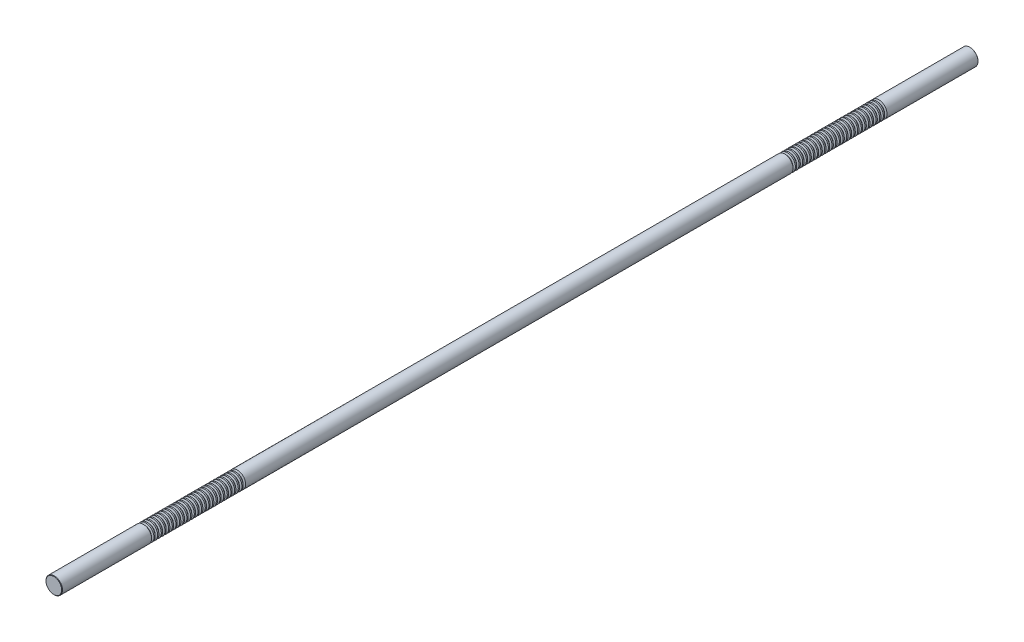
ISO-10303-21;
HEADER;
FILE_DESCRIPTION(('STEP AP214'),'2;1');
FILE_NAME('part.step','',(''),(''),'','','');
FILE_SCHEMA(('AUTOMOTIVE_DESIGN { 1 0 10303 214 1 1 1 1 }'));
ENDSEC;
DATA;
#1=APPLICATION_CONTEXT('core data for automotive mechanical design processes');
#2=APPLICATION_PROTOCOL_DEFINITION('international standard','automotive_design',2000,#1);
#3=PRODUCT_CONTEXT('',#1,'mechanical');
#4=PRODUCT('Part','Part','',(#3));
#5=PRODUCT_RELATED_PRODUCT_CATEGORY('part','',(#4));
#6=PRODUCT_DEFINITION_FORMATION('','',#4);
#7=PRODUCT_DEFINITION_CONTEXT('part definition',#1,'design');
#8=PRODUCT_DEFINITION('design','',#6,#7);
#9=PRODUCT_DEFINITION_SHAPE('','',#8);
#10=(LENGTH_UNIT() NAMED_UNIT(*) SI_UNIT(.MILLI.,.METRE.));
#11=(NAMED_UNIT(*) PLANE_ANGLE_UNIT() SI_UNIT($,.RADIAN.));
#12=(NAMED_UNIT(*) SI_UNIT($,.STERADIAN.) SOLID_ANGLE_UNIT());
#13=UNCERTAINTY_MEASURE_WITH_UNIT(LENGTH_MEASURE(1.E-05),#10,'distance_accuracy_value','');
#14=(GEOMETRIC_REPRESENTATION_CONTEXT(3) GLOBAL_UNCERTAINTY_ASSIGNED_CONTEXT((#13)) GLOBAL_UNIT_ASSIGNED_CONTEXT((#10,
#11,#12)) REPRESENTATION_CONTEXT('',''));
#15=CARTESIAN_POINT('',(0.,0.,0.));
#16=DIRECTION('',(0.,0.,1.));
#17=DIRECTION('',(1.,0.,0.));
#18=AXIS2_PLACEMENT_3D('',#15,#16,#17);
#19=CARTESIAN_POINT('',(0.,0.,500.));
#20=DIRECTION('',(0.,0.,-1.));
#21=DIRECTION('',(-1.,0.,0.));
#22=AXIS2_PLACEMENT_3D('',#19,#20,#21);
#23=CYLINDRICAL_SURFACE('',#22,9.);
#24=CARTESIAN_POINT('',(0.,0.,398.301442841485));
#25=DIRECTION('',(0.,0.,1.));
#26=DIRECTION('',(1.,0.,0.));
#27=AXIS2_PLACEMENT_3D('',#24,#25,#26);
#28=CIRCLE('',#27,9.);
#29=CARTESIAN_POINT('',(9.,0.,398.301442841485));
#30=VERTEX_POINT('',#29);
#31=EDGE_CURVE('E866',#30,#30,#28,.T.);
#32=ORIENTED_EDGE('',*,*,#31,.T.);
#33=EDGE_LOOP('',(#32));
#34=FACE_BOUND('',#33,.T.);
#35=CARTESIAN_POINT('',(0.,0.,399.698557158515));
#36=DIRECTION('',(0.,0.,1.));
#37=DIRECTION('',(1.,0.,0.));
#38=AXIS2_PLACEMENT_3D('',#35,#36,#37);
#39=CIRCLE('',#38,9.);
#40=CARTESIAN_POINT('',(9.,0.,399.698557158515));
#41=VERTEX_POINT('',#40);
#42=EDGE_CURVE('E878',#41,#41,#39,.T.);
#43=ORIENTED_EDGE('',*,*,#42,.F.);
#44=EDGE_LOOP('',(#43));
#45=FACE_BOUND('',#44,.T.);
#46=ADVANCED_FACE('F37',(#34,#45),#23,.T.);
#47=CARTESIAN_POINT('',(0.,0.,394.301442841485));
#48=DIRECTION('',(0.,0.,1.));
#49=DIRECTION('',(1.,0.,0.));
#50=AXIS2_PLACEMENT_3D('',#47,#48,#49);
#51=CIRCLE('',#50,9.);
#52=CARTESIAN_POINT('',(9.,0.,394.301442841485));
#53=VERTEX_POINT('',#52);
#54=EDGE_CURVE('E850',#53,#53,#51,.T.);
#55=ORIENTED_EDGE('',*,*,#54,.T.);
#56=EDGE_LOOP('',(#55));
#57=FACE_BOUND('',#56,.T.);
#58=CARTESIAN_POINT('',(0.,0.,395.698557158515));
#59=DIRECTION('',(0.,0.,1.));
#60=DIRECTION('',(1.,0.,0.));
#61=AXIS2_PLACEMENT_3D('',#58,#59,#60);
#62=CIRCLE('',#61,9.);
#63=CARTESIAN_POINT('',(9.,0.,395.698557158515));
#64=VERTEX_POINT('',#63);
#65=EDGE_CURVE('E862',#64,#64,#62,.T.);
#66=ORIENTED_EDGE('',*,*,#65,.F.);
#67=EDGE_LOOP('',(#66));
#68=FACE_BOUND('',#67,.T.);
#69=ADVANCED_FACE('F913',(#57,#68),#23,.T.);
#70=CARTESIAN_POINT('',(0.,0.,390.301442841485));
#71=DIRECTION('',(0.,0.,1.));
#72=DIRECTION('',(1.,0.,0.));
#73=AXIS2_PLACEMENT_3D('',#70,#71,#72);
#74=CIRCLE('',#73,9.);
#75=CARTESIAN_POINT('',(9.,0.,390.301442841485));
#76=VERTEX_POINT('',#75);
#77=EDGE_CURVE('E834',#76,#76,#74,.T.);
#78=ORIENTED_EDGE('',*,*,#77,.T.);
#79=EDGE_LOOP('',(#78));
#80=FACE_BOUND('',#79,.T.);
#81=CARTESIAN_POINT('',(0.,0.,391.698557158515));
#82=DIRECTION('',(0.,0.,1.));
#83=DIRECTION('',(1.,0.,0.));
#84=AXIS2_PLACEMENT_3D('',#81,#82,#83);
#85=CIRCLE('',#84,9.);
#86=CARTESIAN_POINT('',(9.,0.,391.698557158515));
#87=VERTEX_POINT('',#86);
#88=EDGE_CURVE('E846',#87,#87,#85,.T.);
#89=ORIENTED_EDGE('',*,*,#88,.F.);
#90=EDGE_LOOP('',(#89));
#91=FACE_BOUND('',#90,.T.);
#92=ADVANCED_FACE('F921',(#80,#91),#23,.T.);
#93=CARTESIAN_POINT('',(0.,0.,386.301442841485));
#94=DIRECTION('',(0.,0.,1.));
#95=DIRECTION('',(1.,0.,0.));
#96=AXIS2_PLACEMENT_3D('',#93,#94,#95);
#97=CIRCLE('',#96,9.);
#98=CARTESIAN_POINT('',(9.,0.,386.301442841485));
#99=VERTEX_POINT('',#98);
#100=EDGE_CURVE('E818',#99,#99,#97,.T.);
#101=ORIENTED_EDGE('',*,*,#100,.T.);
#102=EDGE_LOOP('',(#101));
#103=FACE_BOUND('',#102,.T.);
#104=CARTESIAN_POINT('',(0.,0.,387.698557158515));
#105=DIRECTION('',(0.,0.,1.));
#106=DIRECTION('',(1.,0.,0.));
#107=AXIS2_PLACEMENT_3D('',#104,#105,#106);
#108=CIRCLE('',#107,9.);
#109=CARTESIAN_POINT('',(9.,0.,387.698557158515));
#110=VERTEX_POINT('',#109);
#111=EDGE_CURVE('E830',#110,#110,#108,.T.);
#112=ORIENTED_EDGE('',*,*,#111,.F.);
#113=EDGE_LOOP('',(#112));
#114=FACE_BOUND('',#113,.T.);
#115=ADVANCED_FACE('F2018',(#103,#114),#23,.T.);
#116=CARTESIAN_POINT('',(0.,0.,382.301442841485));
#117=DIRECTION('',(0.,0.,1.));
#118=DIRECTION('',(1.,0.,0.));
#119=AXIS2_PLACEMENT_3D('',#116,#117,#118);
#120=CIRCLE('',#119,9.);
#121=CARTESIAN_POINT('',(9.,0.,382.301442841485));
#122=VERTEX_POINT('',#121);
#123=EDGE_CURVE('E803',#122,#122,#120,.T.);
#124=ORIENTED_EDGE('',*,*,#123,.T.);
#125=EDGE_LOOP('',(#124));
#126=FACE_BOUND('',#125,.T.);
#127=CARTESIAN_POINT('',(0.,0.,383.698557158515));
#128=DIRECTION('',(0.,0.,1.));
#129=DIRECTION('',(1.,0.,0.));
#130=AXIS2_PLACEMENT_3D('',#127,#128,#129);
#131=CIRCLE('',#130,9.);
#132=CARTESIAN_POINT('',(9.,0.,383.698557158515));
#133=VERTEX_POINT('',#132);
#134=EDGE_CURVE('E814',#133,#133,#131,.T.);
#135=ORIENTED_EDGE('',*,*,#134,.F.);
#136=EDGE_LOOP('',(#135));
#137=FACE_BOUND('',#136,.T.);
#138=ADVANCED_FACE('F1995',(#126,#137),#23,.T.);
#139=CARTESIAN_POINT('',(0.,0.,378.301442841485));
#140=DIRECTION('',(0.,0.,1.));
#141=DIRECTION('',(1.,0.,0.));
#142=AXIS2_PLACEMENT_3D('',#139,#140,#141);
#143=CIRCLE('',#142,9.);
#144=CARTESIAN_POINT('',(9.,0.,378.301442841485));
#145=VERTEX_POINT('',#144);
#146=EDGE_CURVE('E787',#145,#145,#143,.T.);
#147=ORIENTED_EDGE('',*,*,#146,.T.);
#148=EDGE_LOOP('',(#147));
#149=FACE_BOUND('',#148,.T.);
#150=CARTESIAN_POINT('',(0.,0.,379.698557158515));
#151=DIRECTION('',(0.,0.,1.));
#152=DIRECTION('',(1.,0.,0.));
#153=AXIS2_PLACEMENT_3D('',#150,#151,#152);
#154=CIRCLE('',#153,9.);
#155=CARTESIAN_POINT('',(9.,0.,379.698557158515));
#156=VERTEX_POINT('',#155);
#157=EDGE_CURVE('E799',#156,#156,#154,.T.);
#158=ORIENTED_EDGE('',*,*,#157,.F.);
#159=EDGE_LOOP('',(#158));
#160=FACE_BOUND('',#159,.T.);
#161=ADVANCED_FACE('F1972',(#149,#160),#23,.T.);
#162=CARTESIAN_POINT('',(0.,0.,374.301442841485));
#163=DIRECTION('',(0.,0.,1.));
#164=DIRECTION('',(1.,0.,0.));
#165=AXIS2_PLACEMENT_3D('',#162,#163,#164);
#166=CIRCLE('',#165,9.);
#167=CARTESIAN_POINT('',(9.,0.,374.301442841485));
#168=VERTEX_POINT('',#167);
#169=EDGE_CURVE('E771',#168,#168,#166,.T.);
#170=ORIENTED_EDGE('',*,*,#169,.T.);
#171=EDGE_LOOP('',(#170));
#172=FACE_BOUND('',#171,.T.);
#173=CARTESIAN_POINT('',(0.,0.,375.698557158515));
#174=DIRECTION('',(0.,0.,1.));
#175=DIRECTION('',(1.,0.,0.));
#176=AXIS2_PLACEMENT_3D('',#173,#174,#175);
#177=CIRCLE('',#176,9.);
#178=CARTESIAN_POINT('',(9.,0.,375.698557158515));
#179=VERTEX_POINT('',#178);
#180=EDGE_CURVE('E783',#179,#179,#177,.T.);
#181=ORIENTED_EDGE('',*,*,#180,.F.);
#182=EDGE_LOOP('',(#181));
#183=FACE_BOUND('',#182,.T.);
#184=ADVANCED_FACE('F1949',(#172,#183),#23,.T.);
#185=CARTESIAN_POINT('',(0.,0.,370.301442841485));
#186=DIRECTION('',(0.,0.,1.));
#187=DIRECTION('',(1.,0.,0.));
#188=AXIS2_PLACEMENT_3D('',#185,#186,#187);
#189=CIRCLE('',#188,9.);
#190=CARTESIAN_POINT('',(9.,0.,370.301442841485));
#191=VERTEX_POINT('',#190);
#192=EDGE_CURVE('E755',#191,#191,#189,.T.);
#193=ORIENTED_EDGE('',*,*,#192,.T.);
#194=EDGE_LOOP('',(#193));
#195=FACE_BOUND('',#194,.T.);
#196=CARTESIAN_POINT('',(0.,0.,371.698557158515));
#197=DIRECTION('',(0.,0.,1.));
#198=DIRECTION('',(1.,0.,0.));
#199=AXIS2_PLACEMENT_3D('',#196,#197,#198);
#200=CIRCLE('',#199,9.);
#201=CARTESIAN_POINT('',(9.,0.,371.698557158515));
#202=VERTEX_POINT('',#201);
#203=EDGE_CURVE('E767',#202,#202,#200,.T.);
#204=ORIENTED_EDGE('',*,*,#203,.F.);
#205=EDGE_LOOP('',(#204));
#206=FACE_BOUND('',#205,.T.);
#207=ADVANCED_FACE('F1926',(#195,#206),#23,.T.);
#208=CARTESIAN_POINT('',(0.,0.,366.301442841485));
#209=DIRECTION('',(0.,0.,1.));
#210=DIRECTION('',(1.,0.,0.));
#211=AXIS2_PLACEMENT_3D('',#208,#209,#210);
#212=CIRCLE('',#211,9.);
#213=CARTESIAN_POINT('',(9.,0.,366.301442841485));
#214=VERTEX_POINT('',#213);
#215=EDGE_CURVE('E739',#214,#214,#212,.T.);
#216=ORIENTED_EDGE('',*,*,#215,.T.);
#217=EDGE_LOOP('',(#216));
#218=FACE_BOUND('',#217,.T.);
#219=CARTESIAN_POINT('',(0.,0.,367.698557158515));
#220=DIRECTION('',(0.,0.,1.));
#221=DIRECTION('',(1.,0.,0.));
#222=AXIS2_PLACEMENT_3D('',#219,#220,#221);
#223=CIRCLE('',#222,9.);
#224=CARTESIAN_POINT('',(9.,0.,367.698557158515));
#225=VERTEX_POINT('',#224);
#226=EDGE_CURVE('E751',#225,#225,#223,.T.);
#227=ORIENTED_EDGE('',*,*,#226,.F.);
#228=EDGE_LOOP('',(#227));
#229=FACE_BOUND('',#228,.T.);
#230=ADVANCED_FACE('F1903',(#218,#229),#23,.T.);
#231=CARTESIAN_POINT('',(0.,0.,362.301442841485));
#232=DIRECTION('',(0.,0.,1.));
#233=DIRECTION('',(1.,0.,0.));
#234=AXIS2_PLACEMENT_3D('',#231,#232,#233);
#235=CIRCLE('',#234,9.);
#236=CARTESIAN_POINT('',(9.,0.,362.301442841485));
#237=VERTEX_POINT('',#236);
#238=EDGE_CURVE('E723',#237,#237,#235,.T.);
#239=ORIENTED_EDGE('',*,*,#238,.T.);
#240=EDGE_LOOP('',(#239));
#241=FACE_BOUND('',#240,.T.);
#242=CARTESIAN_POINT('',(0.,0.,363.698557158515));
#243=DIRECTION('',(0.,0.,1.));
#244=DIRECTION('',(1.,0.,0.));
#245=AXIS2_PLACEMENT_3D('',#242,#243,#244);
#246=CIRCLE('',#245,9.);
#247=CARTESIAN_POINT('',(9.,0.,363.698557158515));
#248=VERTEX_POINT('',#247);
#249=EDGE_CURVE('E735',#248,#248,#246,.T.);
#250=ORIENTED_EDGE('',*,*,#249,.F.);
#251=EDGE_LOOP('',(#250));
#252=FACE_BOUND('',#251,.T.);
#253=ADVANCED_FACE('F1880',(#241,#252),#23,.T.);
#254=CARTESIAN_POINT('',(0.,0.,358.301442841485));
#255=DIRECTION('',(0.,0.,1.));
#256=DIRECTION('',(1.,0.,0.));
#257=AXIS2_PLACEMENT_3D('',#254,#255,#256);
#258=CIRCLE('',#257,9.);
#259=CARTESIAN_POINT('',(9.,0.,358.301442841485));
#260=VERTEX_POINT('',#259);
#261=EDGE_CURVE('E707',#260,#260,#258,.T.);
#262=ORIENTED_EDGE('',*,*,#261,.T.);
#263=EDGE_LOOP('',(#262));
#264=FACE_BOUND('',#263,.T.);
#265=CARTESIAN_POINT('',(0.,0.,359.698557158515));
#266=DIRECTION('',(0.,0.,1.));
#267=DIRECTION('',(1.,0.,0.));
#268=AXIS2_PLACEMENT_3D('',#265,#266,#267);
#269=CIRCLE('',#268,9.);
#270=CARTESIAN_POINT('',(9.,0.,359.698557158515));
#271=VERTEX_POINT('',#270);
#272=EDGE_CURVE('E719',#271,#271,#269,.T.);
#273=ORIENTED_EDGE('',*,*,#272,.F.);
#274=EDGE_LOOP('',(#273));
#275=FACE_BOUND('',#274,.T.);
#276=ADVANCED_FACE('F1857',(#264,#275),#23,.T.);
#277=CARTESIAN_POINT('',(0.,0.,354.301442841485));
#278=DIRECTION('',(0.,0.,1.));
#279=DIRECTION('',(1.,0.,0.));
#280=AXIS2_PLACEMENT_3D('',#277,#278,#279);
#281=CIRCLE('',#280,9.);
#282=CARTESIAN_POINT('',(9.,0.,354.301442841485));
#283=VERTEX_POINT('',#282);
#284=EDGE_CURVE('E691',#283,#283,#281,.T.);
#285=ORIENTED_EDGE('',*,*,#284,.T.);
#286=EDGE_LOOP('',(#285));
#287=FACE_BOUND('',#286,.T.);
#288=CARTESIAN_POINT('',(0.,0.,355.698557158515));
#289=DIRECTION('',(0.,0.,1.));
#290=DIRECTION('',(1.,0.,0.));
#291=AXIS2_PLACEMENT_3D('',#288,#289,#290);
#292=CIRCLE('',#291,9.);
#293=CARTESIAN_POINT('',(9.,0.,355.698557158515));
#294=VERTEX_POINT('',#293);
#295=EDGE_CURVE('E703',#294,#294,#292,.T.);
#296=ORIENTED_EDGE('',*,*,#295,.F.);
#297=EDGE_LOOP('',(#296));
#298=FACE_BOUND('',#297,.T.);
#299=ADVANCED_FACE('F1834',(#287,#298),#23,.T.);
#300=CARTESIAN_POINT('',(0.,0.,350.301442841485));
#301=DIRECTION('',(0.,0.,1.));
#302=DIRECTION('',(1.,0.,0.));
#303=AXIS2_PLACEMENT_3D('',#300,#301,#302);
#304=CIRCLE('',#303,9.);
#305=CARTESIAN_POINT('',(9.,0.,350.301442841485));
#306=VERTEX_POINT('',#305);
#307=EDGE_CURVE('E675',#306,#306,#304,.T.);
#308=ORIENTED_EDGE('',*,*,#307,.T.);
#309=EDGE_LOOP('',(#308));
#310=FACE_BOUND('',#309,.T.);
#311=CARTESIAN_POINT('',(0.,0.,351.698557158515));
#312=DIRECTION('',(0.,0.,1.));
#313=DIRECTION('',(1.,0.,0.));
#314=AXIS2_PLACEMENT_3D('',#311,#312,#313);
#315=CIRCLE('',#314,9.);
#316=CARTESIAN_POINT('',(9.,0.,351.698557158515));
#317=VERTEX_POINT('',#316);
#318=EDGE_CURVE('E687',#317,#317,#315,.T.);
#319=ORIENTED_EDGE('',*,*,#318,.F.);
#320=EDGE_LOOP('',(#319));
#321=FACE_BOUND('',#320,.T.);
#322=ADVANCED_FACE('F1811',(#310,#321),#23,.T.);
#323=CARTESIAN_POINT('',(0.,0.,346.301442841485));
#324=DIRECTION('',(0.,0.,1.));
#325=DIRECTION('',(1.,0.,0.));
#326=AXIS2_PLACEMENT_3D('',#323,#324,#325);
#327=CIRCLE('',#326,9.);
#328=CARTESIAN_POINT('',(9.,0.,346.301442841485));
#329=VERTEX_POINT('',#328);
#330=EDGE_CURVE('E659',#329,#329,#327,.T.);
#331=ORIENTED_EDGE('',*,*,#330,.T.);
#332=EDGE_LOOP('',(#331));
#333=FACE_BOUND('',#332,.T.);
#334=CARTESIAN_POINT('',(0.,0.,347.698557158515));
#335=DIRECTION('',(0.,0.,1.));
#336=DIRECTION('',(1.,0.,0.));
#337=AXIS2_PLACEMENT_3D('',#334,#335,#336);
#338=CIRCLE('',#337,9.);
#339=CARTESIAN_POINT('',(9.,0.,347.698557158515));
#340=VERTEX_POINT('',#339);
#341=EDGE_CURVE('E671',#340,#340,#338,.T.);
#342=ORIENTED_EDGE('',*,*,#341,.F.);
#343=EDGE_LOOP('',(#342));
#344=FACE_BOUND('',#343,.T.);
#345=ADVANCED_FACE('F1788',(#333,#344),#23,.T.);
#346=CARTESIAN_POINT('',(0.,0.,342.301442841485));
#347=DIRECTION('',(0.,0.,1.));
#348=DIRECTION('',(1.,0.,0.));
#349=AXIS2_PLACEMENT_3D('',#346,#347,#348);
#350=CIRCLE('',#349,9.);
#351=CARTESIAN_POINT('',(9.,0.,342.301442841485));
#352=VERTEX_POINT('',#351);
#353=EDGE_CURVE('E643',#352,#352,#350,.T.);
#354=ORIENTED_EDGE('',*,*,#353,.T.);
#355=EDGE_LOOP('',(#354));
#356=FACE_BOUND('',#355,.T.);
#357=CARTESIAN_POINT('',(0.,0.,343.698557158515));
#358=DIRECTION('',(0.,0.,1.));
#359=DIRECTION('',(1.,0.,0.));
#360=AXIS2_PLACEMENT_3D('',#357,#358,#359);
#361=CIRCLE('',#360,9.);
#362=CARTESIAN_POINT('',(9.,0.,343.698557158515));
#363=VERTEX_POINT('',#362);
#364=EDGE_CURVE('E655',#363,#363,#361,.T.);
#365=ORIENTED_EDGE('',*,*,#364,.F.);
#366=EDGE_LOOP('',(#365));
#367=FACE_BOUND('',#366,.T.);
#368=ADVANCED_FACE('F1765',(#356,#367),#23,.T.);
#369=CARTESIAN_POINT('',(0.,0.,338.301442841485));
#370=DIRECTION('',(0.,0.,1.));
#371=DIRECTION('',(1.,0.,0.));
#372=AXIS2_PLACEMENT_3D('',#369,#370,#371);
#373=CIRCLE('',#372,9.);
#374=CARTESIAN_POINT('',(9.,0.,338.301442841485));
#375=VERTEX_POINT('',#374);
#376=EDGE_CURVE('E627',#375,#375,#373,.T.);
#377=ORIENTED_EDGE('',*,*,#376,.T.);
#378=EDGE_LOOP('',(#377));
#379=FACE_BOUND('',#378,.T.);
#380=CARTESIAN_POINT('',(0.,0.,339.698557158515));
#381=DIRECTION('',(0.,0.,1.));
#382=DIRECTION('',(1.,0.,0.));
#383=AXIS2_PLACEMENT_3D('',#380,#381,#382);
#384=CIRCLE('',#383,9.);
#385=CARTESIAN_POINT('',(9.,0.,339.698557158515));
#386=VERTEX_POINT('',#385);
#387=EDGE_CURVE('E639',#386,#386,#384,.T.);
#388=ORIENTED_EDGE('',*,*,#387,.F.);
#389=EDGE_LOOP('',(#388));
#390=FACE_BOUND('',#389,.T.);
#391=ADVANCED_FACE('F1742',(#379,#390),#23,.T.);
#392=CARTESIAN_POINT('',(0.,0.,334.301442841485));
#393=DIRECTION('',(0.,0.,1.));
#394=DIRECTION('',(1.,0.,0.));
#395=AXIS2_PLACEMENT_3D('',#392,#393,#394);
#396=CIRCLE('',#395,9.);
#397=CARTESIAN_POINT('',(9.,0.,334.301442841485));
#398=VERTEX_POINT('',#397);
#399=EDGE_CURVE('E611',#398,#398,#396,.T.);
#400=ORIENTED_EDGE('',*,*,#399,.T.);
#401=EDGE_LOOP('',(#400));
#402=FACE_BOUND('',#401,.T.);
#403=CARTESIAN_POINT('',(0.,0.,335.698557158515));
#404=DIRECTION('',(0.,0.,1.));
#405=DIRECTION('',(1.,0.,0.));
#406=AXIS2_PLACEMENT_3D('',#403,#404,#405);
#407=CIRCLE('',#406,9.);
#408=CARTESIAN_POINT('',(9.,0.,335.698557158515));
#409=VERTEX_POINT('',#408);
#410=EDGE_CURVE('E623',#409,#409,#407,.T.);
#411=ORIENTED_EDGE('',*,*,#410,.F.);
#412=EDGE_LOOP('',(#411));
#413=FACE_BOUND('',#412,.T.);
#414=ADVANCED_FACE('F1719',(#402,#413),#23,.T.);
#415=CARTESIAN_POINT('',(0.,0.,330.301442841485));
#416=DIRECTION('',(0.,0.,1.));
#417=DIRECTION('',(1.,0.,0.));
#418=AXIS2_PLACEMENT_3D('',#415,#416,#417);
#419=CIRCLE('',#418,9.);
#420=CARTESIAN_POINT('',(9.,0.,330.301442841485));
#421=VERTEX_POINT('',#420);
#422=EDGE_CURVE('E595',#421,#421,#419,.T.);
#423=ORIENTED_EDGE('',*,*,#422,.T.);
#424=EDGE_LOOP('',(#423));
#425=FACE_BOUND('',#424,.T.);
#426=CARTESIAN_POINT('',(0.,0.,331.698557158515));
#427=DIRECTION('',(0.,0.,1.));
#428=DIRECTION('',(1.,0.,0.));
#429=AXIS2_PLACEMENT_3D('',#426,#427,#428);
#430=CIRCLE('',#429,9.);
#431=CARTESIAN_POINT('',(9.,0.,331.698557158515));
#432=VERTEX_POINT('',#431);
#433=EDGE_CURVE('E607',#432,#432,#430,.T.);
#434=ORIENTED_EDGE('',*,*,#433,.F.);
#435=EDGE_LOOP('',(#434));
#436=FACE_BOUND('',#435,.T.);
#437=ADVANCED_FACE('F1696',(#425,#436),#23,.T.);
#438=CARTESIAN_POINT('',(0.,0.,326.301442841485));
#439=DIRECTION('',(0.,0.,1.));
#440=DIRECTION('',(1.,0.,0.));
#441=AXIS2_PLACEMENT_3D('',#438,#439,#440);
#442=CIRCLE('',#441,9.);
#443=CARTESIAN_POINT('',(9.,0.,326.301442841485));
#444=VERTEX_POINT('',#443);
#445=EDGE_CURVE('E579',#444,#444,#442,.T.);
#446=ORIENTED_EDGE('',*,*,#445,.T.);
#447=EDGE_LOOP('',(#446));
#448=FACE_BOUND('',#447,.T.);
#449=CARTESIAN_POINT('',(0.,0.,327.698557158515));
#450=DIRECTION('',(0.,0.,1.));
#451=DIRECTION('',(1.,0.,0.));
#452=AXIS2_PLACEMENT_3D('',#449,#450,#451);
#453=CIRCLE('',#452,9.);
#454=CARTESIAN_POINT('',(9.,0.,327.698557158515));
#455=VERTEX_POINT('',#454);
#456=EDGE_CURVE('E591',#455,#455,#453,.T.);
#457=ORIENTED_EDGE('',*,*,#456,.F.);
#458=EDGE_LOOP('',(#457));
#459=FACE_BOUND('',#458,.T.);
#460=ADVANCED_FACE('F1673',(#448,#459),#23,.T.);
#461=CARTESIAN_POINT('',(0.,0.,322.301442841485));
#462=DIRECTION('',(0.,0.,1.));
#463=DIRECTION('',(1.,0.,0.));
#464=AXIS2_PLACEMENT_3D('',#461,#462,#463);
#465=CIRCLE('',#464,9.);
#466=CARTESIAN_POINT('',(9.,0.,322.301442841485));
#467=VERTEX_POINT('',#466);
#468=EDGE_CURVE('E563',#467,#467,#465,.T.);
#469=ORIENTED_EDGE('',*,*,#468,.T.);
#470=EDGE_LOOP('',(#469));
#471=FACE_BOUND('',#470,.T.);
#472=CARTESIAN_POINT('',(0.,0.,323.698557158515));
#473=DIRECTION('',(0.,0.,1.));
#474=DIRECTION('',(1.,0.,0.));
#475=AXIS2_PLACEMENT_3D('',#472,#473,#474);
#476=CIRCLE('',#475,9.);
#477=CARTESIAN_POINT('',(9.,0.,323.698557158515));
#478=VERTEX_POINT('',#477);
#479=EDGE_CURVE('E575',#478,#478,#476,.T.);
#480=ORIENTED_EDGE('',*,*,#479,.F.);
#481=EDGE_LOOP('',(#480));
#482=FACE_BOUND('',#481,.T.);
#483=ADVANCED_FACE('F1650',(#471,#482),#23,.T.);
#484=CARTESIAN_POINT('',(0.,0.,318.301442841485));
#485=DIRECTION('',(0.,0.,1.));
#486=DIRECTION('',(1.,0.,0.));
#487=AXIS2_PLACEMENT_3D('',#484,#485,#486);
#488=CIRCLE('',#487,9.);
#489=CARTESIAN_POINT('',(9.,0.,318.301442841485));
#490=VERTEX_POINT('',#489);
#491=EDGE_CURVE('E547',#490,#490,#488,.T.);
#492=ORIENTED_EDGE('',*,*,#491,.T.);
#493=EDGE_LOOP('',(#492));
#494=FACE_BOUND('',#493,.T.);
#495=CARTESIAN_POINT('',(0.,0.,319.698557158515));
#496=DIRECTION('',(0.,0.,1.));
#497=DIRECTION('',(1.,0.,0.));
#498=AXIS2_PLACEMENT_3D('',#495,#496,#497);
#499=CIRCLE('',#498,9.);
#500=CARTESIAN_POINT('',(9.,0.,319.698557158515));
#501=VERTEX_POINT('',#500);
#502=EDGE_CURVE('E559',#501,#501,#499,.T.);
#503=ORIENTED_EDGE('',*,*,#502,.F.);
#504=EDGE_LOOP('',(#503));
#505=FACE_BOUND('',#504,.T.);
#506=ADVANCED_FACE('F1627',(#494,#505),#23,.T.);
#507=CARTESIAN_POINT('',(0.,0.,314.301442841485));
#508=DIRECTION('',(0.,0.,1.));
#509=DIRECTION('',(1.,0.,0.));
#510=AXIS2_PLACEMENT_3D('',#507,#508,#509);
#511=CIRCLE('',#510,9.);
#512=CARTESIAN_POINT('',(9.,0.,314.301442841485));
#513=VERTEX_POINT('',#512);
#514=EDGE_CURVE('E531',#513,#513,#511,.T.);
#515=ORIENTED_EDGE('',*,*,#514,.T.);
#516=EDGE_LOOP('',(#515));
#517=FACE_BOUND('',#516,.T.);
#518=CARTESIAN_POINT('',(0.,0.,315.698557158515));
#519=DIRECTION('',(0.,0.,1.));
#520=DIRECTION('',(1.,0.,0.));
#521=AXIS2_PLACEMENT_3D('',#518,#519,#520);
#522=CIRCLE('',#521,9.);
#523=CARTESIAN_POINT('',(9.,0.,315.698557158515));
#524=VERTEX_POINT('',#523);
#525=EDGE_CURVE('E543',#524,#524,#522,.T.);
#526=ORIENTED_EDGE('',*,*,#525,.F.);
#527=EDGE_LOOP('',(#526));
#528=FACE_BOUND('',#527,.T.);
#529=ADVANCED_FACE('F1604',(#517,#528),#23,.T.);
#530=CARTESIAN_POINT('',(0.,0.,310.301442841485));
#531=DIRECTION('',(0.,0.,1.));
#532=DIRECTION('',(1.,0.,0.));
#533=AXIS2_PLACEMENT_3D('',#530,#531,#532);
#534=CIRCLE('',#533,9.);
#535=CARTESIAN_POINT('',(9.,0.,310.301442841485));
#536=VERTEX_POINT('',#535);
#537=EDGE_CURVE('E515',#536,#536,#534,.T.);
#538=ORIENTED_EDGE('',*,*,#537,.T.);
#539=EDGE_LOOP('',(#538));
#540=FACE_BOUND('',#539,.T.);
#541=CARTESIAN_POINT('',(0.,0.,311.698557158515));
#542=DIRECTION('',(0.,0.,1.));
#543=DIRECTION('',(1.,0.,0.));
#544=AXIS2_PLACEMENT_3D('',#541,#542,#543);
#545=CIRCLE('',#544,9.);
#546=CARTESIAN_POINT('',(9.,0.,311.698557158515));
#547=VERTEX_POINT('',#546);
#548=EDGE_CURVE('E527',#547,#547,#545,.T.);
#549=ORIENTED_EDGE('',*,*,#548,.F.);
#550=EDGE_LOOP('',(#549));
#551=FACE_BOUND('',#550,.T.);
#552=ADVANCED_FACE('F1581',(#540,#551),#23,.T.);
#553=CARTESIAN_POINT('',(0.,0.,306.301442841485));
#554=DIRECTION('',(0.,0.,1.));
#555=DIRECTION('',(1.,0.,0.));
#556=AXIS2_PLACEMENT_3D('',#553,#554,#555);
#557=CIRCLE('',#556,9.);
#558=CARTESIAN_POINT('',(9.,0.,306.301442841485));
#559=VERTEX_POINT('',#558);
#560=EDGE_CURVE('E499',#559,#559,#557,.T.);
#561=ORIENTED_EDGE('',*,*,#560,.T.);
#562=EDGE_LOOP('',(#561));
#563=FACE_BOUND('',#562,.T.);
#564=CARTESIAN_POINT('',(0.,0.,307.698557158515));
#565=DIRECTION('',(0.,0.,1.));
#566=DIRECTION('',(1.,0.,0.));
#567=AXIS2_PLACEMENT_3D('',#564,#565,#566);
#568=CIRCLE('',#567,9.);
#569=CARTESIAN_POINT('',(9.,0.,307.698557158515));
#570=VERTEX_POINT('',#569);
#571=EDGE_CURVE('E511',#570,#570,#568,.T.);
#572=ORIENTED_EDGE('',*,*,#571,.F.);
#573=EDGE_LOOP('',(#572));
#574=FACE_BOUND('',#573,.T.);
#575=ADVANCED_FACE('F1558',(#563,#574),#23,.T.);
#576=CARTESIAN_POINT('',(0.,0.,302.301442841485));
#577=DIRECTION('',(0.,0.,1.));
#578=DIRECTION('',(1.,0.,0.));
#579=AXIS2_PLACEMENT_3D('',#576,#577,#578);
#580=CIRCLE('',#579,9.);
#581=CARTESIAN_POINT('',(9.,0.,302.301442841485));
#582=VERTEX_POINT('',#581);
#583=EDGE_CURVE('E483',#582,#582,#580,.T.);
#584=ORIENTED_EDGE('',*,*,#583,.T.);
#585=EDGE_LOOP('',(#584));
#586=FACE_BOUND('',#585,.T.);
#587=CARTESIAN_POINT('',(0.,0.,303.698557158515));
#588=DIRECTION('',(0.,0.,1.));
#589=DIRECTION('',(1.,0.,0.));
#590=AXIS2_PLACEMENT_3D('',#587,#588,#589);
#591=CIRCLE('',#590,9.);
#592=CARTESIAN_POINT('',(9.,0.,303.698557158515));
#593=VERTEX_POINT('',#592);
#594=EDGE_CURVE('E495',#593,#593,#591,.T.);
#595=ORIENTED_EDGE('',*,*,#594,.F.);
#596=EDGE_LOOP('',(#595));
#597=FACE_BOUND('',#596,.T.);
#598=ADVANCED_FACE('F1535',(#586,#597),#23,.T.);
#599=CARTESIAN_POINT('',(0.,0.,-297.698557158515));
#600=DIRECTION('',(0.,0.,1.));
#601=DIRECTION('',(1.,0.,0.));
#602=AXIS2_PLACEMENT_3D('',#599,#600,#601);
#603=CIRCLE('',#602,9.);
#604=CARTESIAN_POINT('',(9.,0.,-297.698557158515));
#605=VERTEX_POINT('',#604);
#606=EDGE_CURVE('E467',#605,#605,#603,.T.);
#607=ORIENTED_EDGE('',*,*,#606,.T.);
#608=EDGE_LOOP('',(#607));
#609=FACE_BOUND('',#608,.T.);
#610=CARTESIAN_POINT('',(0.,0.,299.698557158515));
#611=DIRECTION('',(0.,0.,1.));
#612=DIRECTION('',(1.,0.,0.));
#613=AXIS2_PLACEMENT_3D('',#610,#611,#612);
#614=CIRCLE('',#613,9.);
#615=CARTESIAN_POINT('',(9.,0.,299.698557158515));
#616=VERTEX_POINT('',#615);
#617=EDGE_CURVE('E479',#616,#616,#614,.T.);
#618=ORIENTED_EDGE('',*,*,#617,.F.);
#619=EDGE_LOOP('',(#618));
#620=FACE_BOUND('',#619,.T.);
#621=ADVANCED_FACE('F1512',(#609,#620),#23,.T.);
#622=CARTESIAN_POINT('',(0.,0.,-301.698557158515));
#623=DIRECTION('',(0.,0.,1.));
#624=DIRECTION('',(1.,0.,0.));
#625=AXIS2_PLACEMENT_3D('',#622,#623,#624);
#626=CIRCLE('',#625,9.);
#627=CARTESIAN_POINT('',(9.,0.,-301.698557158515));
#628=VERTEX_POINT('',#627);
#629=EDGE_CURVE('E451',#628,#628,#626,.T.);
#630=ORIENTED_EDGE('',*,*,#629,.T.);
#631=EDGE_LOOP('',(#630));
#632=FACE_BOUND('',#631,.T.);
#633=CARTESIAN_POINT('',(0.,0.,-300.301442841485));
#634=DIRECTION('',(0.,0.,1.));
#635=DIRECTION('',(1.,0.,0.));
#636=AXIS2_PLACEMENT_3D('',#633,#634,#635);
#637=CIRCLE('',#636,9.);
#638=CARTESIAN_POINT('',(9.,0.,-300.301442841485));
#639=VERTEX_POINT('',#638);
#640=EDGE_CURVE('E463',#639,#639,#637,.T.);
#641=ORIENTED_EDGE('',*,*,#640,.F.);
#642=EDGE_LOOP('',(#641));
#643=FACE_BOUND('',#642,.T.);
#644=ADVANCED_FACE('F1489',(#632,#643),#23,.T.);
#645=CARTESIAN_POINT('',(0.,0.,-305.698557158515));
#646=DIRECTION('',(0.,0.,1.));
#647=DIRECTION('',(1.,0.,0.));
#648=AXIS2_PLACEMENT_3D('',#645,#646,#647);
#649=CIRCLE('',#648,9.);
#650=CARTESIAN_POINT('',(9.,0.,-305.698557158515));
#651=VERTEX_POINT('',#650);
#652=EDGE_CURVE('E435',#651,#651,#649,.T.);
#653=ORIENTED_EDGE('',*,*,#652,.T.);
#654=EDGE_LOOP('',(#653));
#655=FACE_BOUND('',#654,.T.);
#656=CARTESIAN_POINT('',(0.,0.,-304.301442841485));
#657=DIRECTION('',(0.,0.,1.));
#658=DIRECTION('',(1.,0.,0.));
#659=AXIS2_PLACEMENT_3D('',#656,#657,#658);
#660=CIRCLE('',#659,9.);
#661=CARTESIAN_POINT('',(9.,0.,-304.301442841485));
#662=VERTEX_POINT('',#661);
#663=EDGE_CURVE('E447',#662,#662,#660,.T.);
#664=ORIENTED_EDGE('',*,*,#663,.F.);
#665=EDGE_LOOP('',(#664));
#666=FACE_BOUND('',#665,.T.);
#667=ADVANCED_FACE('F1466',(#655,#666),#23,.T.);
#668=CARTESIAN_POINT('',(0.,0.,-309.698557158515));
#669=DIRECTION('',(0.,0.,1.));
#670=DIRECTION('',(1.,0.,0.));
#671=AXIS2_PLACEMENT_3D('',#668,#669,#670);
#672=CIRCLE('',#671,9.);
#673=CARTESIAN_POINT('',(9.,0.,-309.698557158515));
#674=VERTEX_POINT('',#673);
#675=EDGE_CURVE('E419',#674,#674,#672,.T.);
#676=ORIENTED_EDGE('',*,*,#675,.T.);
#677=EDGE_LOOP('',(#676));
#678=FACE_BOUND('',#677,.T.);
#679=CARTESIAN_POINT('',(0.,0.,-308.301442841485));
#680=DIRECTION('',(0.,0.,1.));
#681=DIRECTION('',(1.,0.,0.));
#682=AXIS2_PLACEMENT_3D('',#679,#680,#681);
#683=CIRCLE('',#682,9.);
#684=CARTESIAN_POINT('',(9.,0.,-308.301442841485));
#685=VERTEX_POINT('',#684);
#686=EDGE_CURVE('E431',#685,#685,#683,.T.);
#687=ORIENTED_EDGE('',*,*,#686,.F.);
#688=EDGE_LOOP('',(#687));
#689=FACE_BOUND('',#688,.T.);
#690=ADVANCED_FACE('F1443',(#678,#689),#23,.T.);
#691=CARTESIAN_POINT('',(0.,0.,-313.698557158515));
#692=DIRECTION('',(0.,0.,1.));
#693=DIRECTION('',(1.,0.,0.));
#694=AXIS2_PLACEMENT_3D('',#691,#692,#693);
#695=CIRCLE('',#694,9.);
#696=CARTESIAN_POINT('',(9.,0.,-313.698557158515));
#697=VERTEX_POINT('',#696);
#698=EDGE_CURVE('E403',#697,#697,#695,.T.);
#699=ORIENTED_EDGE('',*,*,#698,.T.);
#700=EDGE_LOOP('',(#699));
#701=FACE_BOUND('',#700,.T.);
#702=CARTESIAN_POINT('',(0.,0.,-312.301442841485));
#703=DIRECTION('',(0.,0.,1.));
#704=DIRECTION('',(1.,0.,0.));
#705=AXIS2_PLACEMENT_3D('',#702,#703,#704);
#706=CIRCLE('',#705,9.);
#707=CARTESIAN_POINT('',(9.,0.,-312.301442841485));
#708=VERTEX_POINT('',#707);
#709=EDGE_CURVE('E415',#708,#708,#706,.T.);
#710=ORIENTED_EDGE('',*,*,#709,.F.);
#711=EDGE_LOOP('',(#710));
#712=FACE_BOUND('',#711,.T.);
#713=ADVANCED_FACE('F1420',(#701,#712),#23,.T.);
#714=CARTESIAN_POINT('',(0.,0.,-317.698557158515));
#715=DIRECTION('',(0.,0.,1.));
#716=DIRECTION('',(1.,0.,0.));
#717=AXIS2_PLACEMENT_3D('',#714,#715,#716);
#718=CIRCLE('',#717,9.);
#719=CARTESIAN_POINT('',(9.,0.,-317.698557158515));
#720=VERTEX_POINT('',#719);
#721=EDGE_CURVE('E387',#720,#720,#718,.T.);
#722=ORIENTED_EDGE('',*,*,#721,.T.);
#723=EDGE_LOOP('',(#722));
#724=FACE_BOUND('',#723,.T.);
#725=CARTESIAN_POINT('',(0.,0.,-316.301442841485));
#726=DIRECTION('',(0.,0.,1.));
#727=DIRECTION('',(1.,0.,0.));
#728=AXIS2_PLACEMENT_3D('',#725,#726,#727);
#729=CIRCLE('',#728,9.);
#730=CARTESIAN_POINT('',(9.,0.,-316.301442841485));
#731=VERTEX_POINT('',#730);
#732=EDGE_CURVE('E399',#731,#731,#729,.T.);
#733=ORIENTED_EDGE('',*,*,#732,.F.);
#734=EDGE_LOOP('',(#733));
#735=FACE_BOUND('',#734,.T.);
#736=ADVANCED_FACE('F1397',(#724,#735),#23,.T.);
#737=CARTESIAN_POINT('',(0.,0.,-321.698557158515));
#738=DIRECTION('',(0.,0.,1.));
#739=DIRECTION('',(1.,0.,0.));
#740=AXIS2_PLACEMENT_3D('',#737,#738,#739);
#741=CIRCLE('',#740,9.);
#742=CARTESIAN_POINT('',(9.,0.,-321.698557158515));
#743=VERTEX_POINT('',#742);
#744=EDGE_CURVE('E371',#743,#743,#741,.T.);
#745=ORIENTED_EDGE('',*,*,#744,.T.);
#746=EDGE_LOOP('',(#745));
#747=FACE_BOUND('',#746,.T.);
#748=CARTESIAN_POINT('',(0.,0.,-320.301442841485));
#749=DIRECTION('',(0.,0.,1.));
#750=DIRECTION('',(1.,0.,0.));
#751=AXIS2_PLACEMENT_3D('',#748,#749,#750);
#752=CIRCLE('',#751,9.);
#753=CARTESIAN_POINT('',(9.,0.,-320.301442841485));
#754=VERTEX_POINT('',#753);
#755=EDGE_CURVE('E383',#754,#754,#752,.T.);
#756=ORIENTED_EDGE('',*,*,#755,.F.);
#757=EDGE_LOOP('',(#756));
#758=FACE_BOUND('',#757,.T.);
#759=ADVANCED_FACE('F1374',(#747,#758),#23,.T.);
#760=CARTESIAN_POINT('',(0.,0.,-325.698557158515));
#761=DIRECTION('',(0.,0.,1.));
#762=DIRECTION('',(1.,0.,0.));
#763=AXIS2_PLACEMENT_3D('',#760,#761,#762);
#764=CIRCLE('',#763,9.);
#765=CARTESIAN_POINT('',(9.,0.,-325.698557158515));
#766=VERTEX_POINT('',#765);
#767=EDGE_CURVE('E355',#766,#766,#764,.T.);
#768=ORIENTED_EDGE('',*,*,#767,.T.);
#769=EDGE_LOOP('',(#768));
#770=FACE_BOUND('',#769,.T.);
#771=CARTESIAN_POINT('',(0.,0.,-324.301442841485));
#772=DIRECTION('',(0.,0.,1.));
#773=DIRECTION('',(1.,0.,0.));
#774=AXIS2_PLACEMENT_3D('',#771,#772,#773);
#775=CIRCLE('',#774,9.);
#776=CARTESIAN_POINT('',(9.,0.,-324.301442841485));
#777=VERTEX_POINT('',#776);
#778=EDGE_CURVE('E367',#777,#777,#775,.T.);
#779=ORIENTED_EDGE('',*,*,#778,.F.);
#780=EDGE_LOOP('',(#779));
#781=FACE_BOUND('',#780,.T.);
#782=ADVANCED_FACE('F1351',(#770,#781),#23,.T.);
#783=CARTESIAN_POINT('',(0.,0.,-329.698557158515));
#784=DIRECTION('',(0.,0.,1.));
#785=DIRECTION('',(1.,0.,0.));
#786=AXIS2_PLACEMENT_3D('',#783,#784,#785);
#787=CIRCLE('',#786,9.);
#788=CARTESIAN_POINT('',(9.,0.,-329.698557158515));
#789=VERTEX_POINT('',#788);
#790=EDGE_CURVE('E339',#789,#789,#787,.T.);
#791=ORIENTED_EDGE('',*,*,#790,.T.);
#792=EDGE_LOOP('',(#791));
#793=FACE_BOUND('',#792,.T.);
#794=CARTESIAN_POINT('',(0.,0.,-328.301442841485));
#795=DIRECTION('',(0.,0.,1.));
#796=DIRECTION('',(1.,0.,0.));
#797=AXIS2_PLACEMENT_3D('',#794,#795,#796);
#798=CIRCLE('',#797,9.);
#799=CARTESIAN_POINT('',(9.,0.,-328.301442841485));
#800=VERTEX_POINT('',#799);
#801=EDGE_CURVE('E351',#800,#800,#798,.T.);
#802=ORIENTED_EDGE('',*,*,#801,.F.);
#803=EDGE_LOOP('',(#802));
#804=FACE_BOUND('',#803,.T.);
#805=ADVANCED_FACE('F1328',(#793,#804),#23,.T.);
#806=CARTESIAN_POINT('',(0.,0.,-333.698557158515));
#807=DIRECTION('',(0.,0.,1.));
#808=DIRECTION('',(1.,0.,0.));
#809=AXIS2_PLACEMENT_3D('',#806,#807,#808);
#810=CIRCLE('',#809,9.);
#811=CARTESIAN_POINT('',(9.,0.,-333.698557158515));
#812=VERTEX_POINT('',#811);
#813=EDGE_CURVE('E323',#812,#812,#810,.T.);
#814=ORIENTED_EDGE('',*,*,#813,.T.);
#815=EDGE_LOOP('',(#814));
#816=FACE_BOUND('',#815,.T.);
#817=CARTESIAN_POINT('',(0.,0.,-332.301442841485));
#818=DIRECTION('',(0.,0.,1.));
#819=DIRECTION('',(1.,0.,0.));
#820=AXIS2_PLACEMENT_3D('',#817,#818,#819);
#821=CIRCLE('',#820,9.);
#822=CARTESIAN_POINT('',(9.,0.,-332.301442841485));
#823=VERTEX_POINT('',#822);
#824=EDGE_CURVE('E335',#823,#823,#821,.T.);
#825=ORIENTED_EDGE('',*,*,#824,.F.);
#826=EDGE_LOOP('',(#825));
#827=FACE_BOUND('',#826,.T.);
#828=ADVANCED_FACE('F1305',(#816,#827),#23,.T.);
#829=CARTESIAN_POINT('',(0.,0.,-337.698557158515));
#830=DIRECTION('',(0.,0.,1.));
#831=DIRECTION('',(1.,0.,0.));
#832=AXIS2_PLACEMENT_3D('',#829,#830,#831);
#833=CIRCLE('',#832,9.);
#834=CARTESIAN_POINT('',(9.,0.,-337.698557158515));
#835=VERTEX_POINT('',#834);
#836=EDGE_CURVE('E307',#835,#835,#833,.T.);
#837=ORIENTED_EDGE('',*,*,#836,.T.);
#838=EDGE_LOOP('',(#837));
#839=FACE_BOUND('',#838,.T.);
#840=CARTESIAN_POINT('',(0.,0.,-336.301442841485));
#841=DIRECTION('',(0.,0.,1.));
#842=DIRECTION('',(1.,0.,0.));
#843=AXIS2_PLACEMENT_3D('',#840,#841,#842);
#844=CIRCLE('',#843,9.);
#845=CARTESIAN_POINT('',(9.,0.,-336.301442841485));
#846=VERTEX_POINT('',#845);
#847=EDGE_CURVE('E319',#846,#846,#844,.T.);
#848=ORIENTED_EDGE('',*,*,#847,.F.);
#849=EDGE_LOOP('',(#848));
#850=FACE_BOUND('',#849,.T.);
#851=ADVANCED_FACE('F1282',(#839,#850),#23,.T.);
#852=CARTESIAN_POINT('',(0.,0.,-341.698557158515));
#853=DIRECTION('',(0.,0.,1.));
#854=DIRECTION('',(1.,0.,0.));
#855=AXIS2_PLACEMENT_3D('',#852,#853,#854);
#856=CIRCLE('',#855,9.);
#857=CARTESIAN_POINT('',(9.,0.,-341.698557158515));
#858=VERTEX_POINT('',#857);
#859=EDGE_CURVE('E291',#858,#858,#856,.T.);
#860=ORIENTED_EDGE('',*,*,#859,.T.);
#861=EDGE_LOOP('',(#860));
#862=FACE_BOUND('',#861,.T.);
#863=CARTESIAN_POINT('',(0.,0.,-340.301442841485));
#864=DIRECTION('',(0.,0.,1.));
#865=DIRECTION('',(1.,0.,0.));
#866=AXIS2_PLACEMENT_3D('',#863,#864,#865);
#867=CIRCLE('',#866,9.);
#868=CARTESIAN_POINT('',(9.,0.,-340.301442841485));
#869=VERTEX_POINT('',#868);
#870=EDGE_CURVE('E303',#869,#869,#867,.T.);
#871=ORIENTED_EDGE('',*,*,#870,.F.);
#872=EDGE_LOOP('',(#871));
#873=FACE_BOUND('',#872,.T.);
#874=ADVANCED_FACE('F1259',(#862,#873),#23,.T.);
#875=CARTESIAN_POINT('',(0.,0.,-345.698557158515));
#876=DIRECTION('',(0.,0.,1.));
#877=DIRECTION('',(1.,0.,0.));
#878=AXIS2_PLACEMENT_3D('',#875,#876,#877);
#879=CIRCLE('',#878,9.);
#880=CARTESIAN_POINT('',(9.,0.,-345.698557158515));
#881=VERTEX_POINT('',#880);
#882=EDGE_CURVE('E275',#881,#881,#879,.T.);
#883=ORIENTED_EDGE('',*,*,#882,.T.);
#884=EDGE_LOOP('',(#883));
#885=FACE_BOUND('',#884,.T.);
#886=CARTESIAN_POINT('',(0.,0.,-344.301442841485));
#887=DIRECTION('',(0.,0.,1.));
#888=DIRECTION('',(1.,0.,0.));
#889=AXIS2_PLACEMENT_3D('',#886,#887,#888);
#890=CIRCLE('',#889,9.);
#891=CARTESIAN_POINT('',(9.,0.,-344.301442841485));
#892=VERTEX_POINT('',#891);
#893=EDGE_CURVE('E287',#892,#892,#890,.T.);
#894=ORIENTED_EDGE('',*,*,#893,.F.);
#895=EDGE_LOOP('',(#894));
#896=FACE_BOUND('',#895,.T.);
#897=ADVANCED_FACE('F1236',(#885,#896),#23,.T.);
#898=CARTESIAN_POINT('',(0.,0.,-349.698557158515));
#899=DIRECTION('',(0.,0.,1.));
#900=DIRECTION('',(1.,0.,0.));
#901=AXIS2_PLACEMENT_3D('',#898,#899,#900);
#902=CIRCLE('',#901,9.);
#903=CARTESIAN_POINT('',(9.,0.,-349.698557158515));
#904=VERTEX_POINT('',#903);
#905=EDGE_CURVE('E259',#904,#904,#902,.T.);
#906=ORIENTED_EDGE('',*,*,#905,.T.);
#907=EDGE_LOOP('',(#906));
#908=FACE_BOUND('',#907,.T.);
#909=CARTESIAN_POINT('',(0.,0.,-348.301442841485));
#910=DIRECTION('',(0.,0.,1.));
#911=DIRECTION('',(1.,0.,0.));
#912=AXIS2_PLACEMENT_3D('',#909,#910,#911);
#913=CIRCLE('',#912,9.);
#914=CARTESIAN_POINT('',(9.,0.,-348.301442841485));
#915=VERTEX_POINT('',#914);
#916=EDGE_CURVE('E271',#915,#915,#913,.T.);
#917=ORIENTED_EDGE('',*,*,#916,.F.);
#918=EDGE_LOOP('',(#917));
#919=FACE_BOUND('',#918,.T.);
#920=ADVANCED_FACE('F1213',(#908,#919),#23,.T.);
#921=CARTESIAN_POINT('',(0.,0.,-353.698557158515));
#922=DIRECTION('',(0.,0.,1.));
#923=DIRECTION('',(1.,0.,0.));
#924=AXIS2_PLACEMENT_3D('',#921,#922,#923);
#925=CIRCLE('',#924,9.);
#926=CARTESIAN_POINT('',(9.,0.,-353.698557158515));
#927=VERTEX_POINT('',#926);
#928=EDGE_CURVE('E243',#927,#927,#925,.T.);
#929=ORIENTED_EDGE('',*,*,#928,.T.);
#930=EDGE_LOOP('',(#929));
#931=FACE_BOUND('',#930,.T.);
#932=CARTESIAN_POINT('',(0.,0.,-352.301442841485));
#933=DIRECTION('',(0.,0.,1.));
#934=DIRECTION('',(1.,0.,0.));
#935=AXIS2_PLACEMENT_3D('',#932,#933,#934);
#936=CIRCLE('',#935,9.);
#937=CARTESIAN_POINT('',(9.,0.,-352.301442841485));
#938=VERTEX_POINT('',#937);
#939=EDGE_CURVE('E255',#938,#938,#936,.T.);
#940=ORIENTED_EDGE('',*,*,#939,.F.);
#941=EDGE_LOOP('',(#940));
#942=FACE_BOUND('',#941,.T.);
#943=ADVANCED_FACE('F1190',(#931,#942),#23,.T.);
#944=CARTESIAN_POINT('',(0.,0.,-357.698557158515));
#945=DIRECTION('',(0.,0.,1.));
#946=DIRECTION('',(1.,0.,0.));
#947=AXIS2_PLACEMENT_3D('',#944,#945,#946);
#948=CIRCLE('',#947,9.);
#949=CARTESIAN_POINT('',(9.,0.,-357.698557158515));
#950=VERTEX_POINT('',#949);
#951=EDGE_CURVE('E227',#950,#950,#948,.T.);
#952=ORIENTED_EDGE('',*,*,#951,.T.);
#953=EDGE_LOOP('',(#952));
#954=FACE_BOUND('',#953,.T.);
#955=CARTESIAN_POINT('',(0.,0.,-356.301442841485));
#956=DIRECTION('',(0.,0.,1.));
#957=DIRECTION('',(1.,0.,0.));
#958=AXIS2_PLACEMENT_3D('',#955,#956,#957);
#959=CIRCLE('',#958,9.);
#960=CARTESIAN_POINT('',(9.,0.,-356.301442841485));
#961=VERTEX_POINT('',#960);
#962=EDGE_CURVE('E239',#961,#961,#959,.T.);
#963=ORIENTED_EDGE('',*,*,#962,.F.);
#964=EDGE_LOOP('',(#963));
#965=FACE_BOUND('',#964,.T.);
#966=ADVANCED_FACE('F1167',(#954,#965),#23,.T.);
#967=CARTESIAN_POINT('',(0.,0.,-361.698557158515));
#968=DIRECTION('',(0.,0.,1.));
#969=DIRECTION('',(1.,0.,0.));
#970=AXIS2_PLACEMENT_3D('',#967,#968,#969);
#971=CIRCLE('',#970,9.);
#972=CARTESIAN_POINT('',(9.,0.,-361.698557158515));
#973=VERTEX_POINT('',#972);
#974=EDGE_CURVE('E211',#973,#973,#971,.T.);
#975=ORIENTED_EDGE('',*,*,#974,.T.);
#976=EDGE_LOOP('',(#975));
#977=FACE_BOUND('',#976,.T.);
#978=CARTESIAN_POINT('',(0.,0.,-360.301442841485));
#979=DIRECTION('',(0.,0.,1.));
#980=DIRECTION('',(1.,0.,0.));
#981=AXIS2_PLACEMENT_3D('',#978,#979,#980);
#982=CIRCLE('',#981,9.);
#983=CARTESIAN_POINT('',(9.,0.,-360.301442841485));
#984=VERTEX_POINT('',#983);
#985=EDGE_CURVE('E223',#984,#984,#982,.T.);
#986=ORIENTED_EDGE('',*,*,#985,.F.);
#987=EDGE_LOOP('',(#986));
#988=FACE_BOUND('',#987,.T.);
#989=ADVANCED_FACE('F1144',(#977,#988),#23,.T.);
#990=CARTESIAN_POINT('',(0.,0.,-365.698557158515));
#991=DIRECTION('',(0.,0.,1.));
#992=DIRECTION('',(1.,0.,0.));
#993=AXIS2_PLACEMENT_3D('',#990,#991,#992);
#994=CIRCLE('',#993,9.);
#995=CARTESIAN_POINT('',(9.,0.,-365.698557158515));
#996=VERTEX_POINT('',#995);
#997=EDGE_CURVE('E195',#996,#996,#994,.T.);
#998=ORIENTED_EDGE('',*,*,#997,.T.);
#999=EDGE_LOOP('',(#998));
#1000=FACE_BOUND('',#999,.T.);
#1001=CARTESIAN_POINT('',(0.,0.,-364.301442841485));
#1002=DIRECTION('',(0.,0.,1.));
#1003=DIRECTION('',(1.,0.,0.));
#1004=AXIS2_PLACEMENT_3D('',#1001,#1002,#1003);
#1005=CIRCLE('',#1004,9.);
#1006=CARTESIAN_POINT('',(9.,0.,-364.301442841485));
#1007=VERTEX_POINT('',#1006);
#1008=EDGE_CURVE('E207',#1007,#1007,#1005,.T.);
#1009=ORIENTED_EDGE('',*,*,#1008,.F.);
#1010=EDGE_LOOP('',(#1009));
#1011=FACE_BOUND('',#1010,.T.);
#1012=ADVANCED_FACE('F1121',(#1000,#1011),#23,.T.);
#1013=CARTESIAN_POINT('',(0.,0.,-369.698557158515));
#1014=DIRECTION('',(0.,0.,1.));
#1015=DIRECTION('',(1.,0.,0.));
#1016=AXIS2_PLACEMENT_3D('',#1013,#1014,#1015);
#1017=CIRCLE('',#1016,9.);
#1018=CARTESIAN_POINT('',(9.,0.,-369.698557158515));
#1019=VERTEX_POINT('',#1018);
#1020=EDGE_CURVE('E179',#1019,#1019,#1017,.T.);
#1021=ORIENTED_EDGE('',*,*,#1020,.T.);
#1022=EDGE_LOOP('',(#1021));
#1023=FACE_BOUND('',#1022,.T.);
#1024=CARTESIAN_POINT('',(0.,0.,-368.301442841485));
#1025=DIRECTION('',(0.,0.,1.));
#1026=DIRECTION('',(1.,0.,0.));
#1027=AXIS2_PLACEMENT_3D('',#1024,#1025,#1026);
#1028=CIRCLE('',#1027,9.);
#1029=CARTESIAN_POINT('',(9.,0.,-368.301442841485));
#1030=VERTEX_POINT('',#1029);
#1031=EDGE_CURVE('E191',#1030,#1030,#1028,.T.);
#1032=ORIENTED_EDGE('',*,*,#1031,.F.);
#1033=EDGE_LOOP('',(#1032));
#1034=FACE_BOUND('',#1033,.T.);
#1035=ADVANCED_FACE('F1098',(#1023,#1034),#23,.T.);
#1036=CARTESIAN_POINT('',(0.,0.,-373.698557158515));
#1037=DIRECTION('',(0.,0.,1.));
#1038=DIRECTION('',(1.,0.,0.));
#1039=AXIS2_PLACEMENT_3D('',#1036,#1037,#1038);
#1040=CIRCLE('',#1039,9.);
#1041=CARTESIAN_POINT('',(9.,0.,-373.698557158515));
#1042=VERTEX_POINT('',#1041);
#1043=EDGE_CURVE('E163',#1042,#1042,#1040,.T.);
#1044=ORIENTED_EDGE('',*,*,#1043,.T.);
#1045=EDGE_LOOP('',(#1044));
#1046=FACE_BOUND('',#1045,.T.);
#1047=CARTESIAN_POINT('',(0.,0.,-372.301442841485));
#1048=DIRECTION('',(0.,0.,1.));
#1049=DIRECTION('',(1.,0.,0.));
#1050=AXIS2_PLACEMENT_3D('',#1047,#1048,#1049);
#1051=CIRCLE('',#1050,9.);
#1052=CARTESIAN_POINT('',(9.,0.,-372.301442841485));
#1053=VERTEX_POINT('',#1052);
#1054=EDGE_CURVE('E175',#1053,#1053,#1051,.T.);
#1055=ORIENTED_EDGE('',*,*,#1054,.F.);
#1056=EDGE_LOOP('',(#1055));
#1057=FACE_BOUND('',#1056,.T.);
#1058=ADVANCED_FACE('F1075',(#1046,#1057),#23,.T.);
#1059=CARTESIAN_POINT('',(0.,0.,-377.698557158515));
#1060=DIRECTION('',(0.,0.,1.));
#1061=DIRECTION('',(1.,0.,0.));
#1062=AXIS2_PLACEMENT_3D('',#1059,#1060,#1061);
#1063=CIRCLE('',#1062,9.);
#1064=CARTESIAN_POINT('',(9.,0.,-377.698557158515));
#1065=VERTEX_POINT('',#1064);
#1066=EDGE_CURVE('E147',#1065,#1065,#1063,.T.);
#1067=ORIENTED_EDGE('',*,*,#1066,.T.);
#1068=EDGE_LOOP('',(#1067));
#1069=FACE_BOUND('',#1068,.T.);
#1070=CARTESIAN_POINT('',(0.,0.,-376.301442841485));
#1071=DIRECTION('',(0.,0.,1.));
#1072=DIRECTION('',(1.,0.,0.));
#1073=AXIS2_PLACEMENT_3D('',#1070,#1071,#1072);
#1074=CIRCLE('',#1073,9.);
#1075=CARTESIAN_POINT('',(9.,0.,-376.301442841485));
#1076=VERTEX_POINT('',#1075);
#1077=EDGE_CURVE('E159',#1076,#1076,#1074,.T.);
#1078=ORIENTED_EDGE('',*,*,#1077,.F.);
#1079=EDGE_LOOP('',(#1078));
#1080=FACE_BOUND('',#1079,.T.);
#1081=ADVANCED_FACE('F1052',(#1069,#1080),#23,.T.);
#1082=CARTESIAN_POINT('',(0.,0.,-381.698557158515));
#1083=DIRECTION('',(0.,0.,1.));
#1084=DIRECTION('',(1.,0.,0.));
#1085=AXIS2_PLACEMENT_3D('',#1082,#1083,#1084);
#1086=CIRCLE('',#1085,9.);
#1087=CARTESIAN_POINT('',(9.,0.,-381.698557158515));
#1088=VERTEX_POINT('',#1087);
#1089=EDGE_CURVE('E131',#1088,#1088,#1086,.T.);
#1090=ORIENTED_EDGE('',*,*,#1089,.T.);
#1091=EDGE_LOOP('',(#1090));
#1092=FACE_BOUND('',#1091,.T.);
#1093=CARTESIAN_POINT('',(0.,0.,-380.301442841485));
#1094=DIRECTION('',(0.,0.,1.));
#1095=DIRECTION('',(1.,0.,0.));
#1096=AXIS2_PLACEMENT_3D('',#1093,#1094,#1095);
#1097=CIRCLE('',#1096,9.);
#1098=CARTESIAN_POINT('',(9.,0.,-380.301442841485));
#1099=VERTEX_POINT('',#1098);
#1100=EDGE_CURVE('E143',#1099,#1099,#1097,.T.);
#1101=ORIENTED_EDGE('',*,*,#1100,.F.);
#1102=EDGE_LOOP('',(#1101));
#1103=FACE_BOUND('',#1102,.T.);
#1104=ADVANCED_FACE('F1029',(#1092,#1103),#23,.T.);
#1105=CARTESIAN_POINT('',(0.,0.,-385.698557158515));
#1106=DIRECTION('',(0.,0.,1.));
#1107=DIRECTION('',(1.,0.,0.));
#1108=AXIS2_PLACEMENT_3D('',#1105,#1106,#1107);
#1109=CIRCLE('',#1108,9.);
#1110=CARTESIAN_POINT('',(9.,0.,-385.698557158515));
#1111=VERTEX_POINT('',#1110);
#1112=EDGE_CURVE('E115',#1111,#1111,#1109,.T.);
#1113=ORIENTED_EDGE('',*,*,#1112,.T.);
#1114=EDGE_LOOP('',(#1113));
#1115=FACE_BOUND('',#1114,.T.);
#1116=CARTESIAN_POINT('',(0.,0.,-384.301442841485));
#1117=DIRECTION('',(0.,0.,1.));
#1118=DIRECTION('',(1.,0.,0.));
#1119=AXIS2_PLACEMENT_3D('',#1116,#1117,#1118);
#1120=CIRCLE('',#1119,9.);
#1121=CARTESIAN_POINT('',(9.,0.,-384.301442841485));
#1122=VERTEX_POINT('',#1121);
#1123=EDGE_CURVE('E127',#1122,#1122,#1120,.T.);
#1124=ORIENTED_EDGE('',*,*,#1123,.F.);
#1125=EDGE_LOOP('',(#1124));
#1126=FACE_BOUND('',#1125,.T.);
#1127=ADVANCED_FACE('F1006',(#1115,#1126),#23,.T.);
#1128=CARTESIAN_POINT('',(0.,0.,-389.698557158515));
#1129=DIRECTION('',(0.,0.,1.));
#1130=DIRECTION('',(1.,0.,0.));
#1131=AXIS2_PLACEMENT_3D('',#1128,#1129,#1130);
#1132=CIRCLE('',#1131,9.);
#1133=CARTESIAN_POINT('',(9.,0.,-389.698557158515));
#1134=VERTEX_POINT('',#1133);
#1135=EDGE_CURVE('E100',#1134,#1134,#1132,.T.);
#1136=ORIENTED_EDGE('',*,*,#1135,.T.);
#1137=EDGE_LOOP('',(#1136));
#1138=FACE_BOUND('',#1137,.T.);
#1139=CARTESIAN_POINT('',(0.,0.,-388.301442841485));
#1140=DIRECTION('',(0.,0.,1.));
#1141=DIRECTION('',(1.,0.,0.));
#1142=AXIS2_PLACEMENT_3D('',#1139,#1140,#1141);
#1143=CIRCLE('',#1142,9.);
#1144=CARTESIAN_POINT('',(9.,0.,-388.301442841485));
#1145=VERTEX_POINT('',#1144);
#1146=EDGE_CURVE('E111',#1145,#1145,#1143,.T.);
#1147=ORIENTED_EDGE('',*,*,#1146,.F.);
#1148=EDGE_LOOP('',(#1147));
#1149=FACE_BOUND('',#1148,.T.);
#1150=ADVANCED_FACE('F983',(#1138,#1149),#23,.T.);
#1151=CARTESIAN_POINT('',(0.,0.,-393.698557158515));
#1152=DIRECTION('',(0.,0.,1.));
#1153=DIRECTION('',(1.,0.,0.));
#1154=AXIS2_PLACEMENT_3D('',#1151,#1152,#1153);
#1155=CIRCLE('',#1154,9.);
#1156=CARTESIAN_POINT('',(9.,0.,-393.698557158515));
#1157=VERTEX_POINT('',#1156);
#1158=EDGE_CURVE('E85',#1157,#1157,#1155,.T.);
#1159=ORIENTED_EDGE('',*,*,#1158,.T.);
#1160=EDGE_LOOP('',(#1159));
#1161=FACE_BOUND('',#1160,.T.);
#1162=CARTESIAN_POINT('',(0.,0.,-392.301442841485));
#1163=DIRECTION('',(0.,0.,1.));
#1164=DIRECTION('',(1.,0.,0.));
#1165=AXIS2_PLACEMENT_3D('',#1162,#1163,#1164);
#1166=CIRCLE('',#1165,9.);
#1167=CARTESIAN_POINT('',(9.,0.,-392.301442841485));
#1168=VERTEX_POINT('',#1167);
#1169=EDGE_CURVE('E97',#1168,#1168,#1166,.T.);
#1170=ORIENTED_EDGE('',*,*,#1169,.F.);
#1171=EDGE_LOOP('',(#1170));
#1172=FACE_BOUND('',#1171,.T.);
#1173=ADVANCED_FACE('F936',(#1161,#1172),#23,.T.);
#1174=CARTESIAN_POINT('',(0.,0.,-397.698557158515));
#1175=DIRECTION('',(0.,0.,1.));
#1176=DIRECTION('',(1.,0.,0.));
#1177=AXIS2_PLACEMENT_3D('',#1174,#1175,#1176);
#1178=CIRCLE('',#1177,9.);
#1179=CARTESIAN_POINT('',(9.,0.,-397.698557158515));
#1180=VERTEX_POINT('',#1179);
#1181=EDGE_CURVE('E69',#1180,#1180,#1178,.T.);
#1182=ORIENTED_EDGE('',*,*,#1181,.T.);
#1183=EDGE_LOOP('',(#1182));
#1184=FACE_BOUND('',#1183,.T.);
#1185=CARTESIAN_POINT('',(0.,0.,-396.301442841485));
#1186=DIRECTION('',(0.,0.,1.));
#1187=DIRECTION('',(1.,0.,0.));
#1188=AXIS2_PLACEMENT_3D('',#1185,#1186,#1187);
#1189=CIRCLE('',#1188,9.);
#1190=CARTESIAN_POINT('',(9.,0.,-396.301442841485));
#1191=VERTEX_POINT('',#1190);
#1192=EDGE_CURVE('E81',#1191,#1191,#1189,.T.);
#1193=ORIENTED_EDGE('',*,*,#1192,.F.);
#1194=EDGE_LOOP('',(#1193));
#1195=FACE_BOUND('',#1194,.T.);
#1196=ADVANCED_FACE('F929',(#1184,#1195),#23,.T.);
#1197=CARTESIAN_POINT('',(0.,0.,-499.55));
#1198=DIRECTION('',(0.,0.,1.));
#1199=DIRECTION('',(1.,0.,0.));
#1200=AXIS2_PLACEMENT_3D('',#1197,#1198,#1199);
#1201=CIRCLE('',#1200,9.);
#1202=CARTESIAN_POINT('',(9.,0.,-499.55));
#1203=VERTEX_POINT('',#1202);
#1204=EDGE_CURVE('E52',#1203,#1203,#1201,.T.);
#1205=ORIENTED_EDGE('',*,*,#1204,.T.);
#1206=EDGE_LOOP('',(#1205));
#1207=FACE_BOUND('',#1206,.T.);
#1208=CARTESIAN_POINT('',(0.,0.,-400.301442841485));
#1209=DIRECTION('',(0.,0.,1.));
#1210=DIRECTION('',(1.,0.,0.));
#1211=AXIS2_PLACEMENT_3D('',#1208,#1209,#1210);
#1212=CIRCLE('',#1211,9.);
#1213=CARTESIAN_POINT('',(9.,0.,-400.301442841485));
#1214=VERTEX_POINT('',#1213);
#1215=EDGE_CURVE('E65',#1214,#1214,#1212,.T.);
#1216=ORIENTED_EDGE('',*,*,#1215,.F.);
#1217=EDGE_LOOP('',(#1216));
#1218=FACE_BOUND('',#1217,.T.);
#1219=ADVANCED_FACE('F917',(#1207,#1218),#23,.T.);
#1220=CARTESIAN_POINT('',(0.,0.,-500.));
#1221=DIRECTION('',(0.,0.,1.));
#1222=DIRECTION('',(1.,0.,0.));
#1223=AXIS2_PLACEMENT_3D('',#1220,#1221,#1222);
#1224=PLANE('',#1223);
#1225=CARTESIAN_POINT('',(0.,0.,-500.));
#1226=DIRECTION('',(0.,0.,1.));
#1227=DIRECTION('',(1.,0.,0.));
#1228=AXIS2_PLACEMENT_3D('',#1225,#1226,#1227);
#1229=CIRCLE('',#1228,8.54999999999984);
#1230=CARTESIAN_POINT('',(8.54999999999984,0.,-500.));
#1231=VERTEX_POINT('',#1230);
#1232=EDGE_CURVE('E45',#1231,#1231,#1229,.F.);
#1233=ORIENTED_EDGE('',*,*,#1232,.T.);
#1234=EDGE_LOOP('',(#1233));
#1235=FACE_BOUND('',#1234,.T.);
#1236=ADVANCED_FACE('F928',(#1235),#1224,.F.);
#1237=CARTESIAN_POINT('',(0.,0.,-499.55));
#1238=DIRECTION('',(0.,0.,1.));
#1239=DIRECTION('',(1.,0.,0.));
#1240=AXIS2_PLACEMENT_3D('',#1237,#1238,#1239);
#1241=CONICAL_SURFACE('',#1240,9.,0.785398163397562);
#1242=ORIENTED_EDGE('',*,*,#1232,.F.);
#1243=EDGE_LOOP('',(#1242));
#1244=FACE_BOUND('',#1243,.T.);
#1245=ORIENTED_EDGE('',*,*,#1204,.F.);
#1246=EDGE_LOOP('',(#1245));
#1247=FACE_BOUND('',#1246,.T.);
#1248=ADVANCED_FACE('F935',(#1244,#1247),#1241,.T.);
#1249=CARTESIAN_POINT('',(0.,0.,-399.698557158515));
#1250=DIRECTION('',(0.,0.,-1.));
#1251=DIRECTION('',(-1.,0.,0.));
#1252=AXIS2_PLACEMENT_3D('',#1249,#1250,#1251);
#1253=CONICAL_SURFACE('',#1252,6.75,1.30899693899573);
#1254=ORIENTED_EDGE('',*,*,#1215,.T.);
#1255=EDGE_LOOP('',(#1254));
#1256=FACE_BOUND('',#1255,.T.);
#1257=CARTESIAN_POINT('',(0.,0.,-399.698557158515));
#1258=DIRECTION('',(0.,0.,1.));
#1259=DIRECTION('',(1.,0.,0.));
#1260=AXIS2_PLACEMENT_3D('',#1257,#1258,#1259);
#1261=CIRCLE('',#1260,6.75);
#1262=CARTESIAN_POINT('',(6.75,0.,-399.698557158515));
#1263=VERTEX_POINT('',#1262);
#1264=EDGE_CURVE('E77',#1263,#1263,#1261,.T.);
#1265=ORIENTED_EDGE('',*,*,#1264,.F.);
#1266=EDGE_LOOP('',(#1265));
#1267=FACE_BOUND('',#1266,.T.);
#1268=ADVANCED_FACE('F942',(#1256,#1267),#1253,.T.);
#1269=CARTESIAN_POINT('',(0.,0.,-397.698557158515));
#1270=DIRECTION('',(0.,0.,1.));
#1271=DIRECTION('',(1.,0.,0.));
#1272=AXIS2_PLACEMENT_3D('',#1269,#1270,#1271);
#1273=CONICAL_SURFACE('',#1272,9.,1.30899693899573);
#1274=CARTESIAN_POINT('',(0.,0.,-398.301442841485));
#1275=DIRECTION('',(0.,0.,1.));
#1276=DIRECTION('',(1.,0.,0.));
#1277=AXIS2_PLACEMENT_3D('',#1274,#1275,#1276);
#1278=CIRCLE('',#1277,6.75);
#1279=CARTESIAN_POINT('',(6.75,0.,-398.301442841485));
#1280=VERTEX_POINT('',#1279);
#1281=EDGE_CURVE('E73',#1280,#1280,#1278,.T.);
#1282=ORIENTED_EDGE('',*,*,#1281,.T.);
#1283=EDGE_LOOP('',(#1282));
#1284=FACE_BOUND('',#1283,.T.);
#1285=ORIENTED_EDGE('',*,*,#1181,.F.);
#1286=EDGE_LOOP('',(#1285));
#1287=FACE_BOUND('',#1286,.T.);
#1288=ADVANCED_FACE('F945',(#1284,#1287),#1273,.T.);
#1289=CARTESIAN_POINT('',(0.,0.,499.55));
#1290=DIRECTION('',(0.,0.,1.));
#1291=DIRECTION('',(1.,0.,0.));
#1292=AXIS2_PLACEMENT_3D('',#1289,#1290,#1291);
#1293=CYLINDRICAL_SURFACE('',#1292,6.75);
#1294=ORIENTED_EDGE('',*,*,#1264,.T.);
#1295=EDGE_LOOP('',(#1294));
#1296=FACE_BOUND('',#1295,.T.);
#1297=ORIENTED_EDGE('',*,*,#1281,.F.);
#1298=EDGE_LOOP('',(#1297));
#1299=FACE_BOUND('',#1298,.T.);
#1300=ADVANCED_FACE('F949',(#1296,#1299),#1293,.T.);
#1301=CARTESIAN_POINT('',(0.,0.,-395.698557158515));
#1302=DIRECTION('',(0.,0.,-1.));
#1303=DIRECTION('',(-1.,0.,0.));
#1304=AXIS2_PLACEMENT_3D('',#1301,#1302,#1303);
#1305=CONICAL_SURFACE('',#1304,6.75,1.30899693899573);
#1306=ORIENTED_EDGE('',*,*,#1192,.T.);
#1307=EDGE_LOOP('',(#1306));
#1308=FACE_BOUND('',#1307,.T.);
#1309=CARTESIAN_POINT('',(0.,0.,-395.698557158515));
#1310=DIRECTION('',(0.,0.,1.));
#1311=DIRECTION('',(1.,0.,0.));
#1312=AXIS2_PLACEMENT_3D('',#1309,#1310,#1311);
#1313=CIRCLE('',#1312,6.75);
#1314=CARTESIAN_POINT('',(6.75,0.,-395.698557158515));
#1315=VERTEX_POINT('',#1314);
#1316=EDGE_CURVE('E93',#1315,#1315,#1313,.T.);
#1317=ORIENTED_EDGE('',*,*,#1316,.F.);
#1318=EDGE_LOOP('',(#1317));
#1319=FACE_BOUND('',#1318,.T.);
#1320=ADVANCED_FACE('F952',(#1308,#1319),#1305,.T.);
#1321=CARTESIAN_POINT('',(0.,0.,-393.698557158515));
#1322=DIRECTION('',(0.,0.,1.));
#1323=DIRECTION('',(1.,0.,0.));
#1324=AXIS2_PLACEMENT_3D('',#1321,#1322,#1323);
#1325=CONICAL_SURFACE('',#1324,9.,1.30899693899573);
#1326=CARTESIAN_POINT('',(0.,0.,-394.301442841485));
#1327=DIRECTION('',(0.,0.,1.));
#1328=DIRECTION('',(1.,0.,0.));
#1329=AXIS2_PLACEMENT_3D('',#1326,#1327,#1328);
#1330=CIRCLE('',#1329,6.75);
#1331=CARTESIAN_POINT('',(6.75,0.,-394.301442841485));
#1332=VERTEX_POINT('',#1331);
#1333=EDGE_CURVE('E89',#1332,#1332,#1330,.T.);
#1334=ORIENTED_EDGE('',*,*,#1333,.T.);
#1335=EDGE_LOOP('',(#1334));
#1336=FACE_BOUND('',#1335,.T.);
#1337=ORIENTED_EDGE('',*,*,#1158,.F.);
#1338=EDGE_LOOP('',(#1337));
#1339=FACE_BOUND('',#1338,.T.);
#1340=ADVANCED_FACE('F965',(#1336,#1339),#1325,.T.);
#1341=CARTESIAN_POINT('',(0.,0.,-396.301442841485));
#1342=DIRECTION('',(0.,0.,1.));
#1343=DIRECTION('',(1.,0.,0.));
#1344=AXIS2_PLACEMENT_3D('',#1341,#1342,#1343);
#1345=CYLINDRICAL_SURFACE('',#1344,6.75);
#1346=ORIENTED_EDGE('',*,*,#1316,.T.);
#1347=EDGE_LOOP('',(#1346));
#1348=FACE_BOUND('',#1347,.T.);
#1349=ORIENTED_EDGE('',*,*,#1333,.F.);
#1350=EDGE_LOOP('',(#1349));
#1351=FACE_BOUND('',#1350,.T.);
#1352=ADVANCED_FACE('F969',(#1348,#1351),#1345,.T.);
#1353=CARTESIAN_POINT('',(0.,0.,-391.698557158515));
#1354=DIRECTION('',(0.,0.,-1.));
#1355=DIRECTION('',(-1.,0.,0.));
#1356=AXIS2_PLACEMENT_3D('',#1353,#1354,#1355);
#1357=CONICAL_SURFACE('',#1356,6.75,1.30899693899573);
#1358=ORIENTED_EDGE('',*,*,#1169,.T.);
#1359=EDGE_LOOP('',(#1358));
#1360=FACE_BOUND('',#1359,.T.);
#1361=CARTESIAN_POINT('',(0.,0.,-391.698557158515));
#1362=DIRECTION('',(0.,0.,1.));
#1363=DIRECTION('',(1.,0.,0.));
#1364=AXIS2_PLACEMENT_3D('',#1361,#1362,#1363);
#1365=CIRCLE('',#1364,6.75);
#1366=CARTESIAN_POINT('',(6.75,0.,-391.698557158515));
#1367=VERTEX_POINT('',#1366);
#1368=EDGE_CURVE('E107',#1367,#1367,#1365,.T.);
#1369=ORIENTED_EDGE('',*,*,#1368,.F.);
#1370=EDGE_LOOP('',(#1369));
#1371=FACE_BOUND('',#1370,.T.);
#1372=ADVANCED_FACE('F972',(#1360,#1371),#1357,.T.);
#1373=CARTESIAN_POINT('',(0.,0.,-389.698557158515));
#1374=DIRECTION('',(0.,0.,1.));
#1375=DIRECTION('',(1.,0.,0.));
#1376=AXIS2_PLACEMENT_3D('',#1373,#1374,#1375);
#1377=CONICAL_SURFACE('',#1376,9.,1.30899693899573);
#1378=CARTESIAN_POINT('',(0.,0.,-390.301442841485));
#1379=DIRECTION('',(0.,0.,1.));
#1380=DIRECTION('',(1.,0.,0.));
#1381=AXIS2_PLACEMENT_3D('',#1378,#1379,#1380);
#1382=CIRCLE('',#1381,6.75);
#1383=CARTESIAN_POINT('',(6.75,0.,-390.301442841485));
#1384=VERTEX_POINT('',#1383);
#1385=EDGE_CURVE('E104',#1384,#1384,#1382,.T.);
#1386=ORIENTED_EDGE('',*,*,#1385,.T.);
#1387=EDGE_LOOP('',(#1386));
#1388=FACE_BOUND('',#1387,.T.);
#1389=ORIENTED_EDGE('',*,*,#1135,.F.);
#1390=EDGE_LOOP('',(#1389));
#1391=FACE_BOUND('',#1390,.T.);
#1392=ADVANCED_FACE('F988',(#1388,#1391),#1377,.T.);
#1393=CARTESIAN_POINT('',(0.,0.,-392.301442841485));
#1394=DIRECTION('',(0.,0.,1.));
#1395=DIRECTION('',(1.,0.,0.));
#1396=AXIS2_PLACEMENT_3D('',#1393,#1394,#1395);
#1397=CYLINDRICAL_SURFACE('',#1396,6.75);
#1398=ORIENTED_EDGE('',*,*,#1368,.T.);
#1399=EDGE_LOOP('',(#1398));
#1400=FACE_BOUND('',#1399,.T.);
#1401=ORIENTED_EDGE('',*,*,#1385,.F.);
#1402=EDGE_LOOP('',(#1401));
#1403=FACE_BOUND('',#1402,.T.);
#1404=ADVANCED_FACE('F992',(#1400,#1403),#1397,.T.);
#1405=CARTESIAN_POINT('',(0.,0.,-387.698557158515));
#1406=DIRECTION('',(0.,0.,-1.));
#1407=DIRECTION('',(-1.,0.,0.));
#1408=AXIS2_PLACEMENT_3D('',#1405,#1406,#1407);
#1409=CONICAL_SURFACE('',#1408,6.75,1.30899693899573);
#1410=ORIENTED_EDGE('',*,*,#1146,.T.);
#1411=EDGE_LOOP('',(#1410));
#1412=FACE_BOUND('',#1411,.T.);
#1413=CARTESIAN_POINT('',(0.,0.,-387.698557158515));
#1414=DIRECTION('',(0.,0.,1.));
#1415=DIRECTION('',(1.,0.,0.));
#1416=AXIS2_PLACEMENT_3D('',#1413,#1414,#1415);
#1417=CIRCLE('',#1416,6.75);
#1418=CARTESIAN_POINT('',(6.75,0.,-387.698557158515));
#1419=VERTEX_POINT('',#1418);
#1420=EDGE_CURVE('E123',#1419,#1419,#1417,.T.);
#1421=ORIENTED_EDGE('',*,*,#1420,.F.);
#1422=EDGE_LOOP('',(#1421));
#1423=FACE_BOUND('',#1422,.T.);
#1424=ADVANCED_FACE('F995',(#1412,#1423),#1409,.T.);
#1425=CARTESIAN_POINT('',(0.,0.,-385.698557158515));
#1426=DIRECTION('',(0.,0.,1.));
#1427=DIRECTION('',(1.,0.,0.));
#1428=AXIS2_PLACEMENT_3D('',#1425,#1426,#1427);
#1429=CONICAL_SURFACE('',#1428,9.,1.30899693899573);
#1430=CARTESIAN_POINT('',(0.,0.,-386.301442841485));
#1431=DIRECTION('',(0.,0.,1.));
#1432=DIRECTION('',(1.,0.,0.));
#1433=AXIS2_PLACEMENT_3D('',#1430,#1431,#1432);
#1434=CIRCLE('',#1433,6.75);
#1435=CARTESIAN_POINT('',(6.75,0.,-386.301442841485));
#1436=VERTEX_POINT('',#1435);
#1437=EDGE_CURVE('E119',#1436,#1436,#1434,.T.);
#1438=ORIENTED_EDGE('',*,*,#1437,.T.);
#1439=EDGE_LOOP('',(#1438));
#1440=FACE_BOUND('',#1439,.T.);
#1441=ORIENTED_EDGE('',*,*,#1112,.F.);
#1442=EDGE_LOOP('',(#1441));
#1443=FACE_BOUND('',#1442,.T.);
#1444=ADVANCED_FACE('F1011',(#1440,#1443),#1429,.T.);
#1445=CARTESIAN_POINT('',(0.,0.,-388.301442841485));
#1446=DIRECTION('',(0.,0.,1.));
#1447=DIRECTION('',(1.,0.,0.));
#1448=AXIS2_PLACEMENT_3D('',#1445,#1446,#1447);
#1449=CYLINDRICAL_SURFACE('',#1448,6.75);
#1450=ORIENTED_EDGE('',*,*,#1420,.T.);
#1451=EDGE_LOOP('',(#1450));
#1452=FACE_BOUND('',#1451,.T.);
#1453=ORIENTED_EDGE('',*,*,#1437,.F.);
#1454=EDGE_LOOP('',(#1453));
#1455=FACE_BOUND('',#1454,.T.);
#1456=ADVANCED_FACE('F1015',(#1452,#1455),#1449,.T.);
#1457=CARTESIAN_POINT('',(0.,0.,-383.698557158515));
#1458=DIRECTION('',(0.,0.,-1.));
#1459=DIRECTION('',(-1.,0.,0.));
#1460=AXIS2_PLACEMENT_3D('',#1457,#1458,#1459);
#1461=CONICAL_SURFACE('',#1460,6.75,1.30899693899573);
#1462=ORIENTED_EDGE('',*,*,#1123,.T.);
#1463=EDGE_LOOP('',(#1462));
#1464=FACE_BOUND('',#1463,.T.);
#1465=CARTESIAN_POINT('',(0.,0.,-383.698557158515));
#1466=DIRECTION('',(0.,0.,1.));
#1467=DIRECTION('',(1.,0.,0.));
#1468=AXIS2_PLACEMENT_3D('',#1465,#1466,#1467);
#1469=CIRCLE('',#1468,6.75);
#1470=CARTESIAN_POINT('',(6.75,0.,-383.698557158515));
#1471=VERTEX_POINT('',#1470);
#1472=EDGE_CURVE('E139',#1471,#1471,#1469,.T.);
#1473=ORIENTED_EDGE('',*,*,#1472,.F.);
#1474=EDGE_LOOP('',(#1473));
#1475=FACE_BOUND('',#1474,.T.);
#1476=ADVANCED_FACE('F1018',(#1464,#1475),#1461,.T.);
#1477=CARTESIAN_POINT('',(0.,0.,-381.698557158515));
#1478=DIRECTION('',(0.,0.,1.));
#1479=DIRECTION('',(1.,0.,0.));
#1480=AXIS2_PLACEMENT_3D('',#1477,#1478,#1479);
#1481=CONICAL_SURFACE('',#1480,9.,1.30899693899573);
#1482=CARTESIAN_POINT('',(0.,0.,-382.301442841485));
#1483=DIRECTION('',(0.,0.,1.));
#1484=DIRECTION('',(1.,0.,0.));
#1485=AXIS2_PLACEMENT_3D('',#1482,#1483,#1484);
#1486=CIRCLE('',#1485,6.75);
#1487=CARTESIAN_POINT('',(6.75,0.,-382.301442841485));
#1488=VERTEX_POINT('',#1487);
#1489=EDGE_CURVE('E135',#1488,#1488,#1486,.T.);
#1490=ORIENTED_EDGE('',*,*,#1489,.T.);
#1491=EDGE_LOOP('',(#1490));
#1492=FACE_BOUND('',#1491,.T.);
#1493=ORIENTED_EDGE('',*,*,#1089,.F.);
#1494=EDGE_LOOP('',(#1493));
#1495=FACE_BOUND('',#1494,.T.);
#1496=ADVANCED_FACE('F1034',(#1492,#1495),#1481,.T.);
#1497=CARTESIAN_POINT('',(0.,0.,-384.301442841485));
#1498=DIRECTION('',(0.,0.,1.));
#1499=DIRECTION('',(1.,0.,0.));
#1500=AXIS2_PLACEMENT_3D('',#1497,#1498,#1499);
#1501=CYLINDRICAL_SURFACE('',#1500,6.75);
#1502=ORIENTED_EDGE('',*,*,#1472,.T.);
#1503=EDGE_LOOP('',(#1502));
#1504=FACE_BOUND('',#1503,.T.);
#1505=ORIENTED_EDGE('',*,*,#1489,.F.);
#1506=EDGE_LOOP('',(#1505));
#1507=FACE_BOUND('',#1506,.T.);
#1508=ADVANCED_FACE('F1038',(#1504,#1507),#1501,.T.);
#1509=CARTESIAN_POINT('',(0.,0.,-379.698557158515));
#1510=DIRECTION('',(0.,0.,-1.));
#1511=DIRECTION('',(-1.,0.,0.));
#1512=AXIS2_PLACEMENT_3D('',#1509,#1510,#1511);
#1513=CONICAL_SURFACE('',#1512,6.75,1.30899693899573);
#1514=ORIENTED_EDGE('',*,*,#1100,.T.);
#1515=EDGE_LOOP('',(#1514));
#1516=FACE_BOUND('',#1515,.T.);
#1517=CARTESIAN_POINT('',(0.,0.,-379.698557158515));
#1518=DIRECTION('',(0.,0.,1.));
#1519=DIRECTION('',(1.,0.,0.));
#1520=AXIS2_PLACEMENT_3D('',#1517,#1518,#1519);
#1521=CIRCLE('',#1520,6.75);
#1522=CARTESIAN_POINT('',(6.75,0.,-379.698557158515));
#1523=VERTEX_POINT('',#1522);
#1524=EDGE_CURVE('E155',#1523,#1523,#1521,.T.);
#1525=ORIENTED_EDGE('',*,*,#1524,.F.);
#1526=EDGE_LOOP('',(#1525));
#1527=FACE_BOUND('',#1526,.T.);
#1528=ADVANCED_FACE('F1041',(#1516,#1527),#1513,.T.);
#1529=CARTESIAN_POINT('',(0.,0.,-377.698557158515));
#1530=DIRECTION('',(0.,0.,1.));
#1531=DIRECTION('',(1.,0.,0.));
#1532=AXIS2_PLACEMENT_3D('',#1529,#1530,#1531);
#1533=CONICAL_SURFACE('',#1532,9.,1.30899693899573);
#1534=CARTESIAN_POINT('',(0.,0.,-378.301442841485));
#1535=DIRECTION('',(0.,0.,1.));
#1536=DIRECTION('',(1.,0.,0.));
#1537=AXIS2_PLACEMENT_3D('',#1534,#1535,#1536);
#1538=CIRCLE('',#1537,6.75);
#1539=CARTESIAN_POINT('',(6.75,0.,-378.301442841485));
#1540=VERTEX_POINT('',#1539);
#1541=EDGE_CURVE('E151',#1540,#1540,#1538,.T.);
#1542=ORIENTED_EDGE('',*,*,#1541,.T.);
#1543=EDGE_LOOP('',(#1542));
#1544=FACE_BOUND('',#1543,.T.);
#1545=ORIENTED_EDGE('',*,*,#1066,.F.);
#1546=EDGE_LOOP('',(#1545));
#1547=FACE_BOUND('',#1546,.T.);
#1548=ADVANCED_FACE('F1057',(#1544,#1547),#1533,.T.);
#1549=CARTESIAN_POINT('',(0.,0.,-380.301442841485));
#1550=DIRECTION('',(0.,0.,1.));
#1551=DIRECTION('',(1.,0.,0.));
#1552=AXIS2_PLACEMENT_3D('',#1549,#1550,#1551);
#1553=CYLINDRICAL_SURFACE('',#1552,6.75);
#1554=ORIENTED_EDGE('',*,*,#1524,.T.);
#1555=EDGE_LOOP('',(#1554));
#1556=FACE_BOUND('',#1555,.T.);
#1557=ORIENTED_EDGE('',*,*,#1541,.F.);
#1558=EDGE_LOOP('',(#1557));
#1559=FACE_BOUND('',#1558,.T.);
#1560=ADVANCED_FACE('F1061',(#1556,#1559),#1553,.T.);
#1561=CARTESIAN_POINT('',(0.,0.,-375.698557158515));
#1562=DIRECTION('',(0.,0.,-1.));
#1563=DIRECTION('',(-1.,0.,0.));
#1564=AXIS2_PLACEMENT_3D('',#1561,#1562,#1563);
#1565=CONICAL_SURFACE('',#1564,6.75,1.30899693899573);
#1566=ORIENTED_EDGE('',*,*,#1077,.T.);
#1567=EDGE_LOOP('',(#1566));
#1568=FACE_BOUND('',#1567,.T.);
#1569=CARTESIAN_POINT('',(0.,0.,-375.698557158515));
#1570=DIRECTION('',(0.,0.,1.));
#1571=DIRECTION('',(1.,0.,0.));
#1572=AXIS2_PLACEMENT_3D('',#1569,#1570,#1571);
#1573=CIRCLE('',#1572,6.75);
#1574=CARTESIAN_POINT('',(6.75,0.,-375.698557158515));
#1575=VERTEX_POINT('',#1574);
#1576=EDGE_CURVE('E171',#1575,#1575,#1573,.T.);
#1577=ORIENTED_EDGE('',*,*,#1576,.F.);
#1578=EDGE_LOOP('',(#1577));
#1579=FACE_BOUND('',#1578,.T.);
#1580=ADVANCED_FACE('F1064',(#1568,#1579),#1565,.T.);
#1581=CARTESIAN_POINT('',(0.,0.,-373.698557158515));
#1582=DIRECTION('',(0.,0.,1.));
#1583=DIRECTION('',(1.,0.,0.));
#1584=AXIS2_PLACEMENT_3D('',#1581,#1582,#1583);
#1585=CONICAL_SURFACE('',#1584,9.,1.30899693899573);
#1586=CARTESIAN_POINT('',(0.,0.,-374.301442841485));
#1587=DIRECTION('',(0.,0.,1.));
#1588=DIRECTION('',(1.,0.,0.));
#1589=AXIS2_PLACEMENT_3D('',#1586,#1587,#1588);
#1590=CIRCLE('',#1589,6.75);
#1591=CARTESIAN_POINT('',(6.75,0.,-374.301442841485));
#1592=VERTEX_POINT('',#1591);
#1593=EDGE_CURVE('E167',#1592,#1592,#1590,.T.);
#1594=ORIENTED_EDGE('',*,*,#1593,.T.);
#1595=EDGE_LOOP('',(#1594));
#1596=FACE_BOUND('',#1595,.T.);
#1597=ORIENTED_EDGE('',*,*,#1043,.F.);
#1598=EDGE_LOOP('',(#1597));
#1599=FACE_BOUND('',#1598,.T.);
#1600=ADVANCED_FACE('F1080',(#1596,#1599),#1585,.T.);
#1601=CARTESIAN_POINT('',(0.,0.,-376.301442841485));
#1602=DIRECTION('',(0.,0.,1.));
#1603=DIRECTION('',(1.,0.,0.));
#1604=AXIS2_PLACEMENT_3D('',#1601,#1602,#1603);
#1605=CYLINDRICAL_SURFACE('',#1604,6.75);
#1606=ORIENTED_EDGE('',*,*,#1576,.T.);
#1607=EDGE_LOOP('',(#1606));
#1608=FACE_BOUND('',#1607,.T.);
#1609=ORIENTED_EDGE('',*,*,#1593,.F.);
#1610=EDGE_LOOP('',(#1609));
#1611=FACE_BOUND('',#1610,.T.);
#1612=ADVANCED_FACE('F1084',(#1608,#1611),#1605,.T.);
#1613=CARTESIAN_POINT('',(0.,0.,-371.698557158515));
#1614=DIRECTION('',(0.,0.,-1.));
#1615=DIRECTION('',(-1.,0.,0.));
#1616=AXIS2_PLACEMENT_3D('',#1613,#1614,#1615);
#1617=CONICAL_SURFACE('',#1616,6.75,1.30899693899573);
#1618=ORIENTED_EDGE('',*,*,#1054,.T.);
#1619=EDGE_LOOP('',(#1618));
#1620=FACE_BOUND('',#1619,.T.);
#1621=CARTESIAN_POINT('',(0.,0.,-371.698557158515));
#1622=DIRECTION('',(0.,0.,1.));
#1623=DIRECTION('',(1.,0.,0.));
#1624=AXIS2_PLACEMENT_3D('',#1621,#1622,#1623);
#1625=CIRCLE('',#1624,6.75);
#1626=CARTESIAN_POINT('',(6.75,0.,-371.698557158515));
#1627=VERTEX_POINT('',#1626);
#1628=EDGE_CURVE('E187',#1627,#1627,#1625,.T.);
#1629=ORIENTED_EDGE('',*,*,#1628,.F.);
#1630=EDGE_LOOP('',(#1629));
#1631=FACE_BOUND('',#1630,.T.);
#1632=ADVANCED_FACE('F1087',(#1620,#1631),#1617,.T.);
#1633=CARTESIAN_POINT('',(0.,0.,-369.698557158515));
#1634=DIRECTION('',(0.,0.,1.));
#1635=DIRECTION('',(1.,0.,0.));
#1636=AXIS2_PLACEMENT_3D('',#1633,#1634,#1635);
#1637=CONICAL_SURFACE('',#1636,9.,1.30899693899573);
#1638=CARTESIAN_POINT('',(0.,0.,-370.301442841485));
#1639=DIRECTION('',(0.,0.,1.));
#1640=DIRECTION('',(1.,0.,0.));
#1641=AXIS2_PLACEMENT_3D('',#1638,#1639,#1640);
#1642=CIRCLE('',#1641,6.75);
#1643=CARTESIAN_POINT('',(6.75,0.,-370.301442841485));
#1644=VERTEX_POINT('',#1643);
#1645=EDGE_CURVE('E183',#1644,#1644,#1642,.T.);
#1646=ORIENTED_EDGE('',*,*,#1645,.T.);
#1647=EDGE_LOOP('',(#1646));
#1648=FACE_BOUND('',#1647,.T.);
#1649=ORIENTED_EDGE('',*,*,#1020,.F.);
#1650=EDGE_LOOP('',(#1649));
#1651=FACE_BOUND('',#1650,.T.);
#1652=ADVANCED_FACE('F1103',(#1648,#1651),#1637,.T.);
#1653=CARTESIAN_POINT('',(0.,0.,-372.301442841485));
#1654=DIRECTION('',(0.,0.,1.));
#1655=DIRECTION('',(1.,0.,0.));
#1656=AXIS2_PLACEMENT_3D('',#1653,#1654,#1655);
#1657=CYLINDRICAL_SURFACE('',#1656,6.75);
#1658=ORIENTED_EDGE('',*,*,#1628,.T.);
#1659=EDGE_LOOP('',(#1658));
#1660=FACE_BOUND('',#1659,.T.);
#1661=ORIENTED_EDGE('',*,*,#1645,.F.);
#1662=EDGE_LOOP('',(#1661));
#1663=FACE_BOUND('',#1662,.T.);
#1664=ADVANCED_FACE('F1107',(#1660,#1663),#1657,.T.);
#1665=CARTESIAN_POINT('',(0.,0.,-367.698557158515));
#1666=DIRECTION('',(0.,0.,-1.));
#1667=DIRECTION('',(-1.,0.,0.));
#1668=AXIS2_PLACEMENT_3D('',#1665,#1666,#1667);
#1669=CONICAL_SURFACE('',#1668,6.75,1.30899693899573);
#1670=ORIENTED_EDGE('',*,*,#1031,.T.);
#1671=EDGE_LOOP('',(#1670));
#1672=FACE_BOUND('',#1671,.T.);
#1673=CARTESIAN_POINT('',(0.,0.,-367.698557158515));
#1674=DIRECTION('',(0.,0.,1.));
#1675=DIRECTION('',(1.,0.,0.));
#1676=AXIS2_PLACEMENT_3D('',#1673,#1674,#1675);
#1677=CIRCLE('',#1676,6.75);
#1678=CARTESIAN_POINT('',(6.75,0.,-367.698557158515));
#1679=VERTEX_POINT('',#1678);
#1680=EDGE_CURVE('E203',#1679,#1679,#1677,.T.);
#1681=ORIENTED_EDGE('',*,*,#1680,.F.);
#1682=EDGE_LOOP('',(#1681));
#1683=FACE_BOUND('',#1682,.T.);
#1684=ADVANCED_FACE('F1110',(#1672,#1683),#1669,.T.);
#1685=CARTESIAN_POINT('',(0.,0.,-365.698557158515));
#1686=DIRECTION('',(0.,0.,1.));
#1687=DIRECTION('',(1.,0.,0.));
#1688=AXIS2_PLACEMENT_3D('',#1685,#1686,#1687);
#1689=CONICAL_SURFACE('',#1688,9.,1.30899693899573);
#1690=CARTESIAN_POINT('',(0.,0.,-366.301442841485));
#1691=DIRECTION('',(0.,0.,1.));
#1692=DIRECTION('',(1.,0.,0.));
#1693=AXIS2_PLACEMENT_3D('',#1690,#1691,#1692);
#1694=CIRCLE('',#1693,6.75);
#1695=CARTESIAN_POINT('',(6.75,0.,-366.301442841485));
#1696=VERTEX_POINT('',#1695);
#1697=EDGE_CURVE('E199',#1696,#1696,#1694,.T.);
#1698=ORIENTED_EDGE('',*,*,#1697,.T.);
#1699=EDGE_LOOP('',(#1698));
#1700=FACE_BOUND('',#1699,.T.);
#1701=ORIENTED_EDGE('',*,*,#997,.F.);
#1702=EDGE_LOOP('',(#1701));
#1703=FACE_BOUND('',#1702,.T.);
#1704=ADVANCED_FACE('F1126',(#1700,#1703),#1689,.T.);
#1705=CARTESIAN_POINT('',(0.,0.,-368.301442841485));
#1706=DIRECTION('',(0.,0.,1.));
#1707=DIRECTION('',(1.,0.,0.));
#1708=AXIS2_PLACEMENT_3D('',#1705,#1706,#1707);
#1709=CYLINDRICAL_SURFACE('',#1708,6.75);
#1710=ORIENTED_EDGE('',*,*,#1680,.T.);
#1711=EDGE_LOOP('',(#1710));
#1712=FACE_BOUND('',#1711,.T.);
#1713=ORIENTED_EDGE('',*,*,#1697,.F.);
#1714=EDGE_LOOP('',(#1713));
#1715=FACE_BOUND('',#1714,.T.);
#1716=ADVANCED_FACE('F1130',(#1712,#1715),#1709,.T.);
#1717=CARTESIAN_POINT('',(0.,0.,-363.698557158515));
#1718=DIRECTION('',(0.,0.,-1.));
#1719=DIRECTION('',(-1.,0.,0.));
#1720=AXIS2_PLACEMENT_3D('',#1717,#1718,#1719);
#1721=CONICAL_SURFACE('',#1720,6.75,1.30899693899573);
#1722=ORIENTED_EDGE('',*,*,#1008,.T.);
#1723=EDGE_LOOP('',(#1722));
#1724=FACE_BOUND('',#1723,.T.);
#1725=CARTESIAN_POINT('',(0.,0.,-363.698557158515));
#1726=DIRECTION('',(0.,0.,1.));
#1727=DIRECTION('',(1.,0.,0.));
#1728=AXIS2_PLACEMENT_3D('',#1725,#1726,#1727);
#1729=CIRCLE('',#1728,6.75);
#1730=CARTESIAN_POINT('',(6.75,0.,-363.698557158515));
#1731=VERTEX_POINT('',#1730);
#1732=EDGE_CURVE('E219',#1731,#1731,#1729,.T.);
#1733=ORIENTED_EDGE('',*,*,#1732,.F.);
#1734=EDGE_LOOP('',(#1733));
#1735=FACE_BOUND('',#1734,.T.);
#1736=ADVANCED_FACE('F1133',(#1724,#1735),#1721,.T.);
#1737=CARTESIAN_POINT('',(0.,0.,-361.698557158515));
#1738=DIRECTION('',(0.,0.,1.));
#1739=DIRECTION('',(1.,0.,0.));
#1740=AXIS2_PLACEMENT_3D('',#1737,#1738,#1739);
#1741=CONICAL_SURFACE('',#1740,9.,1.30899693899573);
#1742=CARTESIAN_POINT('',(0.,0.,-362.301442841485));
#1743=DIRECTION('',(0.,0.,1.));
#1744=DIRECTION('',(1.,0.,0.));
#1745=AXIS2_PLACEMENT_3D('',#1742,#1743,#1744);
#1746=CIRCLE('',#1745,6.75);
#1747=CARTESIAN_POINT('',(6.75,0.,-362.301442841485));
#1748=VERTEX_POINT('',#1747);
#1749=EDGE_CURVE('E215',#1748,#1748,#1746,.T.);
#1750=ORIENTED_EDGE('',*,*,#1749,.T.);
#1751=EDGE_LOOP('',(#1750));
#1752=FACE_BOUND('',#1751,.T.);
#1753=ORIENTED_EDGE('',*,*,#974,.F.);
#1754=EDGE_LOOP('',(#1753));
#1755=FACE_BOUND('',#1754,.T.);
#1756=ADVANCED_FACE('F1149',(#1752,#1755),#1741,.T.);
#1757=CARTESIAN_POINT('',(0.,0.,-364.301442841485));
#1758=DIRECTION('',(0.,0.,1.));
#1759=DIRECTION('',(1.,0.,0.));
#1760=AXIS2_PLACEMENT_3D('',#1757,#1758,#1759);
#1761=CYLINDRICAL_SURFACE('',#1760,6.75);
#1762=ORIENTED_EDGE('',*,*,#1732,.T.);
#1763=EDGE_LOOP('',(#1762));
#1764=FACE_BOUND('',#1763,.T.);
#1765=ORIENTED_EDGE('',*,*,#1749,.F.);
#1766=EDGE_LOOP('',(#1765));
#1767=FACE_BOUND('',#1766,.T.);
#1768=ADVANCED_FACE('F1153',(#1764,#1767),#1761,.T.);
#1769=CARTESIAN_POINT('',(0.,0.,-359.698557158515));
#1770=DIRECTION('',(0.,0.,-1.));
#1771=DIRECTION('',(-1.,0.,0.));
#1772=AXIS2_PLACEMENT_3D('',#1769,#1770,#1771);
#1773=CONICAL_SURFACE('',#1772,6.75,1.30899693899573);
#1774=ORIENTED_EDGE('',*,*,#985,.T.);
#1775=EDGE_LOOP('',(#1774));
#1776=FACE_BOUND('',#1775,.T.);
#1777=CARTESIAN_POINT('',(0.,0.,-359.698557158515));
#1778=DIRECTION('',(0.,0.,1.));
#1779=DIRECTION('',(1.,0.,0.));
#1780=AXIS2_PLACEMENT_3D('',#1777,#1778,#1779);
#1781=CIRCLE('',#1780,6.75);
#1782=CARTESIAN_POINT('',(6.75,0.,-359.698557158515));
#1783=VERTEX_POINT('',#1782);
#1784=EDGE_CURVE('E235',#1783,#1783,#1781,.T.);
#1785=ORIENTED_EDGE('',*,*,#1784,.F.);
#1786=EDGE_LOOP('',(#1785));
#1787=FACE_BOUND('',#1786,.T.);
#1788=ADVANCED_FACE('F1156',(#1776,#1787),#1773,.T.);
#1789=CARTESIAN_POINT('',(0.,0.,-357.698557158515));
#1790=DIRECTION('',(0.,0.,1.));
#1791=DIRECTION('',(1.,0.,0.));
#1792=AXIS2_PLACEMENT_3D('',#1789,#1790,#1791);
#1793=CONICAL_SURFACE('',#1792,9.,1.30899693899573);
#1794=CARTESIAN_POINT('',(0.,0.,-358.301442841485));
#1795=DIRECTION('',(0.,0.,1.));
#1796=DIRECTION('',(1.,0.,0.));
#1797=AXIS2_PLACEMENT_3D('',#1794,#1795,#1796);
#1798=CIRCLE('',#1797,6.75);
#1799=CARTESIAN_POINT('',(6.75,0.,-358.301442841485));
#1800=VERTEX_POINT('',#1799);
#1801=EDGE_CURVE('E231',#1800,#1800,#1798,.T.);
#1802=ORIENTED_EDGE('',*,*,#1801,.T.);
#1803=EDGE_LOOP('',(#1802));
#1804=FACE_BOUND('',#1803,.T.);
#1805=ORIENTED_EDGE('',*,*,#951,.F.);
#1806=EDGE_LOOP('',(#1805));
#1807=FACE_BOUND('',#1806,.T.);
#1808=ADVANCED_FACE('F1172',(#1804,#1807),#1793,.T.);
#1809=CARTESIAN_POINT('',(0.,0.,-360.301442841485));
#1810=DIRECTION('',(0.,0.,1.));
#1811=DIRECTION('',(1.,0.,0.));
#1812=AXIS2_PLACEMENT_3D('',#1809,#1810,#1811);
#1813=CYLINDRICAL_SURFACE('',#1812,6.75);
#1814=ORIENTED_EDGE('',*,*,#1784,.T.);
#1815=EDGE_LOOP('',(#1814));
#1816=FACE_BOUND('',#1815,.T.);
#1817=ORIENTED_EDGE('',*,*,#1801,.F.);
#1818=EDGE_LOOP('',(#1817));
#1819=FACE_BOUND('',#1818,.T.);
#1820=ADVANCED_FACE('F1176',(#1816,#1819),#1813,.T.);
#1821=CARTESIAN_POINT('',(0.,0.,-355.698557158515));
#1822=DIRECTION('',(0.,0.,-1.));
#1823=DIRECTION('',(-1.,0.,0.));
#1824=AXIS2_PLACEMENT_3D('',#1821,#1822,#1823);
#1825=CONICAL_SURFACE('',#1824,6.75,1.30899693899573);
#1826=ORIENTED_EDGE('',*,*,#962,.T.);
#1827=EDGE_LOOP('',(#1826));
#1828=FACE_BOUND('',#1827,.T.);
#1829=CARTESIAN_POINT('',(0.,0.,-355.698557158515));
#1830=DIRECTION('',(0.,0.,1.));
#1831=DIRECTION('',(1.,0.,0.));
#1832=AXIS2_PLACEMENT_3D('',#1829,#1830,#1831);
#1833=CIRCLE('',#1832,6.75);
#1834=CARTESIAN_POINT('',(6.75,0.,-355.698557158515));
#1835=VERTEX_POINT('',#1834);
#1836=EDGE_CURVE('E251',#1835,#1835,#1833,.T.);
#1837=ORIENTED_EDGE('',*,*,#1836,.F.);
#1838=EDGE_LOOP('',(#1837));
#1839=FACE_BOUND('',#1838,.T.);
#1840=ADVANCED_FACE('F1179',(#1828,#1839),#1825,.T.);
#1841=CARTESIAN_POINT('',(0.,0.,-353.698557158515));
#1842=DIRECTION('',(0.,0.,1.));
#1843=DIRECTION('',(1.,0.,0.));
#1844=AXIS2_PLACEMENT_3D('',#1841,#1842,#1843);
#1845=CONICAL_SURFACE('',#1844,9.,1.30899693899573);
#1846=CARTESIAN_POINT('',(0.,0.,-354.301442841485));
#1847=DIRECTION('',(0.,0.,1.));
#1848=DIRECTION('',(1.,0.,0.));
#1849=AXIS2_PLACEMENT_3D('',#1846,#1847,#1848);
#1850=CIRCLE('',#1849,6.75);
#1851=CARTESIAN_POINT('',(6.75,0.,-354.301442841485));
#1852=VERTEX_POINT('',#1851);
#1853=EDGE_CURVE('E247',#1852,#1852,#1850,.T.);
#1854=ORIENTED_EDGE('',*,*,#1853,.T.);
#1855=EDGE_LOOP('',(#1854));
#1856=FACE_BOUND('',#1855,.T.);
#1857=ORIENTED_EDGE('',*,*,#928,.F.);
#1858=EDGE_LOOP('',(#1857));
#1859=FACE_BOUND('',#1858,.T.);
#1860=ADVANCED_FACE('F1195',(#1856,#1859),#1845,.T.);
#1861=CARTESIAN_POINT('',(0.,0.,-356.301442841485));
#1862=DIRECTION('',(0.,0.,1.));
#1863=DIRECTION('',(1.,0.,0.));
#1864=AXIS2_PLACEMENT_3D('',#1861,#1862,#1863);
#1865=CYLINDRICAL_SURFACE('',#1864,6.75);
#1866=ORIENTED_EDGE('',*,*,#1836,.T.);
#1867=EDGE_LOOP('',(#1866));
#1868=FACE_BOUND('',#1867,.T.);
#1869=ORIENTED_EDGE('',*,*,#1853,.F.);
#1870=EDGE_LOOP('',(#1869));
#1871=FACE_BOUND('',#1870,.T.);
#1872=ADVANCED_FACE('F1199',(#1868,#1871),#1865,.T.);
#1873=CARTESIAN_POINT('',(0.,0.,-351.698557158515));
#1874=DIRECTION('',(0.,0.,-1.));
#1875=DIRECTION('',(-1.,0.,0.));
#1876=AXIS2_PLACEMENT_3D('',#1873,#1874,#1875);
#1877=CONICAL_SURFACE('',#1876,6.75,1.30899693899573);
#1878=ORIENTED_EDGE('',*,*,#939,.T.);
#1879=EDGE_LOOP('',(#1878));
#1880=FACE_BOUND('',#1879,.T.);
#1881=CARTESIAN_POINT('',(0.,0.,-351.698557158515));
#1882=DIRECTION('',(0.,0.,1.));
#1883=DIRECTION('',(1.,0.,0.));
#1884=AXIS2_PLACEMENT_3D('',#1881,#1882,#1883);
#1885=CIRCLE('',#1884,6.75);
#1886=CARTESIAN_POINT('',(6.75,0.,-351.698557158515));
#1887=VERTEX_POINT('',#1886);
#1888=EDGE_CURVE('E267',#1887,#1887,#1885,.T.);
#1889=ORIENTED_EDGE('',*,*,#1888,.F.);
#1890=EDGE_LOOP('',(#1889));
#1891=FACE_BOUND('',#1890,.T.);
#1892=ADVANCED_FACE('F1202',(#1880,#1891),#1877,.T.);
#1893=CARTESIAN_POINT('',(0.,0.,-349.698557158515));
#1894=DIRECTION('',(0.,0.,1.));
#1895=DIRECTION('',(1.,0.,0.));
#1896=AXIS2_PLACEMENT_3D('',#1893,#1894,#1895);
#1897=CONICAL_SURFACE('',#1896,9.,1.30899693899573);
#1898=CARTESIAN_POINT('',(0.,0.,-350.301442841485));
#1899=DIRECTION('',(0.,0.,1.));
#1900=DIRECTION('',(1.,0.,0.));
#1901=AXIS2_PLACEMENT_3D('',#1898,#1899,#1900);
#1902=CIRCLE('',#1901,6.75);
#1903=CARTESIAN_POINT('',(6.75,0.,-350.301442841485));
#1904=VERTEX_POINT('',#1903);
#1905=EDGE_CURVE('E263',#1904,#1904,#1902,.T.);
#1906=ORIENTED_EDGE('',*,*,#1905,.T.);
#1907=EDGE_LOOP('',(#1906));
#1908=FACE_BOUND('',#1907,.T.);
#1909=ORIENTED_EDGE('',*,*,#905,.F.);
#1910=EDGE_LOOP('',(#1909));
#1911=FACE_BOUND('',#1910,.T.);
#1912=ADVANCED_FACE('F1218',(#1908,#1911),#1897,.T.);
#1913=CARTESIAN_POINT('',(0.,0.,-352.301442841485));
#1914=DIRECTION('',(0.,0.,1.));
#1915=DIRECTION('',(1.,0.,0.));
#1916=AXIS2_PLACEMENT_3D('',#1913,#1914,#1915);
#1917=CYLINDRICAL_SURFACE('',#1916,6.75);
#1918=ORIENTED_EDGE('',*,*,#1888,.T.);
#1919=EDGE_LOOP('',(#1918));
#1920=FACE_BOUND('',#1919,.T.);
#1921=ORIENTED_EDGE('',*,*,#1905,.F.);
#1922=EDGE_LOOP('',(#1921));
#1923=FACE_BOUND('',#1922,.T.);
#1924=ADVANCED_FACE('F1222',(#1920,#1923),#1917,.T.);
#1925=CARTESIAN_POINT('',(0.,0.,-347.698557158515));
#1926=DIRECTION('',(0.,0.,-1.));
#1927=DIRECTION('',(-1.,0.,0.));
#1928=AXIS2_PLACEMENT_3D('',#1925,#1926,#1927);
#1929=CONICAL_SURFACE('',#1928,6.75,1.30899693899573);
#1930=ORIENTED_EDGE('',*,*,#916,.T.);
#1931=EDGE_LOOP('',(#1930));
#1932=FACE_BOUND('',#1931,.T.);
#1933=CARTESIAN_POINT('',(0.,0.,-347.698557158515));
#1934=DIRECTION('',(0.,0.,1.));
#1935=DIRECTION('',(1.,0.,0.));
#1936=AXIS2_PLACEMENT_3D('',#1933,#1934,#1935);
#1937=CIRCLE('',#1936,6.75);
#1938=CARTESIAN_POINT('',(6.75,0.,-347.698557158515));
#1939=VERTEX_POINT('',#1938);
#1940=EDGE_CURVE('E283',#1939,#1939,#1937,.T.);
#1941=ORIENTED_EDGE('',*,*,#1940,.F.);
#1942=EDGE_LOOP('',(#1941));
#1943=FACE_BOUND('',#1942,.T.);
#1944=ADVANCED_FACE('F1225',(#1932,#1943),#1929,.T.);
#1945=CARTESIAN_POINT('',(0.,0.,-345.698557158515));
#1946=DIRECTION('',(0.,0.,1.));
#1947=DIRECTION('',(1.,0.,0.));
#1948=AXIS2_PLACEMENT_3D('',#1945,#1946,#1947);
#1949=CONICAL_SURFACE('',#1948,9.,1.30899693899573);
#1950=CARTESIAN_POINT('',(0.,0.,-346.301442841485));
#1951=DIRECTION('',(0.,0.,1.));
#1952=DIRECTION('',(1.,0.,0.));
#1953=AXIS2_PLACEMENT_3D('',#1950,#1951,#1952);
#1954=CIRCLE('',#1953,6.75);
#1955=CARTESIAN_POINT('',(6.75,0.,-346.301442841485));
#1956=VERTEX_POINT('',#1955);
#1957=EDGE_CURVE('E279',#1956,#1956,#1954,.T.);
#1958=ORIENTED_EDGE('',*,*,#1957,.T.);
#1959=EDGE_LOOP('',(#1958));
#1960=FACE_BOUND('',#1959,.T.);
#1961=ORIENTED_EDGE('',*,*,#882,.F.);
#1962=EDGE_LOOP('',(#1961));
#1963=FACE_BOUND('',#1962,.T.);
#1964=ADVANCED_FACE('F1241',(#1960,#1963),#1949,.T.);
#1965=CARTESIAN_POINT('',(0.,0.,-348.301442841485));
#1966=DIRECTION('',(0.,0.,1.));
#1967=DIRECTION('',(1.,0.,0.));
#1968=AXIS2_PLACEMENT_3D('',#1965,#1966,#1967);
#1969=CYLINDRICAL_SURFACE('',#1968,6.75);
#1970=ORIENTED_EDGE('',*,*,#1940,.T.);
#1971=EDGE_LOOP('',(#1970));
#1972=FACE_BOUND('',#1971,.T.);
#1973=ORIENTED_EDGE('',*,*,#1957,.F.);
#1974=EDGE_LOOP('',(#1973));
#1975=FACE_BOUND('',#1974,.T.);
#1976=ADVANCED_FACE('F1245',(#1972,#1975),#1969,.T.);
#1977=CARTESIAN_POINT('',(0.,0.,-343.698557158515));
#1978=DIRECTION('',(0.,0.,-1.));
#1979=DIRECTION('',(-1.,0.,0.));
#1980=AXIS2_PLACEMENT_3D('',#1977,#1978,#1979);
#1981=CONICAL_SURFACE('',#1980,6.75,1.30899693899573);
#1982=ORIENTED_EDGE('',*,*,#893,.T.);
#1983=EDGE_LOOP('',(#1982));
#1984=FACE_BOUND('',#1983,.T.);
#1985=CARTESIAN_POINT('',(0.,0.,-343.698557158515));
#1986=DIRECTION('',(0.,0.,1.));
#1987=DIRECTION('',(1.,0.,0.));
#1988=AXIS2_PLACEMENT_3D('',#1985,#1986,#1987);
#1989=CIRCLE('',#1988,6.75);
#1990=CARTESIAN_POINT('',(6.75,0.,-343.698557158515));
#1991=VERTEX_POINT('',#1990);
#1992=EDGE_CURVE('E299',#1991,#1991,#1989,.T.);
#1993=ORIENTED_EDGE('',*,*,#1992,.F.);
#1994=EDGE_LOOP('',(#1993));
#1995=FACE_BOUND('',#1994,.T.);
#1996=ADVANCED_FACE('F1248',(#1984,#1995),#1981,.T.);
#1997=CARTESIAN_POINT('',(0.,0.,-341.698557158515));
#1998=DIRECTION('',(0.,0.,1.));
#1999=DIRECTION('',(1.,0.,0.));
#2000=AXIS2_PLACEMENT_3D('',#1997,#1998,#1999);
#2001=CONICAL_SURFACE('',#2000,9.,1.30899693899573);
#2002=CARTESIAN_POINT('',(0.,0.,-342.301442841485));
#2003=DIRECTION('',(0.,0.,1.));
#2004=DIRECTION('',(1.,0.,0.));
#2005=AXIS2_PLACEMENT_3D('',#2002,#2003,#2004);
#2006=CIRCLE('',#2005,6.75);
#2007=CARTESIAN_POINT('',(6.75,0.,-342.301442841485));
#2008=VERTEX_POINT('',#2007);
#2009=EDGE_CURVE('E295',#2008,#2008,#2006,.T.);
#2010=ORIENTED_EDGE('',*,*,#2009,.T.);
#2011=EDGE_LOOP('',(#2010));
#2012=FACE_BOUND('',#2011,.T.);
#2013=ORIENTED_EDGE('',*,*,#859,.F.);
#2014=EDGE_LOOP('',(#2013));
#2015=FACE_BOUND('',#2014,.T.);
#2016=ADVANCED_FACE('F1264',(#2012,#2015),#2001,.T.);
#2017=CARTESIAN_POINT('',(0.,0.,-344.301442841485));
#2018=DIRECTION('',(0.,0.,1.));
#2019=DIRECTION('',(1.,0.,0.));
#2020=AXIS2_PLACEMENT_3D('',#2017,#2018,#2019);
#2021=CYLINDRICAL_SURFACE('',#2020,6.75);
#2022=ORIENTED_EDGE('',*,*,#1992,.T.);
#2023=EDGE_LOOP('',(#2022));
#2024=FACE_BOUND('',#2023,.T.);
#2025=ORIENTED_EDGE('',*,*,#2009,.F.);
#2026=EDGE_LOOP('',(#2025));
#2027=FACE_BOUND('',#2026,.T.);
#2028=ADVANCED_FACE('F1268',(#2024,#2027),#2021,.T.);
#2029=CARTESIAN_POINT('',(0.,0.,-339.698557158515));
#2030=DIRECTION('',(0.,0.,-1.));
#2031=DIRECTION('',(-1.,0.,0.));
#2032=AXIS2_PLACEMENT_3D('',#2029,#2030,#2031);
#2033=CONICAL_SURFACE('',#2032,6.75,1.30899693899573);
#2034=ORIENTED_EDGE('',*,*,#870,.T.);
#2035=EDGE_LOOP('',(#2034));
#2036=FACE_BOUND('',#2035,.T.);
#2037=CARTESIAN_POINT('',(0.,0.,-339.698557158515));
#2038=DIRECTION('',(0.,0.,1.));
#2039=DIRECTION('',(1.,0.,0.));
#2040=AXIS2_PLACEMENT_3D('',#2037,#2038,#2039);
#2041=CIRCLE('',#2040,6.75);
#2042=CARTESIAN_POINT('',(6.75,0.,-339.698557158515));
#2043=VERTEX_POINT('',#2042);
#2044=EDGE_CURVE('E315',#2043,#2043,#2041,.T.);
#2045=ORIENTED_EDGE('',*,*,#2044,.F.);
#2046=EDGE_LOOP('',(#2045));
#2047=FACE_BOUND('',#2046,.T.);
#2048=ADVANCED_FACE('F1271',(#2036,#2047),#2033,.T.);
#2049=CARTESIAN_POINT('',(0.,0.,-337.698557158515));
#2050=DIRECTION('',(0.,0.,1.));
#2051=DIRECTION('',(1.,0.,0.));
#2052=AXIS2_PLACEMENT_3D('',#2049,#2050,#2051);
#2053=CONICAL_SURFACE('',#2052,9.,1.30899693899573);
#2054=CARTESIAN_POINT('',(0.,0.,-338.301442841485));
#2055=DIRECTION('',(0.,0.,1.));
#2056=DIRECTION('',(1.,0.,0.));
#2057=AXIS2_PLACEMENT_3D('',#2054,#2055,#2056);
#2058=CIRCLE('',#2057,6.75);
#2059=CARTESIAN_POINT('',(6.75,0.,-338.301442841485));
#2060=VERTEX_POINT('',#2059);
#2061=EDGE_CURVE('E311',#2060,#2060,#2058,.T.);
#2062=ORIENTED_EDGE('',*,*,#2061,.T.);
#2063=EDGE_LOOP('',(#2062));
#2064=FACE_BOUND('',#2063,.T.);
#2065=ORIENTED_EDGE('',*,*,#836,.F.);
#2066=EDGE_LOOP('',(#2065));
#2067=FACE_BOUND('',#2066,.T.);
#2068=ADVANCED_FACE('F1287',(#2064,#2067),#2053,.T.);
#2069=CARTESIAN_POINT('',(0.,0.,-340.301442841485));
#2070=DIRECTION('',(0.,0.,1.));
#2071=DIRECTION('',(1.,0.,0.));
#2072=AXIS2_PLACEMENT_3D('',#2069,#2070,#2071);
#2073=CYLINDRICAL_SURFACE('',#2072,6.75);
#2074=ORIENTED_EDGE('',*,*,#2044,.T.);
#2075=EDGE_LOOP('',(#2074));
#2076=FACE_BOUND('',#2075,.T.);
#2077=ORIENTED_EDGE('',*,*,#2061,.F.);
#2078=EDGE_LOOP('',(#2077));
#2079=FACE_BOUND('',#2078,.T.);
#2080=ADVANCED_FACE('F1291',(#2076,#2079),#2073,.T.);
#2081=CARTESIAN_POINT('',(0.,0.,-335.698557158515));
#2082=DIRECTION('',(0.,0.,-1.));
#2083=DIRECTION('',(-1.,0.,0.));
#2084=AXIS2_PLACEMENT_3D('',#2081,#2082,#2083);
#2085=CONICAL_SURFACE('',#2084,6.75,1.30899693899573);
#2086=ORIENTED_EDGE('',*,*,#847,.T.);
#2087=EDGE_LOOP('',(#2086));
#2088=FACE_BOUND('',#2087,.T.);
#2089=CARTESIAN_POINT('',(0.,0.,-335.698557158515));
#2090=DIRECTION('',(0.,0.,1.));
#2091=DIRECTION('',(1.,0.,0.));
#2092=AXIS2_PLACEMENT_3D('',#2089,#2090,#2091);
#2093=CIRCLE('',#2092,6.75);
#2094=CARTESIAN_POINT('',(6.75,0.,-335.698557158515));
#2095=VERTEX_POINT('',#2094);
#2096=EDGE_CURVE('E331',#2095,#2095,#2093,.T.);
#2097=ORIENTED_EDGE('',*,*,#2096,.F.);
#2098=EDGE_LOOP('',(#2097));
#2099=FACE_BOUND('',#2098,.T.);
#2100=ADVANCED_FACE('F1294',(#2088,#2099),#2085,.T.);
#2101=CARTESIAN_POINT('',(0.,0.,-333.698557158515));
#2102=DIRECTION('',(0.,0.,1.));
#2103=DIRECTION('',(1.,0.,0.));
#2104=AXIS2_PLACEMENT_3D('',#2101,#2102,#2103);
#2105=CONICAL_SURFACE('',#2104,9.,1.30899693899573);
#2106=CARTESIAN_POINT('',(0.,0.,-334.301442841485));
#2107=DIRECTION('',(0.,0.,1.));
#2108=DIRECTION('',(1.,0.,0.));
#2109=AXIS2_PLACEMENT_3D('',#2106,#2107,#2108);
#2110=CIRCLE('',#2109,6.75);
#2111=CARTESIAN_POINT('',(6.75,0.,-334.301442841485));
#2112=VERTEX_POINT('',#2111);
#2113=EDGE_CURVE('E327',#2112,#2112,#2110,.T.);
#2114=ORIENTED_EDGE('',*,*,#2113,.T.);
#2115=EDGE_LOOP('',(#2114));
#2116=FACE_BOUND('',#2115,.T.);
#2117=ORIENTED_EDGE('',*,*,#813,.F.);
#2118=EDGE_LOOP('',(#2117));
#2119=FACE_BOUND('',#2118,.T.);
#2120=ADVANCED_FACE('F1310',(#2116,#2119),#2105,.T.);
#2121=CARTESIAN_POINT('',(0.,0.,-336.301442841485));
#2122=DIRECTION('',(0.,0.,1.));
#2123=DIRECTION('',(1.,0.,0.));
#2124=AXIS2_PLACEMENT_3D('',#2121,#2122,#2123);
#2125=CYLINDRICAL_SURFACE('',#2124,6.75);
#2126=ORIENTED_EDGE('',*,*,#2096,.T.);
#2127=EDGE_LOOP('',(#2126));
#2128=FACE_BOUND('',#2127,.T.);
#2129=ORIENTED_EDGE('',*,*,#2113,.F.);
#2130=EDGE_LOOP('',(#2129));
#2131=FACE_BOUND('',#2130,.T.);
#2132=ADVANCED_FACE('F1314',(#2128,#2131),#2125,.T.);
#2133=CARTESIAN_POINT('',(0.,0.,-331.698557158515));
#2134=DIRECTION('',(0.,0.,-1.));
#2135=DIRECTION('',(-1.,0.,0.));
#2136=AXIS2_PLACEMENT_3D('',#2133,#2134,#2135);
#2137=CONICAL_SURFACE('',#2136,6.75,1.30899693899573);
#2138=ORIENTED_EDGE('',*,*,#824,.T.);
#2139=EDGE_LOOP('',(#2138));
#2140=FACE_BOUND('',#2139,.T.);
#2141=CARTESIAN_POINT('',(0.,0.,-331.698557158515));
#2142=DIRECTION('',(0.,0.,1.));
#2143=DIRECTION('',(1.,0.,0.));
#2144=AXIS2_PLACEMENT_3D('',#2141,#2142,#2143);
#2145=CIRCLE('',#2144,6.75);
#2146=CARTESIAN_POINT('',(6.75,0.,-331.698557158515));
#2147=VERTEX_POINT('',#2146);
#2148=EDGE_CURVE('E347',#2147,#2147,#2145,.T.);
#2149=ORIENTED_EDGE('',*,*,#2148,.F.);
#2150=EDGE_LOOP('',(#2149));
#2151=FACE_BOUND('',#2150,.T.);
#2152=ADVANCED_FACE('F1317',(#2140,#2151),#2137,.T.);
#2153=CARTESIAN_POINT('',(0.,0.,-329.698557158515));
#2154=DIRECTION('',(0.,0.,1.));
#2155=DIRECTION('',(1.,0.,0.));
#2156=AXIS2_PLACEMENT_3D('',#2153,#2154,#2155);
#2157=CONICAL_SURFACE('',#2156,9.,1.30899693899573);
#2158=CARTESIAN_POINT('',(0.,0.,-330.301442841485));
#2159=DIRECTION('',(0.,0.,1.));
#2160=DIRECTION('',(1.,0.,0.));
#2161=AXIS2_PLACEMENT_3D('',#2158,#2159,#2160);
#2162=CIRCLE('',#2161,6.75);
#2163=CARTESIAN_POINT('',(6.75,0.,-330.301442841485));
#2164=VERTEX_POINT('',#2163);
#2165=EDGE_CURVE('E343',#2164,#2164,#2162,.T.);
#2166=ORIENTED_EDGE('',*,*,#2165,.T.);
#2167=EDGE_LOOP('',(#2166));
#2168=FACE_BOUND('',#2167,.T.);
#2169=ORIENTED_EDGE('',*,*,#790,.F.);
#2170=EDGE_LOOP('',(#2169));
#2171=FACE_BOUND('',#2170,.T.);
#2172=ADVANCED_FACE('F1333',(#2168,#2171),#2157,.T.);
#2173=CARTESIAN_POINT('',(0.,0.,-332.301442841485));
#2174=DIRECTION('',(0.,0.,1.));
#2175=DIRECTION('',(1.,0.,0.));
#2176=AXIS2_PLACEMENT_3D('',#2173,#2174,#2175);
#2177=CYLINDRICAL_SURFACE('',#2176,6.75);
#2178=ORIENTED_EDGE('',*,*,#2148,.T.);
#2179=EDGE_LOOP('',(#2178));
#2180=FACE_BOUND('',#2179,.T.);
#2181=ORIENTED_EDGE('',*,*,#2165,.F.);
#2182=EDGE_LOOP('',(#2181));
#2183=FACE_BOUND('',#2182,.T.);
#2184=ADVANCED_FACE('F1337',(#2180,#2183),#2177,.T.);
#2185=CARTESIAN_POINT('',(0.,0.,-327.698557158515));
#2186=DIRECTION('',(0.,0.,-1.));
#2187=DIRECTION('',(-1.,0.,0.));
#2188=AXIS2_PLACEMENT_3D('',#2185,#2186,#2187);
#2189=CONICAL_SURFACE('',#2188,6.75,1.30899693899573);
#2190=ORIENTED_EDGE('',*,*,#801,.T.);
#2191=EDGE_LOOP('',(#2190));
#2192=FACE_BOUND('',#2191,.T.);
#2193=CARTESIAN_POINT('',(0.,0.,-327.698557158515));
#2194=DIRECTION('',(0.,0.,1.));
#2195=DIRECTION('',(1.,0.,0.));
#2196=AXIS2_PLACEMENT_3D('',#2193,#2194,#2195);
#2197=CIRCLE('',#2196,6.75);
#2198=CARTESIAN_POINT('',(6.75,0.,-327.698557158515));
#2199=VERTEX_POINT('',#2198);
#2200=EDGE_CURVE('E363',#2199,#2199,#2197,.T.);
#2201=ORIENTED_EDGE('',*,*,#2200,.F.);
#2202=EDGE_LOOP('',(#2201));
#2203=FACE_BOUND('',#2202,.T.);
#2204=ADVANCED_FACE('F1340',(#2192,#2203),#2189,.T.);
#2205=CARTESIAN_POINT('',(0.,0.,-325.698557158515));
#2206=DIRECTION('',(0.,0.,1.));
#2207=DIRECTION('',(1.,0.,0.));
#2208=AXIS2_PLACEMENT_3D('',#2205,#2206,#2207);
#2209=CONICAL_SURFACE('',#2208,9.,1.30899693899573);
#2210=CARTESIAN_POINT('',(0.,0.,-326.301442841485));
#2211=DIRECTION('',(0.,0.,1.));
#2212=DIRECTION('',(1.,0.,0.));
#2213=AXIS2_PLACEMENT_3D('',#2210,#2211,#2212);
#2214=CIRCLE('',#2213,6.75);
#2215=CARTESIAN_POINT('',(6.75,0.,-326.301442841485));
#2216=VERTEX_POINT('',#2215);
#2217=EDGE_CURVE('E359',#2216,#2216,#2214,.T.);
#2218=ORIENTED_EDGE('',*,*,#2217,.T.);
#2219=EDGE_LOOP('',(#2218));
#2220=FACE_BOUND('',#2219,.T.);
#2221=ORIENTED_EDGE('',*,*,#767,.F.);
#2222=EDGE_LOOP('',(#2221));
#2223=FACE_BOUND('',#2222,.T.);
#2224=ADVANCED_FACE('F1356',(#2220,#2223),#2209,.T.);
#2225=CARTESIAN_POINT('',(0.,0.,-328.301442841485));
#2226=DIRECTION('',(0.,0.,1.));
#2227=DIRECTION('',(1.,0.,0.));
#2228=AXIS2_PLACEMENT_3D('',#2225,#2226,#2227);
#2229=CYLINDRICAL_SURFACE('',#2228,6.75);
#2230=ORIENTED_EDGE('',*,*,#2200,.T.);
#2231=EDGE_LOOP('',(#2230));
#2232=FACE_BOUND('',#2231,.T.);
#2233=ORIENTED_EDGE('',*,*,#2217,.F.);
#2234=EDGE_LOOP('',(#2233));
#2235=FACE_BOUND('',#2234,.T.);
#2236=ADVANCED_FACE('F1360',(#2232,#2235),#2229,.T.);
#2237=CARTESIAN_POINT('',(0.,0.,-323.698557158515));
#2238=DIRECTION('',(0.,0.,-1.));
#2239=DIRECTION('',(-1.,0.,0.));
#2240=AXIS2_PLACEMENT_3D('',#2237,#2238,#2239);
#2241=CONICAL_SURFACE('',#2240,6.75,1.30899693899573);
#2242=ORIENTED_EDGE('',*,*,#778,.T.);
#2243=EDGE_LOOP('',(#2242));
#2244=FACE_BOUND('',#2243,.T.);
#2245=CARTESIAN_POINT('',(0.,0.,-323.698557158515));
#2246=DIRECTION('',(0.,0.,1.));
#2247=DIRECTION('',(1.,0.,0.));
#2248=AXIS2_PLACEMENT_3D('',#2245,#2246,#2247);
#2249=CIRCLE('',#2248,6.75);
#2250=CARTESIAN_POINT('',(6.75,0.,-323.698557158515));
#2251=VERTEX_POINT('',#2250);
#2252=EDGE_CURVE('E379',#2251,#2251,#2249,.T.);
#2253=ORIENTED_EDGE('',*,*,#2252,.F.);
#2254=EDGE_LOOP('',(#2253));
#2255=FACE_BOUND('',#2254,.T.);
#2256=ADVANCED_FACE('F1363',(#2244,#2255),#2241,.T.);
#2257=CARTESIAN_POINT('',(0.,0.,-321.698557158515));
#2258=DIRECTION('',(0.,0.,1.));
#2259=DIRECTION('',(1.,0.,0.));
#2260=AXIS2_PLACEMENT_3D('',#2257,#2258,#2259);
#2261=CONICAL_SURFACE('',#2260,9.,1.30899693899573);
#2262=CARTESIAN_POINT('',(0.,0.,-322.301442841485));
#2263=DIRECTION('',(0.,0.,1.));
#2264=DIRECTION('',(1.,0.,0.));
#2265=AXIS2_PLACEMENT_3D('',#2262,#2263,#2264);
#2266=CIRCLE('',#2265,6.75);
#2267=CARTESIAN_POINT('',(6.75,0.,-322.301442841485));
#2268=VERTEX_POINT('',#2267);
#2269=EDGE_CURVE('E375',#2268,#2268,#2266,.T.);
#2270=ORIENTED_EDGE('',*,*,#2269,.T.);
#2271=EDGE_LOOP('',(#2270));
#2272=FACE_BOUND('',#2271,.T.);
#2273=ORIENTED_EDGE('',*,*,#744,.F.);
#2274=EDGE_LOOP('',(#2273));
#2275=FACE_BOUND('',#2274,.T.);
#2276=ADVANCED_FACE('F1379',(#2272,#2275),#2261,.T.);
#2277=CARTESIAN_POINT('',(0.,0.,-324.301442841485));
#2278=DIRECTION('',(0.,0.,1.));
#2279=DIRECTION('',(1.,0.,0.));
#2280=AXIS2_PLACEMENT_3D('',#2277,#2278,#2279);
#2281=CYLINDRICAL_SURFACE('',#2280,6.75);
#2282=ORIENTED_EDGE('',*,*,#2252,.T.);
#2283=EDGE_LOOP('',(#2282));
#2284=FACE_BOUND('',#2283,.T.);
#2285=ORIENTED_EDGE('',*,*,#2269,.F.);
#2286=EDGE_LOOP('',(#2285));
#2287=FACE_BOUND('',#2286,.T.);
#2288=ADVANCED_FACE('F1383',(#2284,#2287),#2281,.T.);
#2289=CARTESIAN_POINT('',(0.,0.,-319.698557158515));
#2290=DIRECTION('',(0.,0.,-1.));
#2291=DIRECTION('',(-1.,0.,0.));
#2292=AXIS2_PLACEMENT_3D('',#2289,#2290,#2291);
#2293=CONICAL_SURFACE('',#2292,6.75,1.30899693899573);
#2294=ORIENTED_EDGE('',*,*,#755,.T.);
#2295=EDGE_LOOP('',(#2294));
#2296=FACE_BOUND('',#2295,.T.);
#2297=CARTESIAN_POINT('',(0.,0.,-319.698557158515));
#2298=DIRECTION('',(0.,0.,1.));
#2299=DIRECTION('',(1.,0.,0.));
#2300=AXIS2_PLACEMENT_3D('',#2297,#2298,#2299);
#2301=CIRCLE('',#2300,6.75);
#2302=CARTESIAN_POINT('',(6.75,0.,-319.698557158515));
#2303=VERTEX_POINT('',#2302);
#2304=EDGE_CURVE('E395',#2303,#2303,#2301,.T.);
#2305=ORIENTED_EDGE('',*,*,#2304,.F.);
#2306=EDGE_LOOP('',(#2305));
#2307=FACE_BOUND('',#2306,.T.);
#2308=ADVANCED_FACE('F1386',(#2296,#2307),#2293,.T.);
#2309=CARTESIAN_POINT('',(0.,0.,-317.698557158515));
#2310=DIRECTION('',(0.,0.,1.));
#2311=DIRECTION('',(1.,0.,0.));
#2312=AXIS2_PLACEMENT_3D('',#2309,#2310,#2311);
#2313=CONICAL_SURFACE('',#2312,9.,1.30899693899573);
#2314=CARTESIAN_POINT('',(0.,0.,-318.301442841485));
#2315=DIRECTION('',(0.,0.,1.));
#2316=DIRECTION('',(1.,0.,0.));
#2317=AXIS2_PLACEMENT_3D('',#2314,#2315,#2316);
#2318=CIRCLE('',#2317,6.75);
#2319=CARTESIAN_POINT('',(6.75,0.,-318.301442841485));
#2320=VERTEX_POINT('',#2319);
#2321=EDGE_CURVE('E391',#2320,#2320,#2318,.T.);
#2322=ORIENTED_EDGE('',*,*,#2321,.T.);
#2323=EDGE_LOOP('',(#2322));
#2324=FACE_BOUND('',#2323,.T.);
#2325=ORIENTED_EDGE('',*,*,#721,.F.);
#2326=EDGE_LOOP('',(#2325));
#2327=FACE_BOUND('',#2326,.T.);
#2328=ADVANCED_FACE('F1402',(#2324,#2327),#2313,.T.);
#2329=CARTESIAN_POINT('',(0.,0.,-320.301442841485));
#2330=DIRECTION('',(0.,0.,1.));
#2331=DIRECTION('',(1.,0.,0.));
#2332=AXIS2_PLACEMENT_3D('',#2329,#2330,#2331);
#2333=CYLINDRICAL_SURFACE('',#2332,6.75);
#2334=ORIENTED_EDGE('',*,*,#2304,.T.);
#2335=EDGE_LOOP('',(#2334));
#2336=FACE_BOUND('',#2335,.T.);
#2337=ORIENTED_EDGE('',*,*,#2321,.F.);
#2338=EDGE_LOOP('',(#2337));
#2339=FACE_BOUND('',#2338,.T.);
#2340=ADVANCED_FACE('F1406',(#2336,#2339),#2333,.T.);
#2341=CARTESIAN_POINT('',(0.,0.,-315.698557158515));
#2342=DIRECTION('',(0.,0.,-1.));
#2343=DIRECTION('',(-1.,0.,0.));
#2344=AXIS2_PLACEMENT_3D('',#2341,#2342,#2343);
#2345=CONICAL_SURFACE('',#2344,6.75,1.30899693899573);
#2346=ORIENTED_EDGE('',*,*,#732,.T.);
#2347=EDGE_LOOP('',(#2346));
#2348=FACE_BOUND('',#2347,.T.);
#2349=CARTESIAN_POINT('',(0.,0.,-315.698557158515));
#2350=DIRECTION('',(0.,0.,1.));
#2351=DIRECTION('',(1.,0.,0.));
#2352=AXIS2_PLACEMENT_3D('',#2349,#2350,#2351);
#2353=CIRCLE('',#2352,6.75);
#2354=CARTESIAN_POINT('',(6.75,0.,-315.698557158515));
#2355=VERTEX_POINT('',#2354);
#2356=EDGE_CURVE('E411',#2355,#2355,#2353,.T.);
#2357=ORIENTED_EDGE('',*,*,#2356,.F.);
#2358=EDGE_LOOP('',(#2357));
#2359=FACE_BOUND('',#2358,.T.);
#2360=ADVANCED_FACE('F1409',(#2348,#2359),#2345,.T.);
#2361=CARTESIAN_POINT('',(0.,0.,-313.698557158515));
#2362=DIRECTION('',(0.,0.,1.));
#2363=DIRECTION('',(1.,0.,0.));
#2364=AXIS2_PLACEMENT_3D('',#2361,#2362,#2363);
#2365=CONICAL_SURFACE('',#2364,9.,1.30899693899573);
#2366=CARTESIAN_POINT('',(0.,0.,-314.301442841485));
#2367=DIRECTION('',(0.,0.,1.));
#2368=DIRECTION('',(1.,0.,0.));
#2369=AXIS2_PLACEMENT_3D('',#2366,#2367,#2368);
#2370=CIRCLE('',#2369,6.75);
#2371=CARTESIAN_POINT('',(6.75,0.,-314.301442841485));
#2372=VERTEX_POINT('',#2371);
#2373=EDGE_CURVE('E407',#2372,#2372,#2370,.T.);
#2374=ORIENTED_EDGE('',*,*,#2373,.T.);
#2375=EDGE_LOOP('',(#2374));
#2376=FACE_BOUND('',#2375,.T.);
#2377=ORIENTED_EDGE('',*,*,#698,.F.);
#2378=EDGE_LOOP('',(#2377));
#2379=FACE_BOUND('',#2378,.T.);
#2380=ADVANCED_FACE('F1425',(#2376,#2379),#2365,.T.);
#2381=CARTESIAN_POINT('',(0.,0.,-316.301442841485));
#2382=DIRECTION('',(0.,0.,1.));
#2383=DIRECTION('',(1.,0.,0.));
#2384=AXIS2_PLACEMENT_3D('',#2381,#2382,#2383);
#2385=CYLINDRICAL_SURFACE('',#2384,6.75);
#2386=ORIENTED_EDGE('',*,*,#2356,.T.);
#2387=EDGE_LOOP('',(#2386));
#2388=FACE_BOUND('',#2387,.T.);
#2389=ORIENTED_EDGE('',*,*,#2373,.F.);
#2390=EDGE_LOOP('',(#2389));
#2391=FACE_BOUND('',#2390,.T.);
#2392=ADVANCED_FACE('F1429',(#2388,#2391),#2385,.T.);
#2393=CARTESIAN_POINT('',(0.,0.,-311.698557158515));
#2394=DIRECTION('',(0.,0.,-1.));
#2395=DIRECTION('',(-1.,0.,0.));
#2396=AXIS2_PLACEMENT_3D('',#2393,#2394,#2395);
#2397=CONICAL_SURFACE('',#2396,6.75,1.30899693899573);
#2398=ORIENTED_EDGE('',*,*,#709,.T.);
#2399=EDGE_LOOP('',(#2398));
#2400=FACE_BOUND('',#2399,.T.);
#2401=CARTESIAN_POINT('',(0.,0.,-311.698557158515));
#2402=DIRECTION('',(0.,0.,1.));
#2403=DIRECTION('',(1.,0.,0.));
#2404=AXIS2_PLACEMENT_3D('',#2401,#2402,#2403);
#2405=CIRCLE('',#2404,6.75);
#2406=CARTESIAN_POINT('',(6.75,0.,-311.698557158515));
#2407=VERTEX_POINT('',#2406);
#2408=EDGE_CURVE('E427',#2407,#2407,#2405,.T.);
#2409=ORIENTED_EDGE('',*,*,#2408,.F.);
#2410=EDGE_LOOP('',(#2409));
#2411=FACE_BOUND('',#2410,.T.);
#2412=ADVANCED_FACE('F1432',(#2400,#2411),#2397,.T.);
#2413=CARTESIAN_POINT('',(0.,0.,-309.698557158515));
#2414=DIRECTION('',(0.,0.,1.));
#2415=DIRECTION('',(1.,0.,0.));
#2416=AXIS2_PLACEMENT_3D('',#2413,#2414,#2415);
#2417=CONICAL_SURFACE('',#2416,9.,1.30899693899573);
#2418=CARTESIAN_POINT('',(0.,0.,-310.301442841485));
#2419=DIRECTION('',(0.,0.,1.));
#2420=DIRECTION('',(1.,0.,0.));
#2421=AXIS2_PLACEMENT_3D('',#2418,#2419,#2420);
#2422=CIRCLE('',#2421,6.75);
#2423=CARTESIAN_POINT('',(6.75,0.,-310.301442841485));
#2424=VERTEX_POINT('',#2423);
#2425=EDGE_CURVE('E423',#2424,#2424,#2422,.T.);
#2426=ORIENTED_EDGE('',*,*,#2425,.T.);
#2427=EDGE_LOOP('',(#2426));
#2428=FACE_BOUND('',#2427,.T.);
#2429=ORIENTED_EDGE('',*,*,#675,.F.);
#2430=EDGE_LOOP('',(#2429));
#2431=FACE_BOUND('',#2430,.T.);
#2432=ADVANCED_FACE('F1448',(#2428,#2431),#2417,.T.);
#2433=CARTESIAN_POINT('',(0.,0.,-312.301442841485));
#2434=DIRECTION('',(0.,0.,1.));
#2435=DIRECTION('',(1.,0.,0.));
#2436=AXIS2_PLACEMENT_3D('',#2433,#2434,#2435);
#2437=CYLINDRICAL_SURFACE('',#2436,6.75);
#2438=ORIENTED_EDGE('',*,*,#2408,.T.);
#2439=EDGE_LOOP('',(#2438));
#2440=FACE_BOUND('',#2439,.T.);
#2441=ORIENTED_EDGE('',*,*,#2425,.F.);
#2442=EDGE_LOOP('',(#2441));
#2443=FACE_BOUND('',#2442,.T.);
#2444=ADVANCED_FACE('F1452',(#2440,#2443),#2437,.T.);
#2445=CARTESIAN_POINT('',(0.,0.,-307.698557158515));
#2446=DIRECTION('',(0.,0.,-1.));
#2447=DIRECTION('',(-1.,0.,0.));
#2448=AXIS2_PLACEMENT_3D('',#2445,#2446,#2447);
#2449=CONICAL_SURFACE('',#2448,6.75,1.30899693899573);
#2450=ORIENTED_EDGE('',*,*,#686,.T.);
#2451=EDGE_LOOP('',(#2450));
#2452=FACE_BOUND('',#2451,.T.);
#2453=CARTESIAN_POINT('',(0.,0.,-307.698557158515));
#2454=DIRECTION('',(0.,0.,1.));
#2455=DIRECTION('',(1.,0.,0.));
#2456=AXIS2_PLACEMENT_3D('',#2453,#2454,#2455);
#2457=CIRCLE('',#2456,6.75);
#2458=CARTESIAN_POINT('',(6.75,0.,-307.698557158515));
#2459=VERTEX_POINT('',#2458);
#2460=EDGE_CURVE('E443',#2459,#2459,#2457,.T.);
#2461=ORIENTED_EDGE('',*,*,#2460,.F.);
#2462=EDGE_LOOP('',(#2461));
#2463=FACE_BOUND('',#2462,.T.);
#2464=ADVANCED_FACE('F1455',(#2452,#2463),#2449,.T.);
#2465=CARTESIAN_POINT('',(0.,0.,-305.698557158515));
#2466=DIRECTION('',(0.,0.,1.));
#2467=DIRECTION('',(1.,0.,0.));
#2468=AXIS2_PLACEMENT_3D('',#2465,#2466,#2467);
#2469=CONICAL_SURFACE('',#2468,9.,1.30899693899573);
#2470=CARTESIAN_POINT('',(0.,0.,-306.301442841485));
#2471=DIRECTION('',(0.,0.,1.));
#2472=DIRECTION('',(1.,0.,0.));
#2473=AXIS2_PLACEMENT_3D('',#2470,#2471,#2472);
#2474=CIRCLE('',#2473,6.75);
#2475=CARTESIAN_POINT('',(6.75,0.,-306.301442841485));
#2476=VERTEX_POINT('',#2475);
#2477=EDGE_CURVE('E439',#2476,#2476,#2474,.T.);
#2478=ORIENTED_EDGE('',*,*,#2477,.T.);
#2479=EDGE_LOOP('',(#2478));
#2480=FACE_BOUND('',#2479,.T.);
#2481=ORIENTED_EDGE('',*,*,#652,.F.);
#2482=EDGE_LOOP('',(#2481));
#2483=FACE_BOUND('',#2482,.T.);
#2484=ADVANCED_FACE('F1471',(#2480,#2483),#2469,.T.);
#2485=CARTESIAN_POINT('',(0.,0.,-308.301442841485));
#2486=DIRECTION('',(0.,0.,1.));
#2487=DIRECTION('',(1.,0.,0.));
#2488=AXIS2_PLACEMENT_3D('',#2485,#2486,#2487);
#2489=CYLINDRICAL_SURFACE('',#2488,6.75);
#2490=ORIENTED_EDGE('',*,*,#2460,.T.);
#2491=EDGE_LOOP('',(#2490));
#2492=FACE_BOUND('',#2491,.T.);
#2493=ORIENTED_EDGE('',*,*,#2477,.F.);
#2494=EDGE_LOOP('',(#2493));
#2495=FACE_BOUND('',#2494,.T.);
#2496=ADVANCED_FACE('F1475',(#2492,#2495),#2489,.T.);
#2497=CARTESIAN_POINT('',(0.,0.,-303.698557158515));
#2498=DIRECTION('',(0.,0.,-1.));
#2499=DIRECTION('',(-1.,0.,0.));
#2500=AXIS2_PLACEMENT_3D('',#2497,#2498,#2499);
#2501=CONICAL_SURFACE('',#2500,6.75,1.30899693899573);
#2502=ORIENTED_EDGE('',*,*,#663,.T.);
#2503=EDGE_LOOP('',(#2502));
#2504=FACE_BOUND('',#2503,.T.);
#2505=CARTESIAN_POINT('',(0.,0.,-303.698557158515));
#2506=DIRECTION('',(0.,0.,1.));
#2507=DIRECTION('',(1.,0.,0.));
#2508=AXIS2_PLACEMENT_3D('',#2505,#2506,#2507);
#2509=CIRCLE('',#2508,6.75);
#2510=CARTESIAN_POINT('',(6.75,0.,-303.698557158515));
#2511=VERTEX_POINT('',#2510);
#2512=EDGE_CURVE('E459',#2511,#2511,#2509,.T.);
#2513=ORIENTED_EDGE('',*,*,#2512,.F.);
#2514=EDGE_LOOP('',(#2513));
#2515=FACE_BOUND('',#2514,.T.);
#2516=ADVANCED_FACE('F1478',(#2504,#2515),#2501,.T.);
#2517=CARTESIAN_POINT('',(0.,0.,-301.698557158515));
#2518=DIRECTION('',(0.,0.,1.));
#2519=DIRECTION('',(1.,0.,0.));
#2520=AXIS2_PLACEMENT_3D('',#2517,#2518,#2519);
#2521=CONICAL_SURFACE('',#2520,9.,1.30899693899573);
#2522=CARTESIAN_POINT('',(0.,0.,-302.301442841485));
#2523=DIRECTION('',(0.,0.,1.));
#2524=DIRECTION('',(1.,0.,0.));
#2525=AXIS2_PLACEMENT_3D('',#2522,#2523,#2524);
#2526=CIRCLE('',#2525,6.75);
#2527=CARTESIAN_POINT('',(6.75,0.,-302.301442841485));
#2528=VERTEX_POINT('',#2527);
#2529=EDGE_CURVE('E455',#2528,#2528,#2526,.T.);
#2530=ORIENTED_EDGE('',*,*,#2529,.T.);
#2531=EDGE_LOOP('',(#2530));
#2532=FACE_BOUND('',#2531,.T.);
#2533=ORIENTED_EDGE('',*,*,#629,.F.);
#2534=EDGE_LOOP('',(#2533));
#2535=FACE_BOUND('',#2534,.T.);
#2536=ADVANCED_FACE('F1494',(#2532,#2535),#2521,.T.);
#2537=CARTESIAN_POINT('',(0.,0.,-304.301442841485));
#2538=DIRECTION('',(0.,0.,1.));
#2539=DIRECTION('',(1.,0.,0.));
#2540=AXIS2_PLACEMENT_3D('',#2537,#2538,#2539);
#2541=CYLINDRICAL_SURFACE('',#2540,6.75);
#2542=ORIENTED_EDGE('',*,*,#2512,.T.);
#2543=EDGE_LOOP('',(#2542));
#2544=FACE_BOUND('',#2543,.T.);
#2545=ORIENTED_EDGE('',*,*,#2529,.F.);
#2546=EDGE_LOOP('',(#2545));
#2547=FACE_BOUND('',#2546,.T.);
#2548=ADVANCED_FACE('F1498',(#2544,#2547),#2541,.T.);
#2549=CARTESIAN_POINT('',(0.,0.,-299.698557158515));
#2550=DIRECTION('',(0.,0.,-1.));
#2551=DIRECTION('',(-1.,0.,0.));
#2552=AXIS2_PLACEMENT_3D('',#2549,#2550,#2551);
#2553=CONICAL_SURFACE('',#2552,6.75,1.30899693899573);
#2554=ORIENTED_EDGE('',*,*,#640,.T.);
#2555=EDGE_LOOP('',(#2554));
#2556=FACE_BOUND('',#2555,.T.);
#2557=CARTESIAN_POINT('',(0.,0.,-299.698557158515));
#2558=DIRECTION('',(0.,0.,1.));
#2559=DIRECTION('',(1.,0.,0.));
#2560=AXIS2_PLACEMENT_3D('',#2557,#2558,#2559);
#2561=CIRCLE('',#2560,6.75);
#2562=CARTESIAN_POINT('',(6.75,0.,-299.698557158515));
#2563=VERTEX_POINT('',#2562);
#2564=EDGE_CURVE('E475',#2563,#2563,#2561,.T.);
#2565=ORIENTED_EDGE('',*,*,#2564,.F.);
#2566=EDGE_LOOP('',(#2565));
#2567=FACE_BOUND('',#2566,.T.);
#2568=ADVANCED_FACE('F1501',(#2556,#2567),#2553,.T.);
#2569=CARTESIAN_POINT('',(0.,0.,-297.698557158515));
#2570=DIRECTION('',(0.,0.,1.));
#2571=DIRECTION('',(1.,0.,0.));
#2572=AXIS2_PLACEMENT_3D('',#2569,#2570,#2571);
#2573=CONICAL_SURFACE('',#2572,9.,1.30899693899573);
#2574=CARTESIAN_POINT('',(0.,0.,-298.301442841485));
#2575=DIRECTION('',(0.,0.,1.));
#2576=DIRECTION('',(1.,0.,0.));
#2577=AXIS2_PLACEMENT_3D('',#2574,#2575,#2576);
#2578=CIRCLE('',#2577,6.75);
#2579=CARTESIAN_POINT('',(6.75,0.,-298.301442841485));
#2580=VERTEX_POINT('',#2579);
#2581=EDGE_CURVE('E471',#2580,#2580,#2578,.T.);
#2582=ORIENTED_EDGE('',*,*,#2581,.T.);
#2583=EDGE_LOOP('',(#2582));
#2584=FACE_BOUND('',#2583,.T.);
#2585=ORIENTED_EDGE('',*,*,#606,.F.);
#2586=EDGE_LOOP('',(#2585));
#2587=FACE_BOUND('',#2586,.T.);
#2588=ADVANCED_FACE('F1517',(#2584,#2587),#2573,.T.);
#2589=CARTESIAN_POINT('',(0.,0.,-300.301442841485));
#2590=DIRECTION('',(0.,0.,1.));
#2591=DIRECTION('',(1.,0.,0.));
#2592=AXIS2_PLACEMENT_3D('',#2589,#2590,#2591);
#2593=CYLINDRICAL_SURFACE('',#2592,6.75);
#2594=ORIENTED_EDGE('',*,*,#2564,.T.);
#2595=EDGE_LOOP('',(#2594));
#2596=FACE_BOUND('',#2595,.T.);
#2597=ORIENTED_EDGE('',*,*,#2581,.F.);
#2598=EDGE_LOOP('',(#2597));
#2599=FACE_BOUND('',#2598,.T.);
#2600=ADVANCED_FACE('F1521',(#2596,#2599),#2593,.T.);
#2601=CARTESIAN_POINT('',(0.,0.,300.301442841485));
#2602=DIRECTION('',(0.,0.,-1.));
#2603=DIRECTION('',(-1.,0.,0.));
#2604=AXIS2_PLACEMENT_3D('',#2601,#2602,#2603);
#2605=CONICAL_SURFACE('',#2604,6.75,1.30899693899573);
#2606=ORIENTED_EDGE('',*,*,#617,.T.);
#2607=EDGE_LOOP('',(#2606));
#2608=FACE_BOUND('',#2607,.T.);
#2609=CARTESIAN_POINT('',(0.,0.,300.301442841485));
#2610=DIRECTION('',(0.,0.,1.));
#2611=DIRECTION('',(1.,0.,0.));
#2612=AXIS2_PLACEMENT_3D('',#2609,#2610,#2611);
#2613=CIRCLE('',#2612,6.75);
#2614=CARTESIAN_POINT('',(6.75,0.,300.301442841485));
#2615=VERTEX_POINT('',#2614);
#2616=EDGE_CURVE('E491',#2615,#2615,#2613,.T.);
#2617=ORIENTED_EDGE('',*,*,#2616,.F.);
#2618=EDGE_LOOP('',(#2617));
#2619=FACE_BOUND('',#2618,.T.);
#2620=ADVANCED_FACE('F1524',(#2608,#2619),#2605,.T.);
#2621=CARTESIAN_POINT('',(0.,0.,302.301442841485));
#2622=DIRECTION('',(0.,0.,1.));
#2623=DIRECTION('',(1.,0.,0.));
#2624=AXIS2_PLACEMENT_3D('',#2621,#2622,#2623);
#2625=CONICAL_SURFACE('',#2624,9.,1.30899693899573);
#2626=CARTESIAN_POINT('',(0.,0.,301.698557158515));
#2627=DIRECTION('',(0.,0.,1.));
#2628=DIRECTION('',(1.,0.,0.));
#2629=AXIS2_PLACEMENT_3D('',#2626,#2627,#2628);
#2630=CIRCLE('',#2629,6.75);
#2631=CARTESIAN_POINT('',(6.75,0.,301.698557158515));
#2632=VERTEX_POINT('',#2631);
#2633=EDGE_CURVE('E487',#2632,#2632,#2630,.T.);
#2634=ORIENTED_EDGE('',*,*,#2633,.T.);
#2635=EDGE_LOOP('',(#2634));
#2636=FACE_BOUND('',#2635,.T.);
#2637=ORIENTED_EDGE('',*,*,#583,.F.);
#2638=EDGE_LOOP('',(#2637));
#2639=FACE_BOUND('',#2638,.T.);
#2640=ADVANCED_FACE('F1540',(#2636,#2639),#2625,.T.);
#2641=CARTESIAN_POINT('',(0.,0.,299.698557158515));
#2642=DIRECTION('',(0.,0.,1.));
#2643=DIRECTION('',(1.,0.,0.));
#2644=AXIS2_PLACEMENT_3D('',#2641,#2642,#2643);
#2645=CYLINDRICAL_SURFACE('',#2644,6.75);
#2646=ORIENTED_EDGE('',*,*,#2616,.T.);
#2647=EDGE_LOOP('',(#2646));
#2648=FACE_BOUND('',#2647,.T.);
#2649=ORIENTED_EDGE('',*,*,#2633,.F.);
#2650=EDGE_LOOP('',(#2649));
#2651=FACE_BOUND('',#2650,.T.);
#2652=ADVANCED_FACE('F1544',(#2648,#2651),#2645,.T.);
#2653=CARTESIAN_POINT('',(0.,0.,304.301442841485));
#2654=DIRECTION('',(0.,0.,-1.));
#2655=DIRECTION('',(-1.,0.,0.));
#2656=AXIS2_PLACEMENT_3D('',#2653,#2654,#2655);
#2657=CONICAL_SURFACE('',#2656,6.75,1.30899693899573);
#2658=ORIENTED_EDGE('',*,*,#594,.T.);
#2659=EDGE_LOOP('',(#2658));
#2660=FACE_BOUND('',#2659,.T.);
#2661=CARTESIAN_POINT('',(0.,0.,304.301442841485));
#2662=DIRECTION('',(0.,0.,1.));
#2663=DIRECTION('',(1.,0.,0.));
#2664=AXIS2_PLACEMENT_3D('',#2661,#2662,#2663);
#2665=CIRCLE('',#2664,6.75);
#2666=CARTESIAN_POINT('',(6.75,0.,304.301442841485));
#2667=VERTEX_POINT('',#2666);
#2668=EDGE_CURVE('E507',#2667,#2667,#2665,.T.);
#2669=ORIENTED_EDGE('',*,*,#2668,.F.);
#2670=EDGE_LOOP('',(#2669));
#2671=FACE_BOUND('',#2670,.T.);
#2672=ADVANCED_FACE('F1547',(#2660,#2671),#2657,.T.);
#2673=CARTESIAN_POINT('',(0.,0.,306.301442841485));
#2674=DIRECTION('',(0.,0.,1.));
#2675=DIRECTION('',(1.,0.,0.));
#2676=AXIS2_PLACEMENT_3D('',#2673,#2674,#2675);
#2677=CONICAL_SURFACE('',#2676,9.,1.30899693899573);
#2678=CARTESIAN_POINT('',(0.,0.,305.698557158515));
#2679=DIRECTION('',(0.,0.,1.));
#2680=DIRECTION('',(1.,0.,0.));
#2681=AXIS2_PLACEMENT_3D('',#2678,#2679,#2680);
#2682=CIRCLE('',#2681,6.75);
#2683=CARTESIAN_POINT('',(6.75,0.,305.698557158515));
#2684=VERTEX_POINT('',#2683);
#2685=EDGE_CURVE('E503',#2684,#2684,#2682,.T.);
#2686=ORIENTED_EDGE('',*,*,#2685,.T.);
#2687=EDGE_LOOP('',(#2686));
#2688=FACE_BOUND('',#2687,.T.);
#2689=ORIENTED_EDGE('',*,*,#560,.F.);
#2690=EDGE_LOOP('',(#2689));
#2691=FACE_BOUND('',#2690,.T.);
#2692=ADVANCED_FACE('F1563',(#2688,#2691),#2677,.T.);
#2693=CARTESIAN_POINT('',(0.,0.,303.698557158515));
#2694=DIRECTION('',(0.,0.,1.));
#2695=DIRECTION('',(1.,0.,0.));
#2696=AXIS2_PLACEMENT_3D('',#2693,#2694,#2695);
#2697=CYLINDRICAL_SURFACE('',#2696,6.75);
#2698=ORIENTED_EDGE('',*,*,#2668,.T.);
#2699=EDGE_LOOP('',(#2698));
#2700=FACE_BOUND('',#2699,.T.);
#2701=ORIENTED_EDGE('',*,*,#2685,.F.);
#2702=EDGE_LOOP('',(#2701));
#2703=FACE_BOUND('',#2702,.T.);
#2704=ADVANCED_FACE('F1567',(#2700,#2703),#2697,.T.);
#2705=CARTESIAN_POINT('',(0.,0.,308.301442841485));
#2706=DIRECTION('',(0.,0.,-1.));
#2707=DIRECTION('',(-1.,0.,0.));
#2708=AXIS2_PLACEMENT_3D('',#2705,#2706,#2707);
#2709=CONICAL_SURFACE('',#2708,6.75,1.30899693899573);
#2710=ORIENTED_EDGE('',*,*,#571,.T.);
#2711=EDGE_LOOP('',(#2710));
#2712=FACE_BOUND('',#2711,.T.);
#2713=CARTESIAN_POINT('',(0.,0.,308.301442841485));
#2714=DIRECTION('',(0.,0.,1.));
#2715=DIRECTION('',(1.,0.,0.));
#2716=AXIS2_PLACEMENT_3D('',#2713,#2714,#2715);
#2717=CIRCLE('',#2716,6.75);
#2718=CARTESIAN_POINT('',(6.75,0.,308.301442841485));
#2719=VERTEX_POINT('',#2718);
#2720=EDGE_CURVE('E523',#2719,#2719,#2717,.T.);
#2721=ORIENTED_EDGE('',*,*,#2720,.F.);
#2722=EDGE_LOOP('',(#2721));
#2723=FACE_BOUND('',#2722,.T.);
#2724=ADVANCED_FACE('F1570',(#2712,#2723),#2709,.T.);
#2725=CARTESIAN_POINT('',(0.,0.,310.301442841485));
#2726=DIRECTION('',(0.,0.,1.));
#2727=DIRECTION('',(1.,0.,0.));
#2728=AXIS2_PLACEMENT_3D('',#2725,#2726,#2727);
#2729=CONICAL_SURFACE('',#2728,9.,1.30899693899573);
#2730=CARTESIAN_POINT('',(0.,0.,309.698557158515));
#2731=DIRECTION('',(0.,0.,1.));
#2732=DIRECTION('',(1.,0.,0.));
#2733=AXIS2_PLACEMENT_3D('',#2730,#2731,#2732);
#2734=CIRCLE('',#2733,6.75);
#2735=CARTESIAN_POINT('',(6.75,0.,309.698557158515));
#2736=VERTEX_POINT('',#2735);
#2737=EDGE_CURVE('E519',#2736,#2736,#2734,.T.);
#2738=ORIENTED_EDGE('',*,*,#2737,.T.);
#2739=EDGE_LOOP('',(#2738));
#2740=FACE_BOUND('',#2739,.T.);
#2741=ORIENTED_EDGE('',*,*,#537,.F.);
#2742=EDGE_LOOP('',(#2741));
#2743=FACE_BOUND('',#2742,.T.);
#2744=ADVANCED_FACE('F1586',(#2740,#2743),#2729,.T.);
#2745=CARTESIAN_POINT('',(0.,0.,307.698557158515));
#2746=DIRECTION('',(0.,0.,1.));
#2747=DIRECTION('',(1.,0.,0.));
#2748=AXIS2_PLACEMENT_3D('',#2745,#2746,#2747);
#2749=CYLINDRICAL_SURFACE('',#2748,6.75);
#2750=ORIENTED_EDGE('',*,*,#2720,.T.);
#2751=EDGE_LOOP('',(#2750));
#2752=FACE_BOUND('',#2751,.T.);
#2753=ORIENTED_EDGE('',*,*,#2737,.F.);
#2754=EDGE_LOOP('',(#2753));
#2755=FACE_BOUND('',#2754,.T.);
#2756=ADVANCED_FACE('F1590',(#2752,#2755),#2749,.T.);
#2757=CARTESIAN_POINT('',(0.,0.,312.301442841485));
#2758=DIRECTION('',(0.,0.,-1.));
#2759=DIRECTION('',(-1.,0.,0.));
#2760=AXIS2_PLACEMENT_3D('',#2757,#2758,#2759);
#2761=CONICAL_SURFACE('',#2760,6.75,1.30899693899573);
#2762=ORIENTED_EDGE('',*,*,#548,.T.);
#2763=EDGE_LOOP('',(#2762));
#2764=FACE_BOUND('',#2763,.T.);
#2765=CARTESIAN_POINT('',(0.,0.,312.301442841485));
#2766=DIRECTION('',(0.,0.,1.));
#2767=DIRECTION('',(1.,0.,0.));
#2768=AXIS2_PLACEMENT_3D('',#2765,#2766,#2767);
#2769=CIRCLE('',#2768,6.75);
#2770=CARTESIAN_POINT('',(6.75,0.,312.301442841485));
#2771=VERTEX_POINT('',#2770);
#2772=EDGE_CURVE('E539',#2771,#2771,#2769,.T.);
#2773=ORIENTED_EDGE('',*,*,#2772,.F.);
#2774=EDGE_LOOP('',(#2773));
#2775=FACE_BOUND('',#2774,.T.);
#2776=ADVANCED_FACE('F1593',(#2764,#2775),#2761,.T.);
#2777=CARTESIAN_POINT('',(0.,0.,314.301442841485));
#2778=DIRECTION('',(0.,0.,1.));
#2779=DIRECTION('',(1.,0.,0.));
#2780=AXIS2_PLACEMENT_3D('',#2777,#2778,#2779);
#2781=CONICAL_SURFACE('',#2780,9.,1.30899693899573);
#2782=CARTESIAN_POINT('',(0.,0.,313.698557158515));
#2783=DIRECTION('',(0.,0.,1.));
#2784=DIRECTION('',(1.,0.,0.));
#2785=AXIS2_PLACEMENT_3D('',#2782,#2783,#2784);
#2786=CIRCLE('',#2785,6.75);
#2787=CARTESIAN_POINT('',(6.75,0.,313.698557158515));
#2788=VERTEX_POINT('',#2787);
#2789=EDGE_CURVE('E535',#2788,#2788,#2786,.T.);
#2790=ORIENTED_EDGE('',*,*,#2789,.T.);
#2791=EDGE_LOOP('',(#2790));
#2792=FACE_BOUND('',#2791,.T.);
#2793=ORIENTED_EDGE('',*,*,#514,.F.);
#2794=EDGE_LOOP('',(#2793));
#2795=FACE_BOUND('',#2794,.T.);
#2796=ADVANCED_FACE('F1609',(#2792,#2795),#2781,.T.);
#2797=CARTESIAN_POINT('',(0.,0.,311.698557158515));
#2798=DIRECTION('',(0.,0.,1.));
#2799=DIRECTION('',(1.,0.,0.));
#2800=AXIS2_PLACEMENT_3D('',#2797,#2798,#2799);
#2801=CYLINDRICAL_SURFACE('',#2800,6.75);
#2802=ORIENTED_EDGE('',*,*,#2772,.T.);
#2803=EDGE_LOOP('',(#2802));
#2804=FACE_BOUND('',#2803,.T.);
#2805=ORIENTED_EDGE('',*,*,#2789,.F.);
#2806=EDGE_LOOP('',(#2805));
#2807=FACE_BOUND('',#2806,.T.);
#2808=ADVANCED_FACE('F1613',(#2804,#2807),#2801,.T.);
#2809=CARTESIAN_POINT('',(0.,0.,316.301442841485));
#2810=DIRECTION('',(0.,0.,-1.));
#2811=DIRECTION('',(-1.,0.,0.));
#2812=AXIS2_PLACEMENT_3D('',#2809,#2810,#2811);
#2813=CONICAL_SURFACE('',#2812,6.75,1.30899693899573);
#2814=ORIENTED_EDGE('',*,*,#525,.T.);
#2815=EDGE_LOOP('',(#2814));
#2816=FACE_BOUND('',#2815,.T.);
#2817=CARTESIAN_POINT('',(0.,0.,316.301442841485));
#2818=DIRECTION('',(0.,0.,1.));
#2819=DIRECTION('',(1.,0.,0.));
#2820=AXIS2_PLACEMENT_3D('',#2817,#2818,#2819);
#2821=CIRCLE('',#2820,6.75);
#2822=CARTESIAN_POINT('',(6.75,0.,316.301442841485));
#2823=VERTEX_POINT('',#2822);
#2824=EDGE_CURVE('E555',#2823,#2823,#2821,.T.);
#2825=ORIENTED_EDGE('',*,*,#2824,.F.);
#2826=EDGE_LOOP('',(#2825));
#2827=FACE_BOUND('',#2826,.T.);
#2828=ADVANCED_FACE('F1616',(#2816,#2827),#2813,.T.);
#2829=CARTESIAN_POINT('',(0.,0.,318.301442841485));
#2830=DIRECTION('',(0.,0.,1.));
#2831=DIRECTION('',(1.,0.,0.));
#2832=AXIS2_PLACEMENT_3D('',#2829,#2830,#2831);
#2833=CONICAL_SURFACE('',#2832,9.,1.30899693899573);
#2834=CARTESIAN_POINT('',(0.,0.,317.698557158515));
#2835=DIRECTION('',(0.,0.,1.));
#2836=DIRECTION('',(1.,0.,0.));
#2837=AXIS2_PLACEMENT_3D('',#2834,#2835,#2836);
#2838=CIRCLE('',#2837,6.75);
#2839=CARTESIAN_POINT('',(6.75,0.,317.698557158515));
#2840=VERTEX_POINT('',#2839);
#2841=EDGE_CURVE('E551',#2840,#2840,#2838,.T.);
#2842=ORIENTED_EDGE('',*,*,#2841,.T.);
#2843=EDGE_LOOP('',(#2842));
#2844=FACE_BOUND('',#2843,.T.);
#2845=ORIENTED_EDGE('',*,*,#491,.F.);
#2846=EDGE_LOOP('',(#2845));
#2847=FACE_BOUND('',#2846,.T.);
#2848=ADVANCED_FACE('F1632',(#2844,#2847),#2833,.T.);
#2849=CARTESIAN_POINT('',(0.,0.,315.698557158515));
#2850=DIRECTION('',(0.,0.,1.));
#2851=DIRECTION('',(1.,0.,0.));
#2852=AXIS2_PLACEMENT_3D('',#2849,#2850,#2851);
#2853=CYLINDRICAL_SURFACE('',#2852,6.75);
#2854=ORIENTED_EDGE('',*,*,#2824,.T.);
#2855=EDGE_LOOP('',(#2854));
#2856=FACE_BOUND('',#2855,.T.);
#2857=ORIENTED_EDGE('',*,*,#2841,.F.);
#2858=EDGE_LOOP('',(#2857));
#2859=FACE_BOUND('',#2858,.T.);
#2860=ADVANCED_FACE('F1636',(#2856,#2859),#2853,.T.);
#2861=CARTESIAN_POINT('',(0.,0.,320.301442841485));
#2862=DIRECTION('',(0.,0.,-1.));
#2863=DIRECTION('',(-1.,0.,0.));
#2864=AXIS2_PLACEMENT_3D('',#2861,#2862,#2863);
#2865=CONICAL_SURFACE('',#2864,6.75,1.30899693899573);
#2866=ORIENTED_EDGE('',*,*,#502,.T.);
#2867=EDGE_LOOP('',(#2866));
#2868=FACE_BOUND('',#2867,.T.);
#2869=CARTESIAN_POINT('',(0.,0.,320.301442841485));
#2870=DIRECTION('',(0.,0.,1.));
#2871=DIRECTION('',(1.,0.,0.));
#2872=AXIS2_PLACEMENT_3D('',#2869,#2870,#2871);
#2873=CIRCLE('',#2872,6.75);
#2874=CARTESIAN_POINT('',(6.75,0.,320.301442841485));
#2875=VERTEX_POINT('',#2874);
#2876=EDGE_CURVE('E571',#2875,#2875,#2873,.T.);
#2877=ORIENTED_EDGE('',*,*,#2876,.F.);
#2878=EDGE_LOOP('',(#2877));
#2879=FACE_BOUND('',#2878,.T.);
#2880=ADVANCED_FACE('F1639',(#2868,#2879),#2865,.T.);
#2881=CARTESIAN_POINT('',(0.,0.,322.301442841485));
#2882=DIRECTION('',(0.,0.,1.));
#2883=DIRECTION('',(1.,0.,0.));
#2884=AXIS2_PLACEMENT_3D('',#2881,#2882,#2883);
#2885=CONICAL_SURFACE('',#2884,9.,1.30899693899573);
#2886=CARTESIAN_POINT('',(0.,0.,321.698557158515));
#2887=DIRECTION('',(0.,0.,1.));
#2888=DIRECTION('',(1.,0.,0.));
#2889=AXIS2_PLACEMENT_3D('',#2886,#2887,#2888);
#2890=CIRCLE('',#2889,6.75);
#2891=CARTESIAN_POINT('',(6.75,0.,321.698557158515));
#2892=VERTEX_POINT('',#2891);
#2893=EDGE_CURVE('E567',#2892,#2892,#2890,.T.);
#2894=ORIENTED_EDGE('',*,*,#2893,.T.);
#2895=EDGE_LOOP('',(#2894));
#2896=FACE_BOUND('',#2895,.T.);
#2897=ORIENTED_EDGE('',*,*,#468,.F.);
#2898=EDGE_LOOP('',(#2897));
#2899=FACE_BOUND('',#2898,.T.);
#2900=ADVANCED_FACE('F1655',(#2896,#2899),#2885,.T.);
#2901=CARTESIAN_POINT('',(0.,0.,319.698557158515));
#2902=DIRECTION('',(0.,0.,1.));
#2903=DIRECTION('',(1.,0.,0.));
#2904=AXIS2_PLACEMENT_3D('',#2901,#2902,#2903);
#2905=CYLINDRICAL_SURFACE('',#2904,6.75);
#2906=ORIENTED_EDGE('',*,*,#2876,.T.);
#2907=EDGE_LOOP('',(#2906));
#2908=FACE_BOUND('',#2907,.T.);
#2909=ORIENTED_EDGE('',*,*,#2893,.F.);
#2910=EDGE_LOOP('',(#2909));
#2911=FACE_BOUND('',#2910,.T.);
#2912=ADVANCED_FACE('F1659',(#2908,#2911),#2905,.T.);
#2913=CARTESIAN_POINT('',(0.,0.,324.301442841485));
#2914=DIRECTION('',(0.,0.,-1.));
#2915=DIRECTION('',(-1.,0.,0.));
#2916=AXIS2_PLACEMENT_3D('',#2913,#2914,#2915);
#2917=CONICAL_SURFACE('',#2916,6.75,1.30899693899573);
#2918=ORIENTED_EDGE('',*,*,#479,.T.);
#2919=EDGE_LOOP('',(#2918));
#2920=FACE_BOUND('',#2919,.T.);
#2921=CARTESIAN_POINT('',(0.,0.,324.301442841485));
#2922=DIRECTION('',(0.,0.,1.));
#2923=DIRECTION('',(1.,0.,0.));
#2924=AXIS2_PLACEMENT_3D('',#2921,#2922,#2923);
#2925=CIRCLE('',#2924,6.75);
#2926=CARTESIAN_POINT('',(6.75,0.,324.301442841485));
#2927=VERTEX_POINT('',#2926);
#2928=EDGE_CURVE('E587',#2927,#2927,#2925,.T.);
#2929=ORIENTED_EDGE('',*,*,#2928,.F.);
#2930=EDGE_LOOP('',(#2929));
#2931=FACE_BOUND('',#2930,.T.);
#2932=ADVANCED_FACE('F1662',(#2920,#2931),#2917,.T.);
#2933=CARTESIAN_POINT('',(0.,0.,326.301442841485));
#2934=DIRECTION('',(0.,0.,1.));
#2935=DIRECTION('',(1.,0.,0.));
#2936=AXIS2_PLACEMENT_3D('',#2933,#2934,#2935);
#2937=CONICAL_SURFACE('',#2936,9.,1.30899693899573);
#2938=CARTESIAN_POINT('',(0.,0.,325.698557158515));
#2939=DIRECTION('',(0.,0.,1.));
#2940=DIRECTION('',(1.,0.,0.));
#2941=AXIS2_PLACEMENT_3D('',#2938,#2939,#2940);
#2942=CIRCLE('',#2941,6.75);
#2943=CARTESIAN_POINT('',(6.75,0.,325.698557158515));
#2944=VERTEX_POINT('',#2943);
#2945=EDGE_CURVE('E583',#2944,#2944,#2942,.T.);
#2946=ORIENTED_EDGE('',*,*,#2945,.T.);
#2947=EDGE_LOOP('',(#2946));
#2948=FACE_BOUND('',#2947,.T.);
#2949=ORIENTED_EDGE('',*,*,#445,.F.);
#2950=EDGE_LOOP('',(#2949));
#2951=FACE_BOUND('',#2950,.T.);
#2952=ADVANCED_FACE('F1678',(#2948,#2951),#2937,.T.);
#2953=CARTESIAN_POINT('',(0.,0.,323.698557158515));
#2954=DIRECTION('',(0.,0.,1.));
#2955=DIRECTION('',(1.,0.,0.));
#2956=AXIS2_PLACEMENT_3D('',#2953,#2954,#2955);
#2957=CYLINDRICAL_SURFACE('',#2956,6.75);
#2958=ORIENTED_EDGE('',*,*,#2928,.T.);
#2959=EDGE_LOOP('',(#2958));
#2960=FACE_BOUND('',#2959,.T.);
#2961=ORIENTED_EDGE('',*,*,#2945,.F.);
#2962=EDGE_LOOP('',(#2961));
#2963=FACE_BOUND('',#2962,.T.);
#2964=ADVANCED_FACE('F1682',(#2960,#2963),#2957,.T.);
#2965=CARTESIAN_POINT('',(0.,0.,328.301442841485));
#2966=DIRECTION('',(0.,0.,-1.));
#2967=DIRECTION('',(-1.,0.,0.));
#2968=AXIS2_PLACEMENT_3D('',#2965,#2966,#2967);
#2969=CONICAL_SURFACE('',#2968,6.75,1.30899693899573);
#2970=ORIENTED_EDGE('',*,*,#456,.T.);
#2971=EDGE_LOOP('',(#2970));
#2972=FACE_BOUND('',#2971,.T.);
#2973=CARTESIAN_POINT('',(0.,0.,328.301442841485));
#2974=DIRECTION('',(0.,0.,1.));
#2975=DIRECTION('',(1.,0.,0.));
#2976=AXIS2_PLACEMENT_3D('',#2973,#2974,#2975);
#2977=CIRCLE('',#2976,6.75);
#2978=CARTESIAN_POINT('',(6.75,0.,328.301442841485));
#2979=VERTEX_POINT('',#2978);
#2980=EDGE_CURVE('E603',#2979,#2979,#2977,.T.);
#2981=ORIENTED_EDGE('',*,*,#2980,.F.);
#2982=EDGE_LOOP('',(#2981));
#2983=FACE_BOUND('',#2982,.T.);
#2984=ADVANCED_FACE('F1685',(#2972,#2983),#2969,.T.);
#2985=CARTESIAN_POINT('',(0.,0.,330.301442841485));
#2986=DIRECTION('',(0.,0.,1.));
#2987=DIRECTION('',(1.,0.,0.));
#2988=AXIS2_PLACEMENT_3D('',#2985,#2986,#2987);
#2989=CONICAL_SURFACE('',#2988,9.,1.30899693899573);
#2990=CARTESIAN_POINT('',(0.,0.,329.698557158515));
#2991=DIRECTION('',(0.,0.,1.));
#2992=DIRECTION('',(1.,0.,0.));
#2993=AXIS2_PLACEMENT_3D('',#2990,#2991,#2992);
#2994=CIRCLE('',#2993,6.75);
#2995=CARTESIAN_POINT('',(6.75,0.,329.698557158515));
#2996=VERTEX_POINT('',#2995);
#2997=EDGE_CURVE('E599',#2996,#2996,#2994,.T.);
#2998=ORIENTED_EDGE('',*,*,#2997,.T.);
#2999=EDGE_LOOP('',(#2998));
#3000=FACE_BOUND('',#2999,.T.);
#3001=ORIENTED_EDGE('',*,*,#422,.F.);
#3002=EDGE_LOOP('',(#3001));
#3003=FACE_BOUND('',#3002,.T.);
#3004=ADVANCED_FACE('F1701',(#3000,#3003),#2989,.T.);
#3005=CARTESIAN_POINT('',(0.,0.,327.698557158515));
#3006=DIRECTION('',(0.,0.,1.));
#3007=DIRECTION('',(1.,0.,0.));
#3008=AXIS2_PLACEMENT_3D('',#3005,#3006,#3007);
#3009=CYLINDRICAL_SURFACE('',#3008,6.75);
#3010=ORIENTED_EDGE('',*,*,#2980,.T.);
#3011=EDGE_LOOP('',(#3010));
#3012=FACE_BOUND('',#3011,.T.);
#3013=ORIENTED_EDGE('',*,*,#2997,.F.);
#3014=EDGE_LOOP('',(#3013));
#3015=FACE_BOUND('',#3014,.T.);
#3016=ADVANCED_FACE('F1705',(#3012,#3015),#3009,.T.);
#3017=CARTESIAN_POINT('',(0.,0.,332.301442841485));
#3018=DIRECTION('',(0.,0.,-1.));
#3019=DIRECTION('',(-1.,0.,0.));
#3020=AXIS2_PLACEMENT_3D('',#3017,#3018,#3019);
#3021=CONICAL_SURFACE('',#3020,6.75,1.30899693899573);
#3022=ORIENTED_EDGE('',*,*,#433,.T.);
#3023=EDGE_LOOP('',(#3022));
#3024=FACE_BOUND('',#3023,.T.);
#3025=CARTESIAN_POINT('',(0.,0.,332.301442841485));
#3026=DIRECTION('',(0.,0.,1.));
#3027=DIRECTION('',(1.,0.,0.));
#3028=AXIS2_PLACEMENT_3D('',#3025,#3026,#3027);
#3029=CIRCLE('',#3028,6.75);
#3030=CARTESIAN_POINT('',(6.75,0.,332.301442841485));
#3031=VERTEX_POINT('',#3030);
#3032=EDGE_CURVE('E619',#3031,#3031,#3029,.T.);
#3033=ORIENTED_EDGE('',*,*,#3032,.F.);
#3034=EDGE_LOOP('',(#3033));
#3035=FACE_BOUND('',#3034,.T.);
#3036=ADVANCED_FACE('F1708',(#3024,#3035),#3021,.T.);
#3037=CARTESIAN_POINT('',(0.,0.,334.301442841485));
#3038=DIRECTION('',(0.,0.,1.));
#3039=DIRECTION('',(1.,0.,0.));
#3040=AXIS2_PLACEMENT_3D('',#3037,#3038,#3039);
#3041=CONICAL_SURFACE('',#3040,9.,1.30899693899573);
#3042=CARTESIAN_POINT('',(0.,0.,333.698557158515));
#3043=DIRECTION('',(0.,0.,1.));
#3044=DIRECTION('',(1.,0.,0.));
#3045=AXIS2_PLACEMENT_3D('',#3042,#3043,#3044);
#3046=CIRCLE('',#3045,6.75);
#3047=CARTESIAN_POINT('',(6.75,0.,333.698557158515));
#3048=VERTEX_POINT('',#3047);
#3049=EDGE_CURVE('E615',#3048,#3048,#3046,.T.);
#3050=ORIENTED_EDGE('',*,*,#3049,.T.);
#3051=EDGE_LOOP('',(#3050));
#3052=FACE_BOUND('',#3051,.T.);
#3053=ORIENTED_EDGE('',*,*,#399,.F.);
#3054=EDGE_LOOP('',(#3053));
#3055=FACE_BOUND('',#3054,.T.);
#3056=ADVANCED_FACE('F1724',(#3052,#3055),#3041,.T.);
#3057=CARTESIAN_POINT('',(0.,0.,331.698557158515));
#3058=DIRECTION('',(0.,0.,1.));
#3059=DIRECTION('',(1.,0.,0.));
#3060=AXIS2_PLACEMENT_3D('',#3057,#3058,#3059);
#3061=CYLINDRICAL_SURFACE('',#3060,6.75);
#3062=ORIENTED_EDGE('',*,*,#3032,.T.);
#3063=EDGE_LOOP('',(#3062));
#3064=FACE_BOUND('',#3063,.T.);
#3065=ORIENTED_EDGE('',*,*,#3049,.F.);
#3066=EDGE_LOOP('',(#3065));
#3067=FACE_BOUND('',#3066,.T.);
#3068=ADVANCED_FACE('F1728',(#3064,#3067),#3061,.T.);
#3069=CARTESIAN_POINT('',(0.,0.,336.301442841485));
#3070=DIRECTION('',(0.,0.,-1.));
#3071=DIRECTION('',(-1.,0.,0.));
#3072=AXIS2_PLACEMENT_3D('',#3069,#3070,#3071);
#3073=CONICAL_SURFACE('',#3072,6.75,1.30899693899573);
#3074=ORIENTED_EDGE('',*,*,#410,.T.);
#3075=EDGE_LOOP('',(#3074));
#3076=FACE_BOUND('',#3075,.T.);
#3077=CARTESIAN_POINT('',(0.,0.,336.301442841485));
#3078=DIRECTION('',(0.,0.,1.));
#3079=DIRECTION('',(1.,0.,0.));
#3080=AXIS2_PLACEMENT_3D('',#3077,#3078,#3079);
#3081=CIRCLE('',#3080,6.75);
#3082=CARTESIAN_POINT('',(6.75,0.,336.301442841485));
#3083=VERTEX_POINT('',#3082);
#3084=EDGE_CURVE('E635',#3083,#3083,#3081,.T.);
#3085=ORIENTED_EDGE('',*,*,#3084,.F.);
#3086=EDGE_LOOP('',(#3085));
#3087=FACE_BOUND('',#3086,.T.);
#3088=ADVANCED_FACE('F1731',(#3076,#3087),#3073,.T.);
#3089=CARTESIAN_POINT('',(0.,0.,338.301442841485));
#3090=DIRECTION('',(0.,0.,1.));
#3091=DIRECTION('',(1.,0.,0.));
#3092=AXIS2_PLACEMENT_3D('',#3089,#3090,#3091);
#3093=CONICAL_SURFACE('',#3092,9.,1.30899693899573);
#3094=CARTESIAN_POINT('',(0.,0.,337.698557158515));
#3095=DIRECTION('',(0.,0.,1.));
#3096=DIRECTION('',(1.,0.,0.));
#3097=AXIS2_PLACEMENT_3D('',#3094,#3095,#3096);
#3098=CIRCLE('',#3097,6.75);
#3099=CARTESIAN_POINT('',(6.75,0.,337.698557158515));
#3100=VERTEX_POINT('',#3099);
#3101=EDGE_CURVE('E631',#3100,#3100,#3098,.T.);
#3102=ORIENTED_EDGE('',*,*,#3101,.T.);
#3103=EDGE_LOOP('',(#3102));
#3104=FACE_BOUND('',#3103,.T.);
#3105=ORIENTED_EDGE('',*,*,#376,.F.);
#3106=EDGE_LOOP('',(#3105));
#3107=FACE_BOUND('',#3106,.T.);
#3108=ADVANCED_FACE('F1747',(#3104,#3107),#3093,.T.);
#3109=CARTESIAN_POINT('',(0.,0.,335.698557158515));
#3110=DIRECTION('',(0.,0.,1.));
#3111=DIRECTION('',(1.,0.,0.));
#3112=AXIS2_PLACEMENT_3D('',#3109,#3110,#3111);
#3113=CYLINDRICAL_SURFACE('',#3112,6.75);
#3114=ORIENTED_EDGE('',*,*,#3084,.T.);
#3115=EDGE_LOOP('',(#3114));
#3116=FACE_BOUND('',#3115,.T.);
#3117=ORIENTED_EDGE('',*,*,#3101,.F.);
#3118=EDGE_LOOP('',(#3117));
#3119=FACE_BOUND('',#3118,.T.);
#3120=ADVANCED_FACE('F1751',(#3116,#3119),#3113,.T.);
#3121=CARTESIAN_POINT('',(0.,0.,340.301442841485));
#3122=DIRECTION('',(0.,0.,-1.));
#3123=DIRECTION('',(-1.,0.,0.));
#3124=AXIS2_PLACEMENT_3D('',#3121,#3122,#3123);
#3125=CONICAL_SURFACE('',#3124,6.75,1.30899693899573);
#3126=ORIENTED_EDGE('',*,*,#387,.T.);
#3127=EDGE_LOOP('',(#3126));
#3128=FACE_BOUND('',#3127,.T.);
#3129=CARTESIAN_POINT('',(0.,0.,340.301442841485));
#3130=DIRECTION('',(0.,0.,1.));
#3131=DIRECTION('',(1.,0.,0.));
#3132=AXIS2_PLACEMENT_3D('',#3129,#3130,#3131);
#3133=CIRCLE('',#3132,6.75);
#3134=CARTESIAN_POINT('',(6.75,0.,340.301442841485));
#3135=VERTEX_POINT('',#3134);
#3136=EDGE_CURVE('E651',#3135,#3135,#3133,.T.);
#3137=ORIENTED_EDGE('',*,*,#3136,.F.);
#3138=EDGE_LOOP('',(#3137));
#3139=FACE_BOUND('',#3138,.T.);
#3140=ADVANCED_FACE('F1754',(#3128,#3139),#3125,.T.);
#3141=CARTESIAN_POINT('',(0.,0.,342.301442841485));
#3142=DIRECTION('',(0.,0.,1.));
#3143=DIRECTION('',(1.,0.,0.));
#3144=AXIS2_PLACEMENT_3D('',#3141,#3142,#3143);
#3145=CONICAL_SURFACE('',#3144,9.,1.30899693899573);
#3146=CARTESIAN_POINT('',(0.,0.,341.698557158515));
#3147=DIRECTION('',(0.,0.,1.));
#3148=DIRECTION('',(1.,0.,0.));
#3149=AXIS2_PLACEMENT_3D('',#3146,#3147,#3148);
#3150=CIRCLE('',#3149,6.75);
#3151=CARTESIAN_POINT('',(6.75,0.,341.698557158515));
#3152=VERTEX_POINT('',#3151);
#3153=EDGE_CURVE('E647',#3152,#3152,#3150,.T.);
#3154=ORIENTED_EDGE('',*,*,#3153,.T.);
#3155=EDGE_LOOP('',(#3154));
#3156=FACE_BOUND('',#3155,.T.);
#3157=ORIENTED_EDGE('',*,*,#353,.F.);
#3158=EDGE_LOOP('',(#3157));
#3159=FACE_BOUND('',#3158,.T.);
#3160=ADVANCED_FACE('F1770',(#3156,#3159),#3145,.T.);
#3161=CARTESIAN_POINT('',(0.,0.,339.698557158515));
#3162=DIRECTION('',(0.,0.,1.));
#3163=DIRECTION('',(1.,0.,0.));
#3164=AXIS2_PLACEMENT_3D('',#3161,#3162,#3163);
#3165=CYLINDRICAL_SURFACE('',#3164,6.75);
#3166=ORIENTED_EDGE('',*,*,#3136,.T.);
#3167=EDGE_LOOP('',(#3166));
#3168=FACE_BOUND('',#3167,.T.);
#3169=ORIENTED_EDGE('',*,*,#3153,.F.);
#3170=EDGE_LOOP('',(#3169));
#3171=FACE_BOUND('',#3170,.T.);
#3172=ADVANCED_FACE('F1774',(#3168,#3171),#3165,.T.);
#3173=CARTESIAN_POINT('',(0.,0.,344.301442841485));
#3174=DIRECTION('',(0.,0.,-1.));
#3175=DIRECTION('',(-1.,0.,0.));
#3176=AXIS2_PLACEMENT_3D('',#3173,#3174,#3175);
#3177=CONICAL_SURFACE('',#3176,6.75,1.30899693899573);
#3178=ORIENTED_EDGE('',*,*,#364,.T.);
#3179=EDGE_LOOP('',(#3178));
#3180=FACE_BOUND('',#3179,.T.);
#3181=CARTESIAN_POINT('',(0.,0.,344.301442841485));
#3182=DIRECTION('',(0.,0.,1.));
#3183=DIRECTION('',(1.,0.,0.));
#3184=AXIS2_PLACEMENT_3D('',#3181,#3182,#3183);
#3185=CIRCLE('',#3184,6.75);
#3186=CARTESIAN_POINT('',(6.75,0.,344.301442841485));
#3187=VERTEX_POINT('',#3186);
#3188=EDGE_CURVE('E667',#3187,#3187,#3185,.T.);
#3189=ORIENTED_EDGE('',*,*,#3188,.F.);
#3190=EDGE_LOOP('',(#3189));
#3191=FACE_BOUND('',#3190,.T.);
#3192=ADVANCED_FACE('F1777',(#3180,#3191),#3177,.T.);
#3193=CARTESIAN_POINT('',(0.,0.,346.301442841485));
#3194=DIRECTION('',(0.,0.,1.));
#3195=DIRECTION('',(1.,0.,0.));
#3196=AXIS2_PLACEMENT_3D('',#3193,#3194,#3195);
#3197=CONICAL_SURFACE('',#3196,9.,1.30899693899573);
#3198=CARTESIAN_POINT('',(0.,0.,345.698557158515));
#3199=DIRECTION('',(0.,0.,1.));
#3200=DIRECTION('',(1.,0.,0.));
#3201=AXIS2_PLACEMENT_3D('',#3198,#3199,#3200);
#3202=CIRCLE('',#3201,6.75);
#3203=CARTESIAN_POINT('',(6.75,0.,345.698557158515));
#3204=VERTEX_POINT('',#3203);
#3205=EDGE_CURVE('E663',#3204,#3204,#3202,.T.);
#3206=ORIENTED_EDGE('',*,*,#3205,.T.);
#3207=EDGE_LOOP('',(#3206));
#3208=FACE_BOUND('',#3207,.T.);
#3209=ORIENTED_EDGE('',*,*,#330,.F.);
#3210=EDGE_LOOP('',(#3209));
#3211=FACE_BOUND('',#3210,.T.);
#3212=ADVANCED_FACE('F1793',(#3208,#3211),#3197,.T.);
#3213=CARTESIAN_POINT('',(0.,0.,343.698557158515));
#3214=DIRECTION('',(0.,0.,1.));
#3215=DIRECTION('',(1.,0.,0.));
#3216=AXIS2_PLACEMENT_3D('',#3213,#3214,#3215);
#3217=CYLINDRICAL_SURFACE('',#3216,6.75);
#3218=ORIENTED_EDGE('',*,*,#3188,.T.);
#3219=EDGE_LOOP('',(#3218));
#3220=FACE_BOUND('',#3219,.T.);
#3221=ORIENTED_EDGE('',*,*,#3205,.F.);
#3222=EDGE_LOOP('',(#3221));
#3223=FACE_BOUND('',#3222,.T.);
#3224=ADVANCED_FACE('F1797',(#3220,#3223),#3217,.T.);
#3225=CARTESIAN_POINT('',(0.,0.,348.301442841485));
#3226=DIRECTION('',(0.,0.,-1.));
#3227=DIRECTION('',(-1.,0.,0.));
#3228=AXIS2_PLACEMENT_3D('',#3225,#3226,#3227);
#3229=CONICAL_SURFACE('',#3228,6.75,1.30899693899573);
#3230=ORIENTED_EDGE('',*,*,#341,.T.);
#3231=EDGE_LOOP('',(#3230));
#3232=FACE_BOUND('',#3231,.T.);
#3233=CARTESIAN_POINT('',(0.,0.,348.301442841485));
#3234=DIRECTION('',(0.,0.,1.));
#3235=DIRECTION('',(1.,0.,0.));
#3236=AXIS2_PLACEMENT_3D('',#3233,#3234,#3235);
#3237=CIRCLE('',#3236,6.75);
#3238=CARTESIAN_POINT('',(6.75,0.,348.301442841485));
#3239=VERTEX_POINT('',#3238);
#3240=EDGE_CURVE('E683',#3239,#3239,#3237,.T.);
#3241=ORIENTED_EDGE('',*,*,#3240,.F.);
#3242=EDGE_LOOP('',(#3241));
#3243=FACE_BOUND('',#3242,.T.);
#3244=ADVANCED_FACE('F1800',(#3232,#3243),#3229,.T.);
#3245=CARTESIAN_POINT('',(0.,0.,350.301442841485));
#3246=DIRECTION('',(0.,0.,1.));
#3247=DIRECTION('',(1.,0.,0.));
#3248=AXIS2_PLACEMENT_3D('',#3245,#3246,#3247);
#3249=CONICAL_SURFACE('',#3248,9.,1.30899693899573);
#3250=CARTESIAN_POINT('',(0.,0.,349.698557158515));
#3251=DIRECTION('',(0.,0.,1.));
#3252=DIRECTION('',(1.,0.,0.));
#3253=AXIS2_PLACEMENT_3D('',#3250,#3251,#3252);
#3254=CIRCLE('',#3253,6.75);
#3255=CARTESIAN_POINT('',(6.75,0.,349.698557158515));
#3256=VERTEX_POINT('',#3255);
#3257=EDGE_CURVE('E679',#3256,#3256,#3254,.T.);
#3258=ORIENTED_EDGE('',*,*,#3257,.T.);
#3259=EDGE_LOOP('',(#3258));
#3260=FACE_BOUND('',#3259,.T.);
#3261=ORIENTED_EDGE('',*,*,#307,.F.);
#3262=EDGE_LOOP('',(#3261));
#3263=FACE_BOUND('',#3262,.T.);
#3264=ADVANCED_FACE('F1816',(#3260,#3263),#3249,.T.);
#3265=CARTESIAN_POINT('',(0.,0.,347.698557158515));
#3266=DIRECTION('',(0.,0.,1.));
#3267=DIRECTION('',(1.,0.,0.));
#3268=AXIS2_PLACEMENT_3D('',#3265,#3266,#3267);
#3269=CYLINDRICAL_SURFACE('',#3268,6.75);
#3270=ORIENTED_EDGE('',*,*,#3240,.T.);
#3271=EDGE_LOOP('',(#3270));
#3272=FACE_BOUND('',#3271,.T.);
#3273=ORIENTED_EDGE('',*,*,#3257,.F.);
#3274=EDGE_LOOP('',(#3273));
#3275=FACE_BOUND('',#3274,.T.);
#3276=ADVANCED_FACE('F1820',(#3272,#3275),#3269,.T.);
#3277=CARTESIAN_POINT('',(0.,0.,352.301442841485));
#3278=DIRECTION('',(0.,0.,-1.));
#3279=DIRECTION('',(-1.,0.,0.));
#3280=AXIS2_PLACEMENT_3D('',#3277,#3278,#3279);
#3281=CONICAL_SURFACE('',#3280,6.75,1.30899693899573);
#3282=ORIENTED_EDGE('',*,*,#318,.T.);
#3283=EDGE_LOOP('',(#3282));
#3284=FACE_BOUND('',#3283,.T.);
#3285=CARTESIAN_POINT('',(0.,0.,352.301442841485));
#3286=DIRECTION('',(0.,0.,1.));
#3287=DIRECTION('',(1.,0.,0.));
#3288=AXIS2_PLACEMENT_3D('',#3285,#3286,#3287);
#3289=CIRCLE('',#3288,6.75);
#3290=CARTESIAN_POINT('',(6.75,0.,352.301442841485));
#3291=VERTEX_POINT('',#3290);
#3292=EDGE_CURVE('E699',#3291,#3291,#3289,.T.);
#3293=ORIENTED_EDGE('',*,*,#3292,.F.);
#3294=EDGE_LOOP('',(#3293));
#3295=FACE_BOUND('',#3294,.T.);
#3296=ADVANCED_FACE('F1823',(#3284,#3295),#3281,.T.);
#3297=CARTESIAN_POINT('',(0.,0.,354.301442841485));
#3298=DIRECTION('',(0.,0.,1.));
#3299=DIRECTION('',(1.,0.,0.));
#3300=AXIS2_PLACEMENT_3D('',#3297,#3298,#3299);
#3301=CONICAL_SURFACE('',#3300,9.,1.30899693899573);
#3302=CARTESIAN_POINT('',(0.,0.,353.698557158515));
#3303=DIRECTION('',(0.,0.,1.));
#3304=DIRECTION('',(1.,0.,0.));
#3305=AXIS2_PLACEMENT_3D('',#3302,#3303,#3304);
#3306=CIRCLE('',#3305,6.75);
#3307=CARTESIAN_POINT('',(6.75,0.,353.698557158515));
#3308=VERTEX_POINT('',#3307);
#3309=EDGE_CURVE('E695',#3308,#3308,#3306,.T.);
#3310=ORIENTED_EDGE('',*,*,#3309,.T.);
#3311=EDGE_LOOP('',(#3310));
#3312=FACE_BOUND('',#3311,.T.);
#3313=ORIENTED_EDGE('',*,*,#284,.F.);
#3314=EDGE_LOOP('',(#3313));
#3315=FACE_BOUND('',#3314,.T.);
#3316=ADVANCED_FACE('F1839',(#3312,#3315),#3301,.T.);
#3317=CARTESIAN_POINT('',(0.,0.,351.698557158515));
#3318=DIRECTION('',(0.,0.,1.));
#3319=DIRECTION('',(1.,0.,0.));
#3320=AXIS2_PLACEMENT_3D('',#3317,#3318,#3319);
#3321=CYLINDRICAL_SURFACE('',#3320,6.75);
#3322=ORIENTED_EDGE('',*,*,#3292,.T.);
#3323=EDGE_LOOP('',(#3322));
#3324=FACE_BOUND('',#3323,.T.);
#3325=ORIENTED_EDGE('',*,*,#3309,.F.);
#3326=EDGE_LOOP('',(#3325));
#3327=FACE_BOUND('',#3326,.T.);
#3328=ADVANCED_FACE('F1843',(#3324,#3327),#3321,.T.);
#3329=CARTESIAN_POINT('',(0.,0.,356.301442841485));
#3330=DIRECTION('',(0.,0.,-1.));
#3331=DIRECTION('',(-1.,0.,0.));
#3332=AXIS2_PLACEMENT_3D('',#3329,#3330,#3331);
#3333=CONICAL_SURFACE('',#3332,6.75,1.30899693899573);
#3334=ORIENTED_EDGE('',*,*,#295,.T.);
#3335=EDGE_LOOP('',(#3334));
#3336=FACE_BOUND('',#3335,.T.);
#3337=CARTESIAN_POINT('',(0.,0.,356.301442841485));
#3338=DIRECTION('',(0.,0.,1.));
#3339=DIRECTION('',(1.,0.,0.));
#3340=AXIS2_PLACEMENT_3D('',#3337,#3338,#3339);
#3341=CIRCLE('',#3340,6.75);
#3342=CARTESIAN_POINT('',(6.75,0.,356.301442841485));
#3343=VERTEX_POINT('',#3342);
#3344=EDGE_CURVE('E715',#3343,#3343,#3341,.T.);
#3345=ORIENTED_EDGE('',*,*,#3344,.F.);
#3346=EDGE_LOOP('',(#3345));
#3347=FACE_BOUND('',#3346,.T.);
#3348=ADVANCED_FACE('F1846',(#3336,#3347),#3333,.T.);
#3349=CARTESIAN_POINT('',(0.,0.,358.301442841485));
#3350=DIRECTION('',(0.,0.,1.));
#3351=DIRECTION('',(1.,0.,0.));
#3352=AXIS2_PLACEMENT_3D('',#3349,#3350,#3351);
#3353=CONICAL_SURFACE('',#3352,9.,1.30899693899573);
#3354=CARTESIAN_POINT('',(0.,0.,357.698557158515));
#3355=DIRECTION('',(0.,0.,1.));
#3356=DIRECTION('',(1.,0.,0.));
#3357=AXIS2_PLACEMENT_3D('',#3354,#3355,#3356);
#3358=CIRCLE('',#3357,6.75);
#3359=CARTESIAN_POINT('',(6.75,0.,357.698557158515));
#3360=VERTEX_POINT('',#3359);
#3361=EDGE_CURVE('E711',#3360,#3360,#3358,.T.);
#3362=ORIENTED_EDGE('',*,*,#3361,.T.);
#3363=EDGE_LOOP('',(#3362));
#3364=FACE_BOUND('',#3363,.T.);
#3365=ORIENTED_EDGE('',*,*,#261,.F.);
#3366=EDGE_LOOP('',(#3365));
#3367=FACE_BOUND('',#3366,.T.);
#3368=ADVANCED_FACE('F1862',(#3364,#3367),#3353,.T.);
#3369=CARTESIAN_POINT('',(0.,0.,355.698557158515));
#3370=DIRECTION('',(0.,0.,1.));
#3371=DIRECTION('',(1.,0.,0.));
#3372=AXIS2_PLACEMENT_3D('',#3369,#3370,#3371);
#3373=CYLINDRICAL_SURFACE('',#3372,6.75);
#3374=ORIENTED_EDGE('',*,*,#3344,.T.);
#3375=EDGE_LOOP('',(#3374));
#3376=FACE_BOUND('',#3375,.T.);
#3377=ORIENTED_EDGE('',*,*,#3361,.F.);
#3378=EDGE_LOOP('',(#3377));
#3379=FACE_BOUND('',#3378,.T.);
#3380=ADVANCED_FACE('F1866',(#3376,#3379),#3373,.T.);
#3381=CARTESIAN_POINT('',(0.,0.,360.301442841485));
#3382=DIRECTION('',(0.,0.,-1.));
#3383=DIRECTION('',(-1.,0.,0.));
#3384=AXIS2_PLACEMENT_3D('',#3381,#3382,#3383);
#3385=CONICAL_SURFACE('',#3384,6.75,1.30899693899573);
#3386=ORIENTED_EDGE('',*,*,#272,.T.);
#3387=EDGE_LOOP('',(#3386));
#3388=FACE_BOUND('',#3387,.T.);
#3389=CARTESIAN_POINT('',(0.,0.,360.301442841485));
#3390=DIRECTION('',(0.,0.,1.));
#3391=DIRECTION('',(1.,0.,0.));
#3392=AXIS2_PLACEMENT_3D('',#3389,#3390,#3391);
#3393=CIRCLE('',#3392,6.75);
#3394=CARTESIAN_POINT('',(6.75,0.,360.301442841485));
#3395=VERTEX_POINT('',#3394);
#3396=EDGE_CURVE('E731',#3395,#3395,#3393,.T.);
#3397=ORIENTED_EDGE('',*,*,#3396,.F.);
#3398=EDGE_LOOP('',(#3397));
#3399=FACE_BOUND('',#3398,.T.);
#3400=ADVANCED_FACE('F1869',(#3388,#3399),#3385,.T.);
#3401=CARTESIAN_POINT('',(0.,0.,362.301442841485));
#3402=DIRECTION('',(0.,0.,1.));
#3403=DIRECTION('',(1.,0.,0.));
#3404=AXIS2_PLACEMENT_3D('',#3401,#3402,#3403);
#3405=CONICAL_SURFACE('',#3404,9.,1.30899693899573);
#3406=CARTESIAN_POINT('',(0.,0.,361.698557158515));
#3407=DIRECTION('',(0.,0.,1.));
#3408=DIRECTION('',(1.,0.,0.));
#3409=AXIS2_PLACEMENT_3D('',#3406,#3407,#3408);
#3410=CIRCLE('',#3409,6.75);
#3411=CARTESIAN_POINT('',(6.75,0.,361.698557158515));
#3412=VERTEX_POINT('',#3411);
#3413=EDGE_CURVE('E727',#3412,#3412,#3410,.T.);
#3414=ORIENTED_EDGE('',*,*,#3413,.T.);
#3415=EDGE_LOOP('',(#3414));
#3416=FACE_BOUND('',#3415,.T.);
#3417=ORIENTED_EDGE('',*,*,#238,.F.);
#3418=EDGE_LOOP('',(#3417));
#3419=FACE_BOUND('',#3418,.T.);
#3420=ADVANCED_FACE('F1885',(#3416,#3419),#3405,.T.);
#3421=CARTESIAN_POINT('',(0.,0.,359.698557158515));
#3422=DIRECTION('',(0.,0.,1.));
#3423=DIRECTION('',(1.,0.,0.));
#3424=AXIS2_PLACEMENT_3D('',#3421,#3422,#3423);
#3425=CYLINDRICAL_SURFACE('',#3424,6.75);
#3426=ORIENTED_EDGE('',*,*,#3396,.T.);
#3427=EDGE_LOOP('',(#3426));
#3428=FACE_BOUND('',#3427,.T.);
#3429=ORIENTED_EDGE('',*,*,#3413,.F.);
#3430=EDGE_LOOP('',(#3429));
#3431=FACE_BOUND('',#3430,.T.);
#3432=ADVANCED_FACE('F1889',(#3428,#3431),#3425,.T.);
#3433=CARTESIAN_POINT('',(0.,0.,364.301442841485));
#3434=DIRECTION('',(0.,0.,-1.));
#3435=DIRECTION('',(-1.,0.,0.));
#3436=AXIS2_PLACEMENT_3D('',#3433,#3434,#3435);
#3437=CONICAL_SURFACE('',#3436,6.75,1.30899693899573);
#3438=ORIENTED_EDGE('',*,*,#249,.T.);
#3439=EDGE_LOOP('',(#3438));
#3440=FACE_BOUND('',#3439,.T.);
#3441=CARTESIAN_POINT('',(0.,0.,364.301442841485));
#3442=DIRECTION('',(0.,0.,1.));
#3443=DIRECTION('',(1.,0.,0.));
#3444=AXIS2_PLACEMENT_3D('',#3441,#3442,#3443);
#3445=CIRCLE('',#3444,6.75);
#3446=CARTESIAN_POINT('',(6.75,0.,364.301442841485));
#3447=VERTEX_POINT('',#3446);
#3448=EDGE_CURVE('E747',#3447,#3447,#3445,.T.);
#3449=ORIENTED_EDGE('',*,*,#3448,.F.);
#3450=EDGE_LOOP('',(#3449));
#3451=FACE_BOUND('',#3450,.T.);
#3452=ADVANCED_FACE('F1892',(#3440,#3451),#3437,.T.);
#3453=CARTESIAN_POINT('',(0.,0.,366.301442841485));
#3454=DIRECTION('',(0.,0.,1.));
#3455=DIRECTION('',(1.,0.,0.));
#3456=AXIS2_PLACEMENT_3D('',#3453,#3454,#3455);
#3457=CONICAL_SURFACE('',#3456,9.,1.30899693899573);
#3458=CARTESIAN_POINT('',(0.,0.,365.698557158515));
#3459=DIRECTION('',(0.,0.,1.));
#3460=DIRECTION('',(1.,0.,0.));
#3461=AXIS2_PLACEMENT_3D('',#3458,#3459,#3460);
#3462=CIRCLE('',#3461,6.75);
#3463=CARTESIAN_POINT('',(6.75,0.,365.698557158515));
#3464=VERTEX_POINT('',#3463);
#3465=EDGE_CURVE('E743',#3464,#3464,#3462,.T.);
#3466=ORIENTED_EDGE('',*,*,#3465,.T.);
#3467=EDGE_LOOP('',(#3466));
#3468=FACE_BOUND('',#3467,.T.);
#3469=ORIENTED_EDGE('',*,*,#215,.F.);
#3470=EDGE_LOOP('',(#3469));
#3471=FACE_BOUND('',#3470,.T.);
#3472=ADVANCED_FACE('F1908',(#3468,#3471),#3457,.T.);
#3473=CARTESIAN_POINT('',(0.,0.,363.698557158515));
#3474=DIRECTION('',(0.,0.,1.));
#3475=DIRECTION('',(1.,0.,0.));
#3476=AXIS2_PLACEMENT_3D('',#3473,#3474,#3475);
#3477=CYLINDRICAL_SURFACE('',#3476,6.75);
#3478=ORIENTED_EDGE('',*,*,#3448,.T.);
#3479=EDGE_LOOP('',(#3478));
#3480=FACE_BOUND('',#3479,.T.);
#3481=ORIENTED_EDGE('',*,*,#3465,.F.);
#3482=EDGE_LOOP('',(#3481));
#3483=FACE_BOUND('',#3482,.T.);
#3484=ADVANCED_FACE('F1912',(#3480,#3483),#3477,.T.);
#3485=CARTESIAN_POINT('',(0.,0.,368.301442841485));
#3486=DIRECTION('',(0.,0.,-1.));
#3487=DIRECTION('',(-1.,0.,0.));
#3488=AXIS2_PLACEMENT_3D('',#3485,#3486,#3487);
#3489=CONICAL_SURFACE('',#3488,6.75,1.30899693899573);
#3490=ORIENTED_EDGE('',*,*,#226,.T.);
#3491=EDGE_LOOP('',(#3490));
#3492=FACE_BOUND('',#3491,.T.);
#3493=CARTESIAN_POINT('',(0.,0.,368.301442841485));
#3494=DIRECTION('',(0.,0.,1.));
#3495=DIRECTION('',(1.,0.,0.));
#3496=AXIS2_PLACEMENT_3D('',#3493,#3494,#3495);
#3497=CIRCLE('',#3496,6.75);
#3498=CARTESIAN_POINT('',(6.75,0.,368.301442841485));
#3499=VERTEX_POINT('',#3498);
#3500=EDGE_CURVE('E763',#3499,#3499,#3497,.T.);
#3501=ORIENTED_EDGE('',*,*,#3500,.F.);
#3502=EDGE_LOOP('',(#3501));
#3503=FACE_BOUND('',#3502,.T.);
#3504=ADVANCED_FACE('F1915',(#3492,#3503),#3489,.T.);
#3505=CARTESIAN_POINT('',(0.,0.,370.301442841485));
#3506=DIRECTION('',(0.,0.,1.));
#3507=DIRECTION('',(1.,0.,0.));
#3508=AXIS2_PLACEMENT_3D('',#3505,#3506,#3507);
#3509=CONICAL_SURFACE('',#3508,9.,1.30899693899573);
#3510=CARTESIAN_POINT('',(0.,0.,369.698557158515));
#3511=DIRECTION('',(0.,0.,1.));
#3512=DIRECTION('',(1.,0.,0.));
#3513=AXIS2_PLACEMENT_3D('',#3510,#3511,#3512);
#3514=CIRCLE('',#3513,6.75);
#3515=CARTESIAN_POINT('',(6.75,0.,369.698557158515));
#3516=VERTEX_POINT('',#3515);
#3517=EDGE_CURVE('E759',#3516,#3516,#3514,.T.);
#3518=ORIENTED_EDGE('',*,*,#3517,.T.);
#3519=EDGE_LOOP('',(#3518));
#3520=FACE_BOUND('',#3519,.T.);
#3521=ORIENTED_EDGE('',*,*,#192,.F.);
#3522=EDGE_LOOP('',(#3521));
#3523=FACE_BOUND('',#3522,.T.);
#3524=ADVANCED_FACE('F1931',(#3520,#3523),#3509,.T.);
#3525=CARTESIAN_POINT('',(0.,0.,367.698557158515));
#3526=DIRECTION('',(0.,0.,1.));
#3527=DIRECTION('',(1.,0.,0.));
#3528=AXIS2_PLACEMENT_3D('',#3525,#3526,#3527);
#3529=CYLINDRICAL_SURFACE('',#3528,6.75);
#3530=ORIENTED_EDGE('',*,*,#3500,.T.);
#3531=EDGE_LOOP('',(#3530));
#3532=FACE_BOUND('',#3531,.T.);
#3533=ORIENTED_EDGE('',*,*,#3517,.F.);
#3534=EDGE_LOOP('',(#3533));
#3535=FACE_BOUND('',#3534,.T.);
#3536=ADVANCED_FACE('F1935',(#3532,#3535),#3529,.T.);
#3537=CARTESIAN_POINT('',(0.,0.,372.301442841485));
#3538=DIRECTION('',(0.,0.,-1.));
#3539=DIRECTION('',(-1.,0.,0.));
#3540=AXIS2_PLACEMENT_3D('',#3537,#3538,#3539);
#3541=CONICAL_SURFACE('',#3540,6.75,1.30899693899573);
#3542=ORIENTED_EDGE('',*,*,#203,.T.);
#3543=EDGE_LOOP('',(#3542));
#3544=FACE_BOUND('',#3543,.T.);
#3545=CARTESIAN_POINT('',(0.,0.,372.301442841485));
#3546=DIRECTION('',(0.,0.,1.));
#3547=DIRECTION('',(1.,0.,0.));
#3548=AXIS2_PLACEMENT_3D('',#3545,#3546,#3547);
#3549=CIRCLE('',#3548,6.75);
#3550=CARTESIAN_POINT('',(6.75,0.,372.301442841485));
#3551=VERTEX_POINT('',#3550);
#3552=EDGE_CURVE('E779',#3551,#3551,#3549,.T.);
#3553=ORIENTED_EDGE('',*,*,#3552,.F.);
#3554=EDGE_LOOP('',(#3553));
#3555=FACE_BOUND('',#3554,.T.);
#3556=ADVANCED_FACE('F1938',(#3544,#3555),#3541,.T.);
#3557=CARTESIAN_POINT('',(0.,0.,374.301442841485));
#3558=DIRECTION('',(0.,0.,1.));
#3559=DIRECTION('',(1.,0.,0.));
#3560=AXIS2_PLACEMENT_3D('',#3557,#3558,#3559);
#3561=CONICAL_SURFACE('',#3560,9.,1.30899693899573);
#3562=CARTESIAN_POINT('',(0.,0.,373.698557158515));
#3563=DIRECTION('',(0.,0.,1.));
#3564=DIRECTION('',(1.,0.,0.));
#3565=AXIS2_PLACEMENT_3D('',#3562,#3563,#3564);
#3566=CIRCLE('',#3565,6.75);
#3567=CARTESIAN_POINT('',(6.75,0.,373.698557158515));
#3568=VERTEX_POINT('',#3567);
#3569=EDGE_CURVE('E775',#3568,#3568,#3566,.T.);
#3570=ORIENTED_EDGE('',*,*,#3569,.T.);
#3571=EDGE_LOOP('',(#3570));
#3572=FACE_BOUND('',#3571,.T.);
#3573=ORIENTED_EDGE('',*,*,#169,.F.);
#3574=EDGE_LOOP('',(#3573));
#3575=FACE_BOUND('',#3574,.T.);
#3576=ADVANCED_FACE('F1954',(#3572,#3575),#3561,.T.);
#3577=CARTESIAN_POINT('',(0.,0.,371.698557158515));
#3578=DIRECTION('',(0.,0.,1.));
#3579=DIRECTION('',(1.,0.,0.));
#3580=AXIS2_PLACEMENT_3D('',#3577,#3578,#3579);
#3581=CYLINDRICAL_SURFACE('',#3580,6.75);
#3582=ORIENTED_EDGE('',*,*,#3552,.T.);
#3583=EDGE_LOOP('',(#3582));
#3584=FACE_BOUND('',#3583,.T.);
#3585=ORIENTED_EDGE('',*,*,#3569,.F.);
#3586=EDGE_LOOP('',(#3585));
#3587=FACE_BOUND('',#3586,.T.);
#3588=ADVANCED_FACE('F1958',(#3584,#3587),#3581,.T.);
#3589=CARTESIAN_POINT('',(0.,0.,376.301442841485));
#3590=DIRECTION('',(0.,0.,-1.));
#3591=DIRECTION('',(-1.,0.,0.));
#3592=AXIS2_PLACEMENT_3D('',#3589,#3590,#3591);
#3593=CONICAL_SURFACE('',#3592,6.75,1.30899693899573);
#3594=ORIENTED_EDGE('',*,*,#180,.T.);
#3595=EDGE_LOOP('',(#3594));
#3596=FACE_BOUND('',#3595,.T.);
#3597=CARTESIAN_POINT('',(0.,0.,376.301442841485));
#3598=DIRECTION('',(0.,0.,1.));
#3599=DIRECTION('',(1.,0.,0.));
#3600=AXIS2_PLACEMENT_3D('',#3597,#3598,#3599);
#3601=CIRCLE('',#3600,6.75);
#3602=CARTESIAN_POINT('',(6.75,0.,376.301442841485));
#3603=VERTEX_POINT('',#3602);
#3604=EDGE_CURVE('E795',#3603,#3603,#3601,.T.);
#3605=ORIENTED_EDGE('',*,*,#3604,.F.);
#3606=EDGE_LOOP('',(#3605));
#3607=FACE_BOUND('',#3606,.T.);
#3608=ADVANCED_FACE('F1961',(#3596,#3607),#3593,.T.);
#3609=CARTESIAN_POINT('',(0.,0.,378.301442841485));
#3610=DIRECTION('',(0.,0.,1.));
#3611=DIRECTION('',(1.,0.,0.));
#3612=AXIS2_PLACEMENT_3D('',#3609,#3610,#3611);
#3613=CONICAL_SURFACE('',#3612,9.,1.30899693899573);
#3614=CARTESIAN_POINT('',(0.,0.,377.698557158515));
#3615=DIRECTION('',(0.,0.,1.));
#3616=DIRECTION('',(1.,0.,0.));
#3617=AXIS2_PLACEMENT_3D('',#3614,#3615,#3616);
#3618=CIRCLE('',#3617,6.75);
#3619=CARTESIAN_POINT('',(6.75,0.,377.698557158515));
#3620=VERTEX_POINT('',#3619);
#3621=EDGE_CURVE('E791',#3620,#3620,#3618,.T.);
#3622=ORIENTED_EDGE('',*,*,#3621,.T.);
#3623=EDGE_LOOP('',(#3622));
#3624=FACE_BOUND('',#3623,.T.);
#3625=ORIENTED_EDGE('',*,*,#146,.F.);
#3626=EDGE_LOOP('',(#3625));
#3627=FACE_BOUND('',#3626,.T.);
#3628=ADVANCED_FACE('F1977',(#3624,#3627),#3613,.T.);
#3629=CARTESIAN_POINT('',(0.,0.,375.698557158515));
#3630=DIRECTION('',(0.,0.,1.));
#3631=DIRECTION('',(1.,0.,0.));
#3632=AXIS2_PLACEMENT_3D('',#3629,#3630,#3631);
#3633=CYLINDRICAL_SURFACE('',#3632,6.75);
#3634=ORIENTED_EDGE('',*,*,#3604,.T.);
#3635=EDGE_LOOP('',(#3634));
#3636=FACE_BOUND('',#3635,.T.);
#3637=ORIENTED_EDGE('',*,*,#3621,.F.);
#3638=EDGE_LOOP('',(#3637));
#3639=FACE_BOUND('',#3638,.T.);
#3640=ADVANCED_FACE('F1981',(#3636,#3639),#3633,.T.);
#3641=CARTESIAN_POINT('',(0.,0.,380.301442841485));
#3642=DIRECTION('',(0.,0.,-1.));
#3643=DIRECTION('',(-1.,0.,0.));
#3644=AXIS2_PLACEMENT_3D('',#3641,#3642,#3643);
#3645=CONICAL_SURFACE('',#3644,6.75,1.30899693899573);
#3646=ORIENTED_EDGE('',*,*,#157,.T.);
#3647=EDGE_LOOP('',(#3646));
#3648=FACE_BOUND('',#3647,.T.);
#3649=CARTESIAN_POINT('',(0.,0.,380.301442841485));
#3650=DIRECTION('',(0.,0.,1.));
#3651=DIRECTION('',(1.,0.,0.));
#3652=AXIS2_PLACEMENT_3D('',#3649,#3650,#3651);
#3653=CIRCLE('',#3652,6.75);
#3654=CARTESIAN_POINT('',(6.75,0.,380.301442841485));
#3655=VERTEX_POINT('',#3654);
#3656=EDGE_CURVE('E810',#3655,#3655,#3653,.T.);
#3657=ORIENTED_EDGE('',*,*,#3656,.F.);
#3658=EDGE_LOOP('',(#3657));
#3659=FACE_BOUND('',#3658,.T.);
#3660=ADVANCED_FACE('F1984',(#3648,#3659),#3645,.T.);
#3661=CARTESIAN_POINT('',(0.,0.,382.301442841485));
#3662=DIRECTION('',(0.,0.,1.));
#3663=DIRECTION('',(1.,0.,0.));
#3664=AXIS2_PLACEMENT_3D('',#3661,#3662,#3663);
#3665=CONICAL_SURFACE('',#3664,9.,1.30899693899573);
#3666=CARTESIAN_POINT('',(0.,0.,381.698557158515));
#3667=DIRECTION('',(0.,0.,1.));
#3668=DIRECTION('',(1.,0.,0.));
#3669=AXIS2_PLACEMENT_3D('',#3666,#3667,#3668);
#3670=CIRCLE('',#3669,6.75);
#3671=CARTESIAN_POINT('',(6.75,0.,381.698557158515));
#3672=VERTEX_POINT('',#3671);
#3673=EDGE_CURVE('E807',#3672,#3672,#3670,.T.);
#3674=ORIENTED_EDGE('',*,*,#3673,.T.);
#3675=EDGE_LOOP('',(#3674));
#3676=FACE_BOUND('',#3675,.T.);
#3677=ORIENTED_EDGE('',*,*,#123,.F.);
#3678=EDGE_LOOP('',(#3677));
#3679=FACE_BOUND('',#3678,.T.);
#3680=ADVANCED_FACE('F2000',(#3676,#3679),#3665,.T.);
#3681=CARTESIAN_POINT('',(0.,0.,379.698557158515));
#3682=DIRECTION('',(0.,0.,1.));
#3683=DIRECTION('',(1.,0.,0.));
#3684=AXIS2_PLACEMENT_3D('',#3681,#3682,#3683);
#3685=CYLINDRICAL_SURFACE('',#3684,6.75);
#3686=ORIENTED_EDGE('',*,*,#3656,.T.);
#3687=EDGE_LOOP('',(#3686));
#3688=FACE_BOUND('',#3687,.T.);
#3689=ORIENTED_EDGE('',*,*,#3673,.F.);
#3690=EDGE_LOOP('',(#3689));
#3691=FACE_BOUND('',#3690,.T.);
#3692=ADVANCED_FACE('F2004',(#3688,#3691),#3685,.T.);
#3693=CARTESIAN_POINT('',(0.,0.,384.301442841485));
#3694=DIRECTION('',(0.,0.,-1.));
#3695=DIRECTION('',(-1.,0.,0.));
#3696=AXIS2_PLACEMENT_3D('',#3693,#3694,#3695);
#3697=CONICAL_SURFACE('',#3696,6.75,1.30899693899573);
#3698=ORIENTED_EDGE('',*,*,#134,.T.);
#3699=EDGE_LOOP('',(#3698));
#3700=FACE_BOUND('',#3699,.T.);
#3701=CARTESIAN_POINT('',(0.,0.,384.301442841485));
#3702=DIRECTION('',(0.,0.,1.));
#3703=DIRECTION('',(1.,0.,0.));
#3704=AXIS2_PLACEMENT_3D('',#3701,#3702,#3703);
#3705=CIRCLE('',#3704,6.75);
#3706=CARTESIAN_POINT('',(6.75,0.,384.301442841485));
#3707=VERTEX_POINT('',#3706);
#3708=EDGE_CURVE('E826',#3707,#3707,#3705,.T.);
#3709=ORIENTED_EDGE('',*,*,#3708,.F.);
#3710=EDGE_LOOP('',(#3709));
#3711=FACE_BOUND('',#3710,.T.);
#3712=ADVANCED_FACE('F2007',(#3700,#3711),#3697,.T.);
#3713=CARTESIAN_POINT('',(0.,0.,386.301442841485));
#3714=DIRECTION('',(0.,0.,1.));
#3715=DIRECTION('',(1.,0.,0.));
#3716=AXIS2_PLACEMENT_3D('',#3713,#3714,#3715);
#3717=CONICAL_SURFACE('',#3716,9.,1.30899693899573);
#3718=CARTESIAN_POINT('',(0.,0.,385.698557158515));
#3719=DIRECTION('',(0.,0.,1.));
#3720=DIRECTION('',(1.,0.,0.));
#3721=AXIS2_PLACEMENT_3D('',#3718,#3719,#3720);
#3722=CIRCLE('',#3721,6.75);
#3723=CARTESIAN_POINT('',(6.75,0.,385.698557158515));
#3724=VERTEX_POINT('',#3723);
#3725=EDGE_CURVE('E822',#3724,#3724,#3722,.T.);
#3726=ORIENTED_EDGE('',*,*,#3725,.T.);
#3727=EDGE_LOOP('',(#3726));
#3728=FACE_BOUND('',#3727,.T.);
#3729=ORIENTED_EDGE('',*,*,#100,.F.);
#3730=EDGE_LOOP('',(#3729));
#3731=FACE_BOUND('',#3730,.T.);
#3732=ADVANCED_FACE('F2023',(#3728,#3731),#3717,.T.);
#3733=CARTESIAN_POINT('',(0.,0.,383.698557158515));
#3734=DIRECTION('',(0.,0.,1.));
#3735=DIRECTION('',(1.,0.,0.));
#3736=AXIS2_PLACEMENT_3D('',#3733,#3734,#3735);
#3737=CYLINDRICAL_SURFACE('',#3736,6.75);
#3738=ORIENTED_EDGE('',*,*,#3708,.T.);
#3739=EDGE_LOOP('',(#3738));
#3740=FACE_BOUND('',#3739,.T.);
#3741=ORIENTED_EDGE('',*,*,#3725,.F.);
#3742=EDGE_LOOP('',(#3741));
#3743=FACE_BOUND('',#3742,.T.);
#3744=ADVANCED_FACE('F2027',(#3740,#3743),#3737,.T.);
#3745=CARTESIAN_POINT('',(0.,0.,388.301442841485));
#3746=DIRECTION('',(0.,0.,-1.));
#3747=DIRECTION('',(-1.,0.,0.));
#3748=AXIS2_PLACEMENT_3D('',#3745,#3746,#3747);
#3749=CONICAL_SURFACE('',#3748,6.75,1.30899693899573);
#3750=ORIENTED_EDGE('',*,*,#111,.T.);
#3751=EDGE_LOOP('',(#3750));
#3752=FACE_BOUND('',#3751,.T.);
#3753=CARTESIAN_POINT('',(0.,0.,388.301442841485));
#3754=DIRECTION('',(0.,0.,1.));
#3755=DIRECTION('',(1.,0.,0.));
#3756=AXIS2_PLACEMENT_3D('',#3753,#3754,#3755);
#3757=CIRCLE('',#3756,6.75);
#3758=CARTESIAN_POINT('',(6.75,0.,388.301442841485));
#3759=VERTEX_POINT('',#3758);
#3760=EDGE_CURVE('E842',#3759,#3759,#3757,.T.);
#3761=ORIENTED_EDGE('',*,*,#3760,.F.);
#3762=EDGE_LOOP('',(#3761));
#3763=FACE_BOUND('',#3762,.T.);
#3764=ADVANCED_FACE('F2030',(#3752,#3763),#3749,.T.);
#3765=CARTESIAN_POINT('',(0.,0.,390.301442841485));
#3766=DIRECTION('',(0.,0.,1.));
#3767=DIRECTION('',(1.,0.,0.));
#3768=AXIS2_PLACEMENT_3D('',#3765,#3766,#3767);
#3769=CONICAL_SURFACE('',#3768,9.,1.30899693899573);
#3770=CARTESIAN_POINT('',(0.,0.,389.698557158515));
#3771=DIRECTION('',(0.,0.,1.));
#3772=DIRECTION('',(1.,0.,0.));
#3773=AXIS2_PLACEMENT_3D('',#3770,#3771,#3772);
#3774=CIRCLE('',#3773,6.75);
#3775=CARTESIAN_POINT('',(6.75,0.,389.698557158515));
#3776=VERTEX_POINT('',#3775);
#3777=EDGE_CURVE('E838',#3776,#3776,#3774,.T.);
#3778=ORIENTED_EDGE('',*,*,#3777,.T.);
#3779=EDGE_LOOP('',(#3778));
#3780=FACE_BOUND('',#3779,.T.);
#3781=ORIENTED_EDGE('',*,*,#77,.F.);
#3782=EDGE_LOOP('',(#3781));
#3783=FACE_BOUND('',#3782,.T.);
#3784=ADVANCED_FACE('F2045',(#3780,#3783),#3769,.T.);
#3785=CARTESIAN_POINT('',(0.,0.,387.698557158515));
#3786=DIRECTION('',(0.,0.,1.));
#3787=DIRECTION('',(1.,0.,0.));
#3788=AXIS2_PLACEMENT_3D('',#3785,#3786,#3787);
#3789=CYLINDRICAL_SURFACE('',#3788,6.75);
#3790=ORIENTED_EDGE('',*,*,#3760,.T.);
#3791=EDGE_LOOP('',(#3790));
#3792=FACE_BOUND('',#3791,.T.);
#3793=ORIENTED_EDGE('',*,*,#3777,.F.);
#3794=EDGE_LOOP('',(#3793));
#3795=FACE_BOUND('',#3794,.T.);
#3796=ADVANCED_FACE('F2049',(#3792,#3795),#3789,.T.);
#3797=CARTESIAN_POINT('',(0.,0.,392.301442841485));
#3798=DIRECTION('',(0.,0.,-1.));
#3799=DIRECTION('',(-1.,0.,0.));
#3800=AXIS2_PLACEMENT_3D('',#3797,#3798,#3799);
#3801=CONICAL_SURFACE('',#3800,6.75,1.30899693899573);
#3802=ORIENTED_EDGE('',*,*,#88,.T.);
#3803=EDGE_LOOP('',(#3802));
#3804=FACE_BOUND('',#3803,.T.);
#3805=CARTESIAN_POINT('',(0.,0.,392.301442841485));
#3806=DIRECTION('',(0.,0.,1.));
#3807=DIRECTION('',(1.,0.,0.));
#3808=AXIS2_PLACEMENT_3D('',#3805,#3806,#3807);
#3809=CIRCLE('',#3808,6.75);
#3810=CARTESIAN_POINT('',(6.75,0.,392.301442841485));
#3811=VERTEX_POINT('',#3810);
#3812=EDGE_CURVE('E858',#3811,#3811,#3809,.T.);
#3813=ORIENTED_EDGE('',*,*,#3812,.F.);
#3814=EDGE_LOOP('',(#3813));
#3815=FACE_BOUND('',#3814,.T.);
#3816=ADVANCED_FACE('F2052',(#3804,#3815),#3801,.T.);
#3817=CARTESIAN_POINT('',(0.,0.,394.301442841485));
#3818=DIRECTION('',(0.,0.,1.));
#3819=DIRECTION('',(1.,0.,0.));
#3820=AXIS2_PLACEMENT_3D('',#3817,#3818,#3819);
#3821=CONICAL_SURFACE('',#3820,9.,1.30899693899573);
#3822=CARTESIAN_POINT('',(0.,0.,393.698557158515));
#3823=DIRECTION('',(0.,0.,1.));
#3824=DIRECTION('',(1.,0.,0.));
#3825=AXIS2_PLACEMENT_3D('',#3822,#3823,#3824);
#3826=CIRCLE('',#3825,6.75);
#3827=CARTESIAN_POINT('',(6.75,0.,393.698557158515));
#3828=VERTEX_POINT('',#3827);
#3829=EDGE_CURVE('E854',#3828,#3828,#3826,.T.);
#3830=ORIENTED_EDGE('',*,*,#3829,.T.);
#3831=EDGE_LOOP('',(#3830));
#3832=FACE_BOUND('',#3831,.T.);
#3833=ORIENTED_EDGE('',*,*,#54,.F.);
#3834=EDGE_LOOP('',(#3833));
#3835=FACE_BOUND('',#3834,.T.);
#3836=ADVANCED_FACE('F2067',(#3832,#3835),#3821,.T.);
#3837=CARTESIAN_POINT('',(0.,0.,391.698557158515));
#3838=DIRECTION('',(0.,0.,1.));
#3839=DIRECTION('',(1.,0.,0.));
#3840=AXIS2_PLACEMENT_3D('',#3837,#3838,#3839);
#3841=CYLINDRICAL_SURFACE('',#3840,6.75);
#3842=ORIENTED_EDGE('',*,*,#3812,.T.);
#3843=EDGE_LOOP('',(#3842));
#3844=FACE_BOUND('',#3843,.T.);
#3845=ORIENTED_EDGE('',*,*,#3829,.F.);
#3846=EDGE_LOOP('',(#3845));
#3847=FACE_BOUND('',#3846,.T.);
#3848=ADVANCED_FACE('F2071',(#3844,#3847),#3841,.T.);
#3849=CARTESIAN_POINT('',(0.,0.,396.301442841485));
#3850=DIRECTION('',(0.,0.,-1.));
#3851=DIRECTION('',(-1.,0.,0.));
#3852=AXIS2_PLACEMENT_3D('',#3849,#3850,#3851);
#3853=CONICAL_SURFACE('',#3852,6.75,1.30899693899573);
#3854=ORIENTED_EDGE('',*,*,#65,.T.);
#3855=EDGE_LOOP('',(#3854));
#3856=FACE_BOUND('',#3855,.T.);
#3857=CARTESIAN_POINT('',(0.,0.,396.301442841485));
#3858=DIRECTION('',(0.,0.,1.));
#3859=DIRECTION('',(1.,0.,0.));
#3860=AXIS2_PLACEMENT_3D('',#3857,#3858,#3859);
#3861=CIRCLE('',#3860,6.75);
#3862=CARTESIAN_POINT('',(6.75,0.,396.301442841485));
#3863=VERTEX_POINT('',#3862);
#3864=EDGE_CURVE('E874',#3863,#3863,#3861,.T.);
#3865=ORIENTED_EDGE('',*,*,#3864,.F.);
#3866=EDGE_LOOP('',(#3865));
#3867=FACE_BOUND('',#3866,.T.);
#3868=ADVANCED_FACE('F2074',(#3856,#3867),#3853,.T.);
#3869=CARTESIAN_POINT('',(0.,0.,398.301442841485));
#3870=DIRECTION('',(0.,0.,1.));
#3871=DIRECTION('',(1.,0.,0.));
#3872=AXIS2_PLACEMENT_3D('',#3869,#3870,#3871);
#3873=CONICAL_SURFACE('',#3872,9.,1.30899693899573);
#3874=CARTESIAN_POINT('',(0.,0.,397.698557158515));
#3875=DIRECTION('',(0.,0.,1.));
#3876=DIRECTION('',(1.,0.,0.));
#3877=AXIS2_PLACEMENT_3D('',#3874,#3875,#3876);
#3878=CIRCLE('',#3877,6.75);
#3879=CARTESIAN_POINT('',(6.75,0.,397.698557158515));
#3880=VERTEX_POINT('',#3879);
#3881=EDGE_CURVE('E870',#3880,#3880,#3878,.T.);
#3882=ORIENTED_EDGE('',*,*,#3881,.T.);
#3883=EDGE_LOOP('',(#3882));
#3884=FACE_BOUND('',#3883,.T.);
#3885=ORIENTED_EDGE('',*,*,#31,.F.);
#3886=EDGE_LOOP('',(#3885));
#3887=FACE_BOUND('',#3886,.T.);
#3888=ADVANCED_FACE('F909',(#3884,#3887),#3873,.T.);
#3889=CARTESIAN_POINT('',(0.,0.,395.698557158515));
#3890=DIRECTION('',(0.,0.,1.));
#3891=DIRECTION('',(1.,0.,0.));
#3892=AXIS2_PLACEMENT_3D('',#3889,#3890,#3891);
#3893=CYLINDRICAL_SURFACE('',#3892,6.75);
#3894=ORIENTED_EDGE('',*,*,#3864,.T.);
#3895=EDGE_LOOP('',(#3894));
#3896=FACE_BOUND('',#3895,.T.);
#3897=ORIENTED_EDGE('',*,*,#3881,.F.);
#3898=EDGE_LOOP('',(#3897));
#3899=FACE_BOUND('',#3898,.T.);
#3900=ADVANCED_FACE('F900',(#3896,#3899),#3893,.T.);
#3901=CARTESIAN_POINT('',(0.,0.,400.301442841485));
#3902=DIRECTION('',(0.,0.,-1.));
#3903=DIRECTION('',(-1.,0.,0.));
#3904=AXIS2_PLACEMENT_3D('',#3901,#3902,#3903);
#3905=CONICAL_SURFACE('',#3904,6.75,1.30899693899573);
#3906=ORIENTED_EDGE('',*,*,#42,.T.);
#3907=EDGE_LOOP('',(#3906));
#3908=FACE_BOUND('',#3907,.T.);
#3909=CARTESIAN_POINT('',(0.,0.,400.301442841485));
#3910=DIRECTION('',(0.,0.,1.));
#3911=DIRECTION('',(1.,0.,0.));
#3912=AXIS2_PLACEMENT_3D('',#3909,#3910,#3911);
#3913=CIRCLE('',#3912,6.75);
#3914=CARTESIAN_POINT('',(6.75,0.,400.301442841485));
#3915=VERTEX_POINT('',#3914);
#3916=EDGE_CURVE('E889',#3915,#3915,#3913,.T.);
#3917=ORIENTED_EDGE('',*,*,#3916,.F.);
#3918=EDGE_LOOP('',(#3917));
#3919=FACE_BOUND('',#3918,.T.);
#3920=ADVANCED_FACE('F897',(#3908,#3919),#3905,.T.);
#3921=CARTESIAN_POINT('',(0.,0.,402.301442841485));
#3922=DIRECTION('',(0.,0.,1.));
#3923=DIRECTION('',(1.,0.,0.));
#3924=AXIS2_PLACEMENT_3D('',#3921,#3922,#3923);
#3925=CONICAL_SURFACE('',#3924,9.,1.30899693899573);
#3926=CARTESIAN_POINT('',(0.,0.,401.698557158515));
#3927=DIRECTION('',(0.,0.,1.));
#3928=DIRECTION('',(1.,0.,0.));
#3929=AXIS2_PLACEMENT_3D('',#3926,#3927,#3928);
#3930=CIRCLE('',#3929,6.75);
#3931=CARTESIAN_POINT('',(6.75,0.,401.698557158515));
#3932=VERTEX_POINT('',#3931);
#3933=EDGE_CURVE('E885',#3932,#3932,#3930,.T.);
#3934=ORIENTED_EDGE('',*,*,#3933,.T.);
#3935=EDGE_LOOP('',(#3934));
#3936=FACE_BOUND('',#3935,.T.);
#3937=CARTESIAN_POINT('',(0.,0.,402.301442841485));
#3938=DIRECTION('',(0.,0.,1.));
#3939=DIRECTION('',(1.,0.,0.));
#3940=AXIS2_PLACEMENT_3D('',#3937,#3938,#3939);
#3941=CIRCLE('',#3940,9.);
#3942=CARTESIAN_POINT('',(9.,0.,402.301442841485));
#3943=VERTEX_POINT('',#3942);
#3944=EDGE_CURVE('E881',#3943,#3943,#3941,.T.);
#3945=ORIENTED_EDGE('',*,*,#3944,.F.);
#3946=EDGE_LOOP('',(#3945));
#3947=FACE_BOUND('',#3946,.T.);
#3948=ADVANCED_FACE('F899',(#3936,#3947),#3925,.T.);
#3949=CARTESIAN_POINT('',(0.,0.,399.698557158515));
#3950=DIRECTION('',(0.,0.,1.));
#3951=DIRECTION('',(1.,0.,0.));
#3952=AXIS2_PLACEMENT_3D('',#3949,#3950,#3951);
#3953=CYLINDRICAL_SURFACE('',#3952,6.75);
#3954=ORIENTED_EDGE('',*,*,#3916,.T.);
#3955=EDGE_LOOP('',(#3954));
#3956=FACE_BOUND('',#3955,.T.);
#3957=ORIENTED_EDGE('',*,*,#3933,.F.);
#3958=EDGE_LOOP('',(#3957));
#3959=FACE_BOUND('',#3958,.T.);
#3960=ADVANCED_FACE('F894',(#3956,#3959),#3953,.T.);
#3961=CARTESIAN_POINT('',(0.,0.,500.));
#3962=DIRECTION('',(0.,0.,1.));
#3963=DIRECTION('',(1.,0.,0.));
#3964=AXIS2_PLACEMENT_3D('',#3961,#3962,#3963);
#3965=PLANE('',#3964);
#3966=CARTESIAN_POINT('',(0.,0.,500.));
#3967=DIRECTION('',(0.,0.,1.));
#3968=DIRECTION('',(1.,0.,0.));
#3969=AXIS2_PLACEMENT_3D('',#3966,#3967,#3968);
#3970=CIRCLE('',#3969,8.54999999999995);
#3971=CARTESIAN_POINT('',(8.54999999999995,0.,500.));
#3972=VERTEX_POINT('',#3971);
#3973=EDGE_CURVE('E10',#3972,#3972,#3970,.T.);
#3974=ORIENTED_EDGE('',*,*,#3973,.T.);
#3975=EDGE_LOOP('',(#3974));
#3976=FACE_BOUND('',#3975,.T.);
#3977=ADVANCED_FACE('F2099',(#3976),#3965,.T.);
#3978=CARTESIAN_POINT('',(0.,0.,500.));
#3979=DIRECTION('',(0.,0.,-1.));
#3980=DIRECTION('',(-1.,0.,0.));
#3981=AXIS2_PLACEMENT_3D('',#3978,#3979,#3980);
#3982=CONICAL_SURFACE('',#3981,8.54999999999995,0.785398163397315);
#3983=CARTESIAN_POINT('',(0.,0.,499.55));
#3984=DIRECTION('',(0.,0.,1.));
#3985=DIRECTION('',(1.,0.,0.));
#3986=AXIS2_PLACEMENT_3D('',#3983,#3984,#3985);
#3987=CIRCLE('',#3986,9.);
#3988=CARTESIAN_POINT('',(9.,0.,499.55));
#3989=VERTEX_POINT('',#3988);
#3990=EDGE_CURVE('E59',#3989,#3989,#3987,.F.);
#3991=ORIENTED_EDGE('',*,*,#3990,.F.);
#3992=EDGE_LOOP('',(#3991));
#3993=FACE_BOUND('',#3992,.T.);
#3994=ORIENTED_EDGE('',*,*,#3973,.F.);
#3995=EDGE_LOOP('',(#3994));
#3996=FACE_BOUND('',#3995,.T.);
#3997=ADVANCED_FACE('F39',(#3993,#3996),#3982,.T.);
#3998=ORIENTED_EDGE('',*,*,#3990,.T.);
#3999=EDGE_LOOP('',(#3998));
#4000=FACE_BOUND('',#3999,.T.);
#4001=ORIENTED_EDGE('',*,*,#3944,.T.);
#4002=EDGE_LOOP('',(#4001));
#4003=FACE_BOUND('',#4002,.T.);
#4004=ADVANCED_FACE('F916',(#4000,#4003),#23,.T.);
#4005=CLOSED_SHELL('',(#46,#69,#92,#115,#138,#161,#184,#207,#230,#253,#276,#299,#322,#345,#368,
#391,#414,#437,#460,#483,#506,#529,#552,#575,#598,#621,#644,#667,#690,#713,#736,#759,#782,#805,
#828,#851,#874,#897,#920,#943,#966,#989,#1012,#1035,#1058,#1081,#1104,#1127,#1150,#1173,#1196,
#1219,#1236,#1248,#1268,#1288,#1300,#1320,#1340,#1352,#1372,#1392,#1404,#1424,#1444,#1456,#1476,
#1496,#1508,#1528,#1548,#1560,#1580,#1600,#1612,#1632,#1652,#1664,#1684,#1704,#1716,#1736,#1756,
#1768,#1788,#1808,#1820,#1840,#1860,#1872,#1892,#1912,#1924,#1944,#1964,#1976,#1996,#2016,#2028,
#2048,#2068,#2080,#2100,#2120,#2132,#2152,#2172,#2184,#2204,#2224,#2236,#2256,#2276,#2288,#2308,
#2328,#2340,#2360,#2380,#2392,#2412,#2432,#2444,#2464,#2484,#2496,#2516,#2536,#2548,#2568,#2588,
#2600,#2620,#2640,#2652,#2672,#2692,#2704,#2724,#2744,#2756,#2776,#2796,#2808,#2828,#2848,#2860,
#2880,#2900,#2912,#2932,#2952,#2964,#2984,#3004,#3016,#3036,#3056,#3068,#3088,#3108,#3120,#3140,
#3160,#3172,#3192,#3212,#3224,#3244,#3264,#3276,#3296,#3316,#3328,#3348,#3368,#3380,#3400,#3420,
#3432,#3452,#3472,#3484,#3504,#3524,#3536,#3556,#3576,#3588,#3608,#3628,#3640,#3660,#3680,#3692,
#3712,#3732,#3744,#3764,#3784,#3796,#3816,#3836,#3848,#3868,#3888,#3900,#3920,#3948,#3960,#3977,
#3997,#4004));
#4006=MANIFOLD_SOLID_BREP('B2',#4005);
#4007=ADVANCED_BREP_SHAPE_REPRESENTATION('',(#18,#4006),#14);
#4008=SHAPE_DEFINITION_REPRESENTATION(#9,#4007);
ENDSEC;
END-ISO-10303-21;
